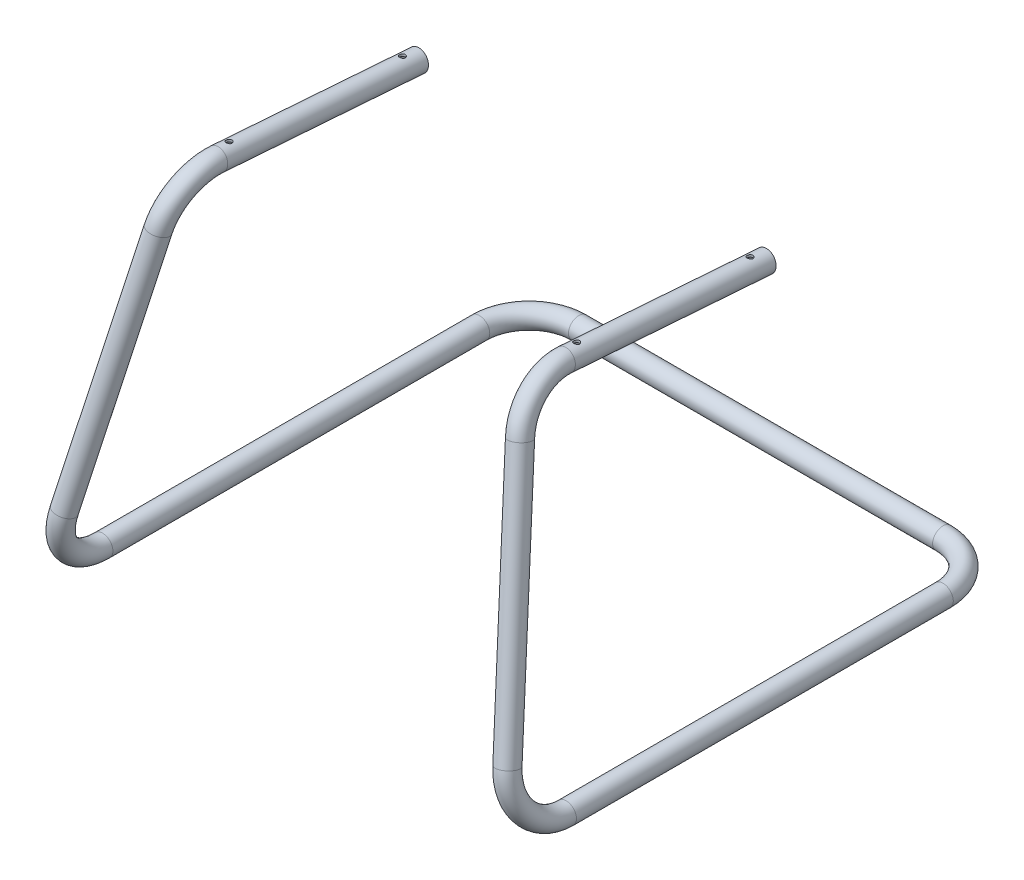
ISO-10303-21;
HEADER;
FILE_DESCRIPTION(('STEP AP214'),'2;1');
FILE_NAME('part.step','',(''),(''),'','','');
FILE_SCHEMA(('AUTOMOTIVE_DESIGN { 1 0 10303 214 1 1 1 1 }'));
ENDSEC;
DATA;
#1=APPLICATION_CONTEXT('core data for automotive mechanical design processes');
#2=APPLICATION_PROTOCOL_DEFINITION('international standard','automotive_design',2000,#1);
#3=PRODUCT_CONTEXT('',#1,'mechanical');
#4=PRODUCT('Part','Part','',(#3));
#5=PRODUCT_RELATED_PRODUCT_CATEGORY('part','',(#4));
#6=PRODUCT_DEFINITION_FORMATION('','',#4);
#7=PRODUCT_DEFINITION_CONTEXT('part definition',#1,'design');
#8=PRODUCT_DEFINITION('design','',#6,#7);
#9=PRODUCT_DEFINITION_SHAPE('','',#8);
#10=(LENGTH_UNIT() NAMED_UNIT(*) SI_UNIT(.MILLI.,.METRE.));
#11=(NAMED_UNIT(*) PLANE_ANGLE_UNIT() SI_UNIT($,.RADIAN.));
#12=(NAMED_UNIT(*) SI_UNIT($,.STERADIAN.) SOLID_ANGLE_UNIT());
#13=UNCERTAINTY_MEASURE_WITH_UNIT(LENGTH_MEASURE(1.E-05),#10,'distance_accuracy_value','');
#14=(GEOMETRIC_REPRESENTATION_CONTEXT(3) GLOBAL_UNCERTAINTY_ASSIGNED_CONTEXT((#13)) GLOBAL_UNIT_ASSIGNED_CONTEXT((#10,
#11,#12)) REPRESENTATION_CONTEXT('',''));
#15=CARTESIAN_POINT('',(0.,0.,0.));
#16=DIRECTION('',(0.,0.,1.));
#17=DIRECTION('',(1.,0.,0.));
#18=AXIS2_PLACEMENT_3D('',#15,#16,#17);
#19=CARTESIAN_POINT('',(0.,-430.,-250.));
#20=DIRECTION('',(-1.,0.,0.));
#21=DIRECTION('',(0.,0.,1.));
#22=AXIS2_PLACEMENT_3D('',#19,#20,#21);
#23=CYLINDRICAL_SURFACE('',#22,12.5);
#24=CARTESIAN_POINT('',(-220.,-430.,-250.));
#25=DIRECTION('',(1.,0.,0.));
#26=DIRECTION('',(0.,0.,-1.));
#27=AXIS2_PLACEMENT_3D('',#24,#25,#26);
#28=CIRCLE('',#27,12.5);
#29=CARTESIAN_POINT('',(-220.,-430.,-262.5));
#30=VERTEX_POINT('',#29);
#31=EDGE_CURVE('E72',#30,#30,#28,.T.);
#32=ORIENTED_EDGE('',*,*,#31,.T.);
#33=EDGE_LOOP('',(#32));
#34=FACE_BOUND('',#33,.T.);
#35=CARTESIAN_POINT('',(220.,-430.,-250.));
#36=DIRECTION('',(1.,0.,0.));
#37=DIRECTION('',(0.,0.,-1.));
#38=AXIS2_PLACEMENT_3D('',#35,#36,#37);
#39=CIRCLE('',#38,12.5);
#40=CARTESIAN_POINT('',(220.,-430.,-262.5));
#41=VERTEX_POINT('',#40);
#42=EDGE_CURVE('E243',#41,#41,#39,.T.);
#43=ORIENTED_EDGE('',*,*,#42,.F.);
#44=EDGE_LOOP('',(#43));
#45=FACE_BOUND('',#44,.T.);
#46=ADVANCED_FACE('F40',(#34,#45),#23,.T.);
#47=CARTESIAN_POINT('',(-220.,-430.,-190.));
#48=DIRECTION('',(0.,1.,0.));
#49=DIRECTION('',(0.,0.,1.));
#50=AXIS2_PLACEMENT_3D('',#47,#48,#49);
#51=TOROIDAL_SURFACE('',#50,60.,12.5);
#52=CARTESIAN_POINT('',(-280.,-430.,-190.));
#53=DIRECTION('',(0.,0.,-1.));
#54=DIRECTION('',(-1.,0.,0.));
#55=AXIS2_PLACEMENT_3D('',#52,#53,#54);
#56=CIRCLE('',#55,12.5);
#57=CARTESIAN_POINT('',(-292.5,-430.,-190.));
#58=VERTEX_POINT('',#57);
#59=EDGE_CURVE('E76',#58,#58,#56,.T.);
#60=CARTESIAN_POINT('',(-220.,-430.,-190.));
#61=DIRECTION('',(0.,1.,0.));
#62=DIRECTION('',(0.,0.,1.));
#63=AXIS2_PLACEMENT_3D('',#60,#61,#62);
#64=CIRCLE('',#63,72.5);
#65=EDGE_CURVE('',#30,#58,#64,.T.);
#66=ORIENTED_EDGE('',*,*,#31,.F.);
#67=ORIENTED_EDGE('',*,*,#59,.T.);
#68=ORIENTED_EDGE('',*,*,#65,.T.);
#69=ORIENTED_EDGE('',*,*,#65,.F.);
#70=EDGE_LOOP('',(#66,#68,#67,#69));
#71=FACE_BOUND('',#70,.T.);
#72=ADVANCED_FACE('F393',(#71),#51,.T.);
#73=CARTESIAN_POINT('',(-280.,-430.,-190.));
#74=DIRECTION('',(0.,0.,1.));
#75=DIRECTION('',(1.,0.,0.));
#76=AXIS2_PLACEMENT_3D('',#73,#74,#75);
#77=CYLINDRICAL_SURFACE('',#76,12.5);
#78=CARTESIAN_POINT('',(-280.,-430.,265.268061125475));
#79=DIRECTION('',(0.,0.,-1.));
#80=DIRECTION('',(-1.,0.,0.));
#81=AXIS2_PLACEMENT_3D('',#78,#79,#80);
#82=CIRCLE('',#81,12.5);
#83=CARTESIAN_POINT('',(-282.111671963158,-442.320342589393,265.268061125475));
#84=VERTEX_POINT('',#83);
#85=EDGE_CURVE('E81',#84,#84,#82,.T.);
#86=ORIENTED_EDGE('',*,*,#85,.T.);
#87=EDGE_LOOP('',(#86));
#88=FACE_BOUND('',#87,.T.);
#89=ORIENTED_EDGE('',*,*,#59,.F.);
#90=EDGE_LOOP('',(#89));
#91=FACE_BOUND('',#90,.T.);
#92=ADVANCED_FACE('F399',(#88,#91),#77,.T.);
#93=CARTESIAN_POINT('',(-269.863974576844,-370.862355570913,265.268061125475));
#94=DIRECTION('',(-0.985627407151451,0.1689337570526,0.));
#95=DIRECTION('',(-0.1689337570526,-0.985627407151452,0.));
#96=AXIS2_PLACEMENT_3D('',#93,#94,#95);
#97=TOROIDAL_SURFACE('',#96,60.,12.5);
#98=CARTESIAN_POINT('',(-267.673564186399,-358.082621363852,323.850315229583));
#99=DIRECTION('',(-0.164942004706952,-0.962337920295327,0.216101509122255));
#100=DIRECTION('',(-0.965294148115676,0.202487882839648,0.164942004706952));
#101=AXIS2_PLACEMENT_3D('',#98,#99,#100);
#102=CIRCLE('',#101,12.5);
#103=CARTESIAN_POINT('',(-267.217228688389,-355.420176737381,336.054951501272));
#104=VERTEX_POINT('',#103);
#105=EDGE_CURVE('E85',#104,#104,#102,.T.);
#106=CARTESIAN_POINT('',(-269.863974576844,-370.862355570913,265.268061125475));
#107=DIRECTION('',(-0.985627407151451,0.1689337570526,0.));
#108=DIRECTION('',(-0.1689337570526,-0.985627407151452,0.));
#109=AXIS2_PLACEMENT_3D('',#106,#107,#108);
#110=CIRCLE('',#109,72.5);
#111=EDGE_CURVE('',#84,#104,#110,.T.);
#112=ORIENTED_EDGE('',*,*,#85,.F.);
#113=ORIENTED_EDGE('',*,*,#105,.T.);
#114=ORIENTED_EDGE('',*,*,#111,.T.);
#115=ORIENTED_EDGE('',*,*,#111,.F.);
#116=EDGE_LOOP('',(#112,#114,#113,#115));
#117=FACE_BOUND('',#116,.T.);
#118=ADVANCED_FACE('F405',(#117),#97,.T.);
#119=CARTESIAN_POINT('',(-267.673564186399,-358.082621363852,323.850315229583));
#120=DIRECTION('',(0.164942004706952,0.962337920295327,-0.216101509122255));
#121=DIRECTION('',(0.,0.219102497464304,0.975701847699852));
#122=AXIS2_PLACEMENT_3D('',#119,#120,#121);
#123=CYLINDRICAL_SURFACE('',#122,12.5);
#124=CARTESIAN_POINT('',(-218.551543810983,-71.4850199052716,259.492283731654));
#125=DIRECTION('',(-0.164942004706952,-0.962337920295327,0.216101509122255));
#126=DIRECTION('',(-0.965294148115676,0.202487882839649,0.164942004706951));
#127=AXIS2_PLACEMENT_3D('',#124,#125,#126);
#128=CIRCLE('',#127,12.5);
#129=CARTESIAN_POINT('',(-218.249305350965,-68.7963777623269,271.695965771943));
#130=VERTEX_POINT('',#129);
#131=EDGE_CURVE('E89',#130,#130,#128,.T.);
#132=ORIENTED_EDGE('',*,*,#131,.T.);
#133=EDGE_LOOP('',(#132));
#134=FACE_BOUND('',#133,.T.);
#135=ORIENTED_EDGE('',*,*,#105,.F.);
#136=EDGE_LOOP('',(#135));
#137=FACE_BOUND('',#136,.T.);
#138=ADVANCED_FACE('F409',(#134,#137),#123,.T.);
#139=CARTESIAN_POINT('',(-220.002288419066,-84.3905021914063,200.914609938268));
#140=DIRECTION('',(-0.986006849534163,0.166257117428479,-0.0122091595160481));
#141=DIRECTION('',(-0.166269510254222,-0.986080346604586,0.));
#142=AXIS2_PLACEMENT_3D('',#139,#140,#141);
#143=TOROIDAL_SURFACE('',#142,60.,12.5);
#144=CARTESIAN_POINT('',(-210.,-25.3889678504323,196.581808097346));
#145=DIRECTION('',(0.,0.0732381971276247,0.997314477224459));
#146=DIRECTION('',(-0.93946200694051,0.341732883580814,-0.0250952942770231));
#147=AXIS2_PLACEMENT_3D('',#144,#145,#146);
#148=CIRCLE('',#147,12.5);
#149=CARTESIAN_POINT('',(-207.916189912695,-13.0969815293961,195.679141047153));
#150=VERTEX_POINT('',#149);
#151=EDGE_CURVE('E71',#150,#150,#148,.T.);
#152=CARTESIAN_POINT('',(-220.002288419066,-84.3905021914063,200.914609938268));
#153=DIRECTION('',(-0.986006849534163,0.166257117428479,-0.0122091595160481));
#154=DIRECTION('',(-0.166269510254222,-0.986080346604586,0.));
#155=AXIS2_PLACEMENT_3D('',#152,#153,#154);
#156=CIRCLE('',#155,72.5);
#157=EDGE_CURVE('',#130,#150,#156,.T.);
#158=ORIENTED_EDGE('',*,*,#131,.F.);
#159=ORIENTED_EDGE('',*,*,#151,.T.);
#160=ORIENTED_EDGE('',*,*,#157,.T.);
#161=ORIENTED_EDGE('',*,*,#157,.F.);
#162=EDGE_LOOP('',(#158,#160,#159,#161));
#163=FACE_BOUND('',#162,.T.);
#164=ADVANCED_FACE('F412',(#163),#143,.T.);
#165=CARTESIAN_POINT('',(-210.,-25.3889678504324,196.581808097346));
#166=DIRECTION('',(0.,-0.0732381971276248,-0.997314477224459));
#167=DIRECTION('',(0.,0.997314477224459,-0.0732381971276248));
#168=AXIS2_PLACEMENT_3D('',#165,#166,#167);
#169=CYLINDRICAL_SURFACE('',#168,12.5);
#170=CARTESIAN_POINT('',(-214.382148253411,-38.4015365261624,179.228497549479));
#171=CARTESIAN_POINT('',(-214.513673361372,-38.3394144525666,179.402188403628));
#172=CARTESIAN_POINT('',(-214.637118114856,-38.2773533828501,179.581945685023));
#173=CARTESIAN_POINT('',(-214.867993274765,-38.1550130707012,179.952039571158));
#174=CARTESIAN_POINT('',(-214.975423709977,-38.0947338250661,180.14237615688));
#175=CARTESIAN_POINT('',(-215.17445001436,-37.9774301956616,180.532495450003));
#176=CARTESIAN_POINT('',(-215.266021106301,-37.9204109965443,180.732292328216));
#177=CARTESIAN_POINT('',(-215.433053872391,-37.8111893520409,181.139665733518));
#178=CARTESIAN_POINT('',(-215.508522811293,-37.7589847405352,181.34723870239));
#179=CARTESIAN_POINT('',(-215.643928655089,-37.6601998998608,181.77096243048));
#180=CARTESIAN_POINT('',(-215.703712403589,-37.6136773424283,181.987175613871));
#181=CARTESIAN_POINT('',(-215.806645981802,-37.5279976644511,182.424962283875));
#182=CARTESIAN_POINT('',(-215.849795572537,-37.4888406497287,182.64653584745));
#183=CARTESIAN_POINT('',(-215.919264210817,-37.4188574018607,183.09340654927));
#184=CARTESIAN_POINT('',(-215.945597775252,-37.3880239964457,183.318700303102));
#185=CARTESIAN_POINT('',(-215.981368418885,-37.3352907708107,183.771662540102));
#186=CARTESIAN_POINT('',(-215.990805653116,-37.313390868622,183.999331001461));
#187=CARTESIAN_POINT('',(-215.992745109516,-37.2786441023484,184.458030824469));
#188=CARTESIAN_POINT('',(-215.985053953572,-37.2659027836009,184.689071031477));
#189=CARTESIAN_POINT('',(-215.952379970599,-37.2498398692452,185.150255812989));
#190=CARTESIAN_POINT('',(-215.927396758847,-37.2465184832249,185.380400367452));
#191=CARTESIAN_POINT('',(-215.860235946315,-37.2488982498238,185.838292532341));
#192=CARTESIAN_POINT('',(-215.818045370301,-37.2546062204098,186.066038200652));
#193=CARTESIAN_POINT('',(-215.716638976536,-37.2743430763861,186.517333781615));
#194=CARTESIAN_POINT('',(-215.65742322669,-37.2883719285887,186.740883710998));
#195=CARTESIAN_POINT('',(-215.522243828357,-37.3237536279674,187.181865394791));
#196=CARTESIAN_POINT('',(-215.446307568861,-37.3450945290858,187.399306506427));
#197=CARTESIAN_POINT('',(-215.277717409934,-37.3939606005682,187.8270025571));
#198=CARTESIAN_POINT('',(-215.185056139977,-37.4214884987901,188.037254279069));
#199=CARTESIAN_POINT('',(-214.983135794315,-37.4814084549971,188.448768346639));
#200=CARTESIAN_POINT('',(-214.873887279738,-37.5137974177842,188.650036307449));
#201=CARTESIAN_POINT('',(-214.638727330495,-37.5820326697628,189.041977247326));
#202=CARTESIAN_POINT('',(-214.512813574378,-37.6178794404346,189.232648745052));
#203=CARTESIAN_POINT('',(-214.166564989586,-37.7128094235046,189.708049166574));
#204=CARTESIAN_POINT('',(-213.933676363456,-37.7733632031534,189.983552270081));
#205=CARTESIAN_POINT('',(-213.426285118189,-37.8926381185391,190.493254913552));
#206=CARTESIAN_POINT('',(-213.151852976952,-37.9513621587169,190.727522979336));
#207=CARTESIAN_POINT('',(-212.626465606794,-38.0478711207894,191.097480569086));
#208=CARTESIAN_POINT('',(-212.383228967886,-38.0874397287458,191.243533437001));
#209=CARTESIAN_POINT('',(-212.002446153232,-38.1396049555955,191.432119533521));
#210=CARTESIAN_POINT('',(-211.872832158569,-38.1557983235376,191.489909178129));
#211=CARTESIAN_POINT('',(-211.608925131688,-38.1853372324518,191.594414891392));
#212=CARTESIAN_POINT('',(-211.474634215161,-38.1986840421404,191.641135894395));
#213=CARTESIAN_POINT('',(-211.201044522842,-38.2222154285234,191.722996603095));
#214=CARTESIAN_POINT('',(-211.061713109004,-38.232372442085,191.758035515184));
#215=CARTESIAN_POINT('',(-210.780273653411,-38.2490191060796,191.815239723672));
#216=CARTESIAN_POINT('',(-210.638167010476,-38.2555105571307,191.837411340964));
#217=CARTESIAN_POINT('',(-210.352412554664,-38.2645964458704,191.868397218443));
#218=CARTESIAN_POINT('',(-210.20876515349,-38.2671918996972,191.877214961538));
#219=CARTESIAN_POINT('',(-209.921271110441,-38.2683914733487,191.88129378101));
#220=CARTESIAN_POINT('',(-209.77742449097,-38.2669960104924,191.87655627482));
#221=CARTESIAN_POINT('',(-209.508649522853,-38.2606842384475,191.855060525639));
#222=CARTESIAN_POINT('',(-209.383583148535,-38.2562250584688,191.839862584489));
#223=CARTESIAN_POINT('',(-209.135207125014,-38.2444154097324,191.79943288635));
#224=CARTESIAN_POINT('',(-209.011898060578,-38.2370640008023,191.774197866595));
#225=CARTESIAN_POINT('',(-208.64591933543,-38.2109525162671,191.684034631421));
#226=CARTESIAN_POINT('',(-208.406970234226,-38.1881292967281,191.604628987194));
#227=CARTESIAN_POINT('',(-207.937431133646,-38.1330609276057,191.408977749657));
#228=CARTESIAN_POINT('',(-207.707320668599,-38.1005488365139,191.291679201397));
#229=CARTESIAN_POINT('',(-207.266366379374,-38.0292621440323,191.026767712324));
#230=CARTESIAN_POINT('',(-207.055535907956,-37.9904832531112,190.879133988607));
#231=CARTESIAN_POINT('',(-206.555260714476,-37.8894440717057,190.479376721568));
#232=CARTESIAN_POINT('',(-206.278616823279,-37.8250687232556,190.211722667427));
#233=CARTESIAN_POINT('',(-205.77279019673,-37.6973998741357,189.634509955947));
#234=CARTESIAN_POINT('',(-205.543694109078,-37.6341085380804,189.324876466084));
#235=CARTESIAN_POINT('',(-205.129311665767,-37.5152795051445,188.668783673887));
#236=CARTESIAN_POINT('',(-204.944839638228,-37.4598925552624,188.321786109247));
#237=CARTESIAN_POINT('',(-204.624724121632,-37.3652608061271,187.603952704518));
#238=CARTESIAN_POINT('',(-204.489067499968,-37.32601166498,187.233123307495));
#239=CARTESIAN_POINT('',(-204.31315668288,-37.2812673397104,186.632740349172));
#240=CARTESIAN_POINT('',(-204.256664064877,-37.2685246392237,186.408327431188));
#241=CARTESIAN_POINT('',(-204.160731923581,-37.2514932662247,185.955500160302));
#242=CARTESIAN_POINT('',(-204.121293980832,-37.2472053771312,185.727085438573));
#243=CARTESIAN_POINT('',(-204.059660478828,-37.2477656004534,185.267957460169));
#244=CARTESIAN_POINT('',(-204.037465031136,-37.2526137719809,185.037244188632));
#245=CARTESIAN_POINT('',(-204.010425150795,-37.2717866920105,184.575198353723));
#246=CARTESIAN_POINT('',(-204.005580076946,-37.2861110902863,184.343865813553));
#247=CARTESIAN_POINT('',(-204.013254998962,-37.3241584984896,183.882978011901));
#248=CARTESIAN_POINT('',(-204.025721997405,-37.3478526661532,183.653419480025));
#249=CARTESIAN_POINT('',(-204.067860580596,-37.4042543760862,183.197003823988));
#250=CARTESIAN_POINT('',(-204.097532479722,-37.4369620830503,182.970146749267));
#251=CARTESIAN_POINT('',(-204.17396589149,-37.5106903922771,182.520558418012));
#252=CARTESIAN_POINT('',(-204.22073805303,-37.5517161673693,182.297829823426));
#253=CARTESIAN_POINT('',(-204.331196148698,-37.6410574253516,181.858108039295));
#254=CARTESIAN_POINT('',(-204.394882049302,-37.6893728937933,181.641114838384));
#255=CARTESIAN_POINT('',(-204.539186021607,-37.7921841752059,181.213721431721));
#256=CARTESIAN_POINT('',(-204.619845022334,-37.846694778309,181.003338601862));
#257=CARTESIAN_POINT('',(-204.797936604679,-37.9604058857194,180.590991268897));
#258=CARTESIAN_POINT('',(-204.89537674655,-38.0196084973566,180.389030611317));
#259=CARTESIAN_POINT('',(-205.106915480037,-38.1410767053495,179.995176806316));
#260=CARTESIAN_POINT('',(-205.221001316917,-38.2033399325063,179.803276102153));
#261=CARTESIAN_POINT('',(-205.465925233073,-38.329261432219,179.430964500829));
#262=CARTESIAN_POINT('',(-205.59676516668,-38.3929198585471,179.250554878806));
#263=CARTESIAN_POINT('',(-205.950352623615,-38.5539741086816,178.809420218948));
#264=CARTESIAN_POINT('',(-206.184686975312,-38.6511031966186,178.557677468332));
#265=CARTESIAN_POINT('',(-206.692981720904,-38.8365770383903,178.094476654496));
#266=CARTESIAN_POINT('',(-206.966874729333,-38.9249363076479,177.882951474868));
#267=CARTESIAN_POINT('',(-207.491422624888,-39.0675572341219,177.549864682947));
#268=CARTESIAN_POINT('',(-207.735029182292,-39.1250874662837,177.418741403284));
#269=CARTESIAN_POINT('',(-208.115410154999,-39.1995848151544,177.251167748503));
#270=CARTESIAN_POINT('',(-208.244730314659,-39.2224548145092,177.20015339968));
#271=CARTESIAN_POINT('',(-208.507700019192,-39.2637195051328,177.108613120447));
#272=CARTESIAN_POINT('',(-208.641347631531,-39.2821161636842,177.068082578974));
#273=CARTESIAN_POINT('',(-208.913188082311,-39.3140685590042,176.997959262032));
#274=CARTESIAN_POINT('',(-209.051408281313,-39.3275853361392,176.968454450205));
#275=CARTESIAN_POINT('',(-209.330235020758,-39.3491733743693,176.921439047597));
#276=CARTESIAN_POINT('',(-209.47084039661,-39.3572472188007,176.903922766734));
#277=CARTESIAN_POINT('',(-209.753242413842,-39.3677029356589,176.881253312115));
#278=CARTESIAN_POINT('',(-209.895038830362,-39.3700858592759,176.876097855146));
#279=CARTESIAN_POINT('',(-210.178470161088,-39.3690967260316,176.878241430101));
#280=CARTESIAN_POINT('',(-210.320105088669,-39.3657251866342,176.885539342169));
#281=CARTESIAN_POINT('',(-210.710401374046,-39.3485227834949,176.922846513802));
#282=CARTESIAN_POINT('',(-210.957673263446,-39.3286455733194,176.9659983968));
#283=CARTESIAN_POINT('',(-211.441113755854,-39.2729700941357,177.088127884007));
#284=CARTESIAN_POINT('',(-211.677279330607,-39.2371675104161,177.167115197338));
#285=CARTESIAN_POINT('',(-212.143887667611,-39.1507880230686,177.360615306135));
#286=CARTESIAN_POINT('',(-212.373644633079,-39.0996406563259,177.476513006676));
#287=CARTESIAN_POINT('',(-212.813219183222,-38.9870280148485,177.737174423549));
#288=CARTESIAN_POINT('',(-213.023031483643,-38.9255600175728,177.881945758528));
#289=CARTESIAN_POINT('',(-213.441456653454,-38.7894426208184,178.211280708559));
#290=CARTESIAN_POINT('',(-213.647829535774,-38.7140893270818,178.398381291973));
#291=CARTESIAN_POINT('',(-214.034554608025,-38.5596386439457,178.79653716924));
#292=CARTESIAN_POINT('',(-214.214885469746,-38.4805382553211,179.007611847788));
#293=CARTESIAN_POINT('',(-214.382148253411,-38.4015365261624,179.228497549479));
#294=B_SPLINE_CURVE_WITH_KNOTS('',3,(#170,#171,#172,#173,#174,#175,#176,#177,#178,#179,#180,
#181,#182,#183,#184,#185,#186,#187,#188,#189,#190,#191,#192,#193,#194,#195,#196,#197,#198,#199,
#200,#201,#202,#203,#204,#205,#206,#207,#208,#209,#210,#211,#212,#213,#214,#215,#216,#217,#218,
#219,#220,#221,#222,#223,#224,#225,#226,#227,#228,#229,#230,#231,#232,#233,#234,#235,#236,#237,
#238,#239,#240,#241,#242,#243,#244,#245,#246,#247,#248,#249,#250,#251,#252,#253,#254,#255,#256,
#257,#258,#259,#260,#261,#262,#263,#264,#265,#266,#267,#268,#269,#270,#271,#272,#273,#274,#275,
#276,#277,#278,#279,#280,#281,#282,#283,#284,#285,#286,#287,#288,#289,#290,#291,#292,#293),
.UNSPECIFIED.,.T.,.F.,(4,2,2,2,2,2,2,2,2,2,2,2,2,2,2,2,2,2,2,2,2,2,2,2,2,2,2,2,2,2,2,2,2,2,2,2,
2,2,2,2,2,2,2,2,2,2,2,2,2,2,2,2,2,2,2,2,2,2,2,2,2,4),(0.,0.679363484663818,1.35872574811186,
2.03913999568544,2.71924661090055,3.40576575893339,4.09229476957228,4.77823031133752,
5.46415955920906,6.1578721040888,6.85160008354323,7.54585213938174,8.24010142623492,
8.93322184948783,9.62664847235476,10.3196354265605,11.012719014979,12.1058047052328,
13.197056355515,14.0527618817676,14.4808122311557,14.9086713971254,15.3401319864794,
15.7713804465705,16.202516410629,16.6336072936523,17.0113446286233,17.3892048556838,
18.1442474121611,18.9223943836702,19.7010762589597,20.8655414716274,22.0321104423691,
23.2185868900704,24.4047439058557,25.099330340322,25.7939811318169,26.4886364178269,
27.1832660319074,27.8757738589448,28.5682943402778,29.2612468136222,29.9541979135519,
30.6488395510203,31.3437949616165,32.0382206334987,32.7327232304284,33.8007064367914,
34.8668914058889,35.7109323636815,36.1331461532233,36.5551739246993,36.9805001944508,
37.4056244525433,37.8306701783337,38.2556776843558,39.0072680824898,39.7590622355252,
40.5432713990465,41.3276877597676,42.1909431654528,43.0549016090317),.UNSPECIFIED.);
#295=CARTESIAN_POINT('',(-214.382148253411,-38.4015365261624,179.228497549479));
#296=VERTEX_POINT('',#295);
#297=EDGE_CURVE('E105',#296,#296,#294,.T.);
#298=ORIENTED_EDGE('',*,*,#297,.T.);
#299=EDGE_LOOP('',(#298));
#300=FACE_BOUND('',#299,.T.);
#301=CARTESIAN_POINT('',(-210.,-13.6295959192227,186.038018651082));
#302=CARTESIAN_POINT('',(-210.192581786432,-13.6295986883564,186.038015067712));
#303=CARTESIAN_POINT('',(-210.38520284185,-13.635245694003,186.02244276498));
#304=CARTESIAN_POINT('',(-210.764872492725,-13.6573091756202,185.960665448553));
#305=CARTESIAN_POINT('',(-210.951918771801,-13.6737300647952,185.914447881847));
#306=CARTESIAN_POINT('',(-211.314905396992,-13.7157924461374,185.792946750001));
#307=CARTESIAN_POINT('',(-211.490860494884,-13.7414213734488,185.71770278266));
#308=CARTESIAN_POINT('',(-211.827374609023,-13.7996289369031,185.540327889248));
#309=CARTESIAN_POINT('',(-211.987932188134,-13.8322082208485,185.438194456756));
#310=CARTESIAN_POINT('',(-212.293162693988,-13.9023302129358,185.207066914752));
#311=CARTESIAN_POINT('',(-212.437389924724,-13.9399691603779,185.077513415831));
#312=CARTESIAN_POINT('',(-212.701983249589,-14.0163525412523,184.79622787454));
#313=CARTESIAN_POINT('',(-212.822345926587,-14.0550971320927,184.644492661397));
#314=CARTESIAN_POINT('',(-213.038032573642,-14.1310979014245,184.319391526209));
#315=CARTESIAN_POINT('',(-213.132831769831,-14.1683112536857,184.145666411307));
#316=CARTESIAN_POINT('',(-213.291315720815,-14.2371541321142,183.783532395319));
#317=CARTESIAN_POINT('',(-213.355006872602,-14.2687848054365,183.5951265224));
#318=CARTESIAN_POINT('',(-213.447895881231,-14.3231308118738,183.213777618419));
#319=CARTESIAN_POINT('',(-213.477907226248,-14.3460471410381,183.021061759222));
#320=CARTESIAN_POINT('',(-213.505122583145,-14.3825202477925,182.632471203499));
#321=CARTESIAN_POINT('',(-213.502333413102,-14.3960789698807,182.436597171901));
#322=CARTESIAN_POINT('',(-213.464670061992,-14.4132421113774,182.053702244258));
#323=CARTESIAN_POINT('',(-213.43079335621,-14.4171421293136,181.866595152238));
#324=CARTESIAN_POINT('',(-213.333519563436,-14.4166344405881,181.50024274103));
#325=CARTESIAN_POINT('',(-213.270119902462,-14.4122260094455,181.320998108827));
#326=CARTESIAN_POINT('',(-213.114817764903,-14.3966417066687,180.973018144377));
#327=CARTESIAN_POINT('',(-213.022575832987,-14.3853836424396,180.804438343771));
#328=CARTESIAN_POINT('',(-212.812443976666,-14.35830702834,180.484500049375));
#329=CARTESIAN_POINT('',(-212.69454854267,-14.342487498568,180.333145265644));
#330=CARTESIAN_POINT('',(-212.431412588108,-14.3082255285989,180.04636388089));
#331=CARTESIAN_POINT('',(-212.285338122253,-14.2897089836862,179.911710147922));
#332=CARTESIAN_POINT('',(-211.972619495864,-14.253357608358,179.668739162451));
#333=CARTESIAN_POINT('',(-211.805974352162,-14.2355228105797,179.560423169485));
#334=CARTESIAN_POINT('',(-211.455562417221,-14.2030462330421,179.372957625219));
#335=CARTESIAN_POINT('',(-211.271711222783,-14.1884215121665,179.293962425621));
#336=CARTESIAN_POINT('',(-210.8928503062,-14.1646097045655,179.168699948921));
#337=CARTESIAN_POINT('',(-210.697843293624,-14.1554213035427,179.122424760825));
#338=CARTESIAN_POINT('',(-210.308820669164,-14.1439969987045,179.065258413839));
#339=CARTESIAN_POINT('',(-210.114968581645,-14.1415505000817,179.053294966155));
#340=CARTESIAN_POINT('',(-209.728058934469,-14.1433386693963,179.062131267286));
#341=CARTESIAN_POINT('',(-209.535001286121,-14.1475725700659,179.082927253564));
#342=CARTESIAN_POINT('',(-209.159006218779,-14.1619962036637,179.155785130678));
#343=CARTESIAN_POINT('',(-208.975945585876,-14.1720698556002,179.207238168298));
#344=CARTESIAN_POINT('',(-208.620933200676,-14.1967562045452,179.339159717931));
#345=CARTESIAN_POINT('',(-208.448982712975,-14.2113694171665,179.419631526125));
#346=CARTESIAN_POINT('',(-208.117059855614,-14.2435581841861,179.609108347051));
#347=CARTESIAN_POINT('',(-207.957415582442,-14.2611895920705,179.718678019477));
#348=CARTESIAN_POINT('',(-207.658147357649,-14.2967439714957,179.962385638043));
#349=CARTESIAN_POINT('',(-207.518527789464,-14.3146670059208,180.096528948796));
#350=CARTESIAN_POINT('',(-207.258751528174,-14.3486823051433,180.390405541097));
#351=CARTESIAN_POINT('',(-207.139341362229,-14.3646996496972,180.550808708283));
#352=CARTESIAN_POINT('',(-206.928833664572,-14.3913674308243,180.88964962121));
#353=CARTESIAN_POINT('',(-206.837735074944,-14.4020180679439,181.06808669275));
#354=CARTESIAN_POINT('',(-206.687110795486,-14.4154276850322,181.436976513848));
#355=CARTESIAN_POINT('',(-206.62741186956,-14.4182303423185,181.6273567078));
#356=CARTESIAN_POINT('',(-206.540928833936,-14.4143690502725,182.015346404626));
#357=CARTESIAN_POINT('',(-206.51413524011,-14.4077078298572,182.212953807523));
#358=CARTESIAN_POINT('',(-206.494808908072,-14.384779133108,182.602058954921));
#359=CARTESIAN_POINT('',(-206.501070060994,-14.3688684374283,182.793518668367));
#360=CARTESIAN_POINT('',(-206.544846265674,-14.3283729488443,183.171878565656));
#361=CARTESIAN_POINT('',(-206.582360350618,-14.3037884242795,183.358778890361));
#362=CARTESIAN_POINT('',(-206.686846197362,-14.2478977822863,183.721109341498));
#363=CARTESIAN_POINT('',(-206.753537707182,-14.2166570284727,183.896630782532));
#364=CARTESIAN_POINT('',(-206.914268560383,-14.1497069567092,184.233741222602));
#365=CARTESIAN_POINT('',(-207.008312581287,-14.1139968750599,184.395327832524));
#366=CARTESIAN_POINT('',(-207.224629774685,-14.0397505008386,184.705739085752));
#367=CARTESIAN_POINT('',(-207.347714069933,-14.0011602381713,184.853985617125));
#368=CARTESIAN_POINT('',(-207.617107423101,-13.9254889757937,185.128127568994));
#369=CARTESIAN_POINT('',(-207.763422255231,-13.8884083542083,185.254017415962));
#370=CARTESIAN_POINT('',(-208.07941394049,-13.8181107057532,185.483060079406));
#371=CARTESIAN_POINT('',(-208.249572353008,-13.7850095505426,185.585585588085));
#372=CARTESIAN_POINT('',(-208.605784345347,-13.7268565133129,185.760894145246));
#373=CARTESIAN_POINT('',(-208.791828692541,-13.7017999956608,185.833694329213));
#374=CARTESIAN_POINT('',(-209.147369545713,-13.6649477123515,185.939240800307));
#375=CARTESIAN_POINT('',(-209.315486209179,-13.6517778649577,185.976195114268));
#376=CARTESIAN_POINT('',(-209.655725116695,-13.6341012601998,186.025584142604));
#377=CARTESIAN_POINT('',(-209.827846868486,-13.6295934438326,186.038021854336));
#378=CARTESIAN_POINT('',(-210.,-13.6295959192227,186.038018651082));
#379=B_SPLINE_CURVE_WITH_KNOTS('',3,(#301,#302,#303,#304,#305,#306,#307,#308,#309,#310,#311,
#312,#313,#314,#315,#316,#317,#318,#319,#320,#321,#322,#323,#324,#325,#326,#327,#328,#329,#330,
#331,#332,#333,#334,#335,#336,#337,#338,#339,#340,#341,#342,#343,#344,#345,#346,#347,#348,#349,
#350,#351,#352,#353,#354,#355,#356,#357,#358,#359,#360,#361,#362,#363,#364,#365,#366,#367,#368,
#369,#370,#371,#372,#373,#374,#375,#376,#377,#378),.UNSPECIFIED.,.T.,.F.,(4,2,2,2,2,2,2,2,2,2,2,
2,2,2,2,2,2,2,2,2,2,2,2,2,2,2,2,2,2,2,2,2,2,2,2,2,2,2,4),(0.,0.577113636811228,1.15446381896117,
1.73102914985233,2.30764824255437,2.89741578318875,3.4872677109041,4.08843803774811,
4.68948468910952,5.27567856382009,5.86175059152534,6.42965148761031,6.99760190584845,
7.57250570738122,8.14753310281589,8.74333212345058,9.33915963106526,9.93808066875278,
10.5368568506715,11.116705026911,11.6964866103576,12.2651204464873,12.8338188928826,
13.4144814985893,13.9952710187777,14.5942506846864,15.1932079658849,15.7888251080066,
16.3842705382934,16.9581428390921,17.5319973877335,18.1004570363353,18.6690139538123,
19.2558694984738,19.8428711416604,20.4441463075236,21.0450743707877,21.5610321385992,
22.0769268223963),.UNSPECIFIED.);
#380=CARTESIAN_POINT('',(-210.,-13.6295959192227,186.038018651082));
#381=VERTEX_POINT('',#380);
#382=EDGE_CURVE('E440',#381,#381,#379,.T.);
#383=ORIENTED_EDGE('',*,*,#382,.T.);
#384=EDGE_LOOP('',(#383));
#385=FACE_BOUND('',#384,.T.);
#386=CARTESIAN_POINT('',(-214.382148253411,-53.7815579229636,-30.2075426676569));
#387=CARTESIAN_POINT('',(-214.513673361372,-53.7194358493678,-30.0338518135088));
#388=CARTESIAN_POINT('',(-214.637118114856,-53.6573747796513,-29.8540945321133));
#389=CARTESIAN_POINT('',(-214.867993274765,-53.5350344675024,-29.4840006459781));
#390=CARTESIAN_POINT('',(-214.975423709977,-53.4747552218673,-29.2936640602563));
#391=CARTESIAN_POINT('',(-215.17445001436,-53.3574515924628,-28.9035447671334));
#392=CARTESIAN_POINT('',(-215.266021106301,-53.3004323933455,-28.7037478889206));
#393=CARTESIAN_POINT('',(-215.433053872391,-53.1912107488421,-28.2963744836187));
#394=CARTESIAN_POINT('',(-215.508522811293,-53.1390061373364,-28.0888015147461));
#395=CARTESIAN_POINT('',(-215.643928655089,-53.040221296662,-27.6650777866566));
#396=CARTESIAN_POINT('',(-215.703712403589,-52.9936987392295,-27.4488646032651));
#397=CARTESIAN_POINT('',(-215.806645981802,-52.9080190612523,-27.0110779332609));
#398=CARTESIAN_POINT('',(-215.849795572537,-52.8688620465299,-26.7895043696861));
#399=CARTESIAN_POINT('',(-215.919264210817,-52.798878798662,-26.342633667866));
#400=CARTESIAN_POINT('',(-215.945597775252,-52.7680453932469,-26.1173399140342));
#401=CARTESIAN_POINT('',(-215.981368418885,-52.7153121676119,-25.6643776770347));
#402=CARTESIAN_POINT('',(-215.990805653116,-52.6934122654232,-25.4367092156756));
#403=CARTESIAN_POINT('',(-215.992745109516,-52.6586654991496,-24.9780093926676));
#404=CARTESIAN_POINT('',(-215.985053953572,-52.6459241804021,-24.7469691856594));
#405=CARTESIAN_POINT('',(-215.952379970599,-52.6298612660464,-24.2857844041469));
#406=CARTESIAN_POINT('',(-215.927396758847,-52.6265398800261,-24.0556398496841));
#407=CARTESIAN_POINT('',(-215.860235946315,-52.628919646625,-23.5977476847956));
#408=CARTESIAN_POINT('',(-215.818045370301,-52.634627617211,-23.3700020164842));
#409=CARTESIAN_POINT('',(-215.716638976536,-52.6543644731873,-22.9187064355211));
#410=CARTESIAN_POINT('',(-215.65742322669,-52.6683933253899,-22.6951565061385));
#411=CARTESIAN_POINT('',(-215.522243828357,-52.7037750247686,-22.2541748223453));
#412=CARTESIAN_POINT('',(-215.446307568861,-52.725115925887,-22.0367337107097));
#413=CARTESIAN_POINT('',(-215.277717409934,-52.7739819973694,-21.6090376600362));
#414=CARTESIAN_POINT('',(-215.185056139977,-52.8015098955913,-21.3987859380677));
#415=CARTESIAN_POINT('',(-214.983135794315,-52.8614298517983,-20.9872718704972));
#416=CARTESIAN_POINT('',(-214.873887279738,-52.8938188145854,-20.7860039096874));
#417=CARTESIAN_POINT('',(-214.638727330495,-52.9620540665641,-20.3940629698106));
#418=CARTESIAN_POINT('',(-214.512813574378,-52.9979008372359,-20.2033914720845));
#419=CARTESIAN_POINT('',(-214.166564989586,-53.0928308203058,-19.7279910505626));
#420=CARTESIAN_POINT('',(-213.933676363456,-53.1533845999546,-19.4524879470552));
#421=CARTESIAN_POINT('',(-213.426285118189,-53.2726595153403,-18.942785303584));
#422=CARTESIAN_POINT('',(-213.151852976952,-53.3313835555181,-18.7085172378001));
#423=CARTESIAN_POINT('',(-212.626465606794,-53.4278925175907,-18.3385596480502));
#424=CARTESIAN_POINT('',(-212.383228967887,-53.467461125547,-18.1925067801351));
#425=CARTESIAN_POINT('',(-212.002446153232,-53.5196263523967,-18.0039206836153));
#426=CARTESIAN_POINT('',(-211.872832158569,-53.5358197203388,-17.9461310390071));
#427=CARTESIAN_POINT('',(-211.608925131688,-53.565358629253,-17.8416253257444));
#428=CARTESIAN_POINT('',(-211.474634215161,-53.5787054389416,-17.7949043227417));
#429=CARTESIAN_POINT('',(-211.201044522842,-53.6022368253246,-17.7130436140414));
#430=CARTESIAN_POINT('',(-211.061713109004,-53.6123938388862,-17.6780047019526));
#431=CARTESIAN_POINT('',(-210.780273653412,-53.6290405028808,-17.6208004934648));
#432=CARTESIAN_POINT('',(-210.638167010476,-53.635531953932,-17.5986288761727));
#433=CARTESIAN_POINT('',(-210.352412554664,-53.6446178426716,-17.5676429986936));
#434=CARTESIAN_POINT('',(-210.20876515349,-53.6472132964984,-17.5588252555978));
#435=CARTESIAN_POINT('',(-209.921271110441,-53.6484128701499,-17.5547464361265));
#436=CARTESIAN_POINT('',(-209.77742449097,-53.6470174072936,-17.5594839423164));
#437=CARTESIAN_POINT('',(-209.508649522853,-53.6407056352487,-17.5809796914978));
#438=CARTESIAN_POINT('',(-209.383583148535,-53.63624645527,-17.5961776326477));
#439=CARTESIAN_POINT('',(-209.135207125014,-53.6244368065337,-17.636607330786));
#440=CARTESIAN_POINT('',(-209.011898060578,-53.6170853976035,-17.6618423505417));
#441=CARTESIAN_POINT('',(-208.64591933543,-53.5909739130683,-17.7520055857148));
#442=CARTESIAN_POINT('',(-208.406970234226,-53.5681506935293,-17.8314112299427));
#443=CARTESIAN_POINT('',(-207.937431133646,-53.5130823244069,-18.0270624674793));
#444=CARTESIAN_POINT('',(-207.707320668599,-53.4805702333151,-18.1443610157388));
#445=CARTESIAN_POINT('',(-207.266366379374,-53.4092835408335,-18.4092725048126));
#446=CARTESIAN_POINT('',(-207.055535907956,-53.3705046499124,-18.5569062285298));
#447=CARTESIAN_POINT('',(-206.555260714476,-53.2694654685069,-18.9566634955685));
#448=CARTESIAN_POINT('',(-206.278616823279,-53.2050901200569,-19.224317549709));
#449=CARTESIAN_POINT('',(-205.77279019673,-53.077421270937,-19.801530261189));
#450=CARTESIAN_POINT('',(-205.543694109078,-53.0141299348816,-20.1111637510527));
#451=CARTESIAN_POINT('',(-205.129311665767,-52.8953009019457,-20.7672565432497));
#452=CARTESIAN_POINT('',(-204.944839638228,-52.8399139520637,-21.1142541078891));
#453=CARTESIAN_POINT('',(-204.624724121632,-52.7452822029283,-21.8320875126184));
#454=CARTESIAN_POINT('',(-204.489067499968,-52.7060330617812,-22.2029169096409));
#455=CARTESIAN_POINT('',(-204.31315668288,-52.6612887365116,-22.803299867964));
#456=CARTESIAN_POINT('',(-204.256664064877,-52.6485460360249,-23.0277127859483));
#457=CARTESIAN_POINT('',(-204.160731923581,-52.6315146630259,-23.4805400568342));
#458=CARTESIAN_POINT('',(-204.121293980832,-52.6272267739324,-23.7089547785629));
#459=CARTESIAN_POINT('',(-204.059660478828,-52.6277869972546,-24.1680827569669));
#460=CARTESIAN_POINT('',(-204.037465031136,-52.6326351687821,-24.3987960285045));
#461=CARTESIAN_POINT('',(-204.010425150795,-52.6518080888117,-24.8608418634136));
#462=CARTESIAN_POINT('',(-204.005580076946,-52.6661324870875,-25.0921744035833));
#463=CARTESIAN_POINT('',(-204.013254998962,-52.7041798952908,-25.5530622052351));
#464=CARTESIAN_POINT('',(-204.025721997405,-52.7278740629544,-25.7826207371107));
#465=CARTESIAN_POINT('',(-204.067860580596,-52.7842757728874,-26.2390363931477));
#466=CARTESIAN_POINT('',(-204.097532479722,-52.8169834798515,-26.4658934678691));
#467=CARTESIAN_POINT('',(-204.17396589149,-52.8907117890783,-26.9154817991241));
#468=CARTESIAN_POINT('',(-204.22073805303,-52.9317375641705,-27.1382103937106));
#469=CARTESIAN_POINT('',(-204.331196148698,-53.0210788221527,-27.5779321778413));
#470=CARTESIAN_POINT('',(-204.394882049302,-53.0693942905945,-27.794925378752));
#471=CARTESIAN_POINT('',(-204.539186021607,-53.1722055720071,-28.222318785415));
#472=CARTESIAN_POINT('',(-204.619845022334,-53.2267161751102,-28.432701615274));
#473=CARTESIAN_POINT('',(-204.797936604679,-53.3404272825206,-28.8450489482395));
#474=CARTESIAN_POINT('',(-204.89537674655,-53.3996298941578,-29.0470096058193));
#475=CARTESIAN_POINT('',(-205.106915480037,-53.5210981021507,-29.4408634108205));
#476=CARTESIAN_POINT('',(-205.221001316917,-53.5833613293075,-29.6327641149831));
#477=CARTESIAN_POINT('',(-205.465925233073,-53.7092828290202,-30.0050757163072));
#478=CARTESIAN_POINT('',(-205.59676516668,-53.7729412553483,-30.1854853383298));
#479=CARTESIAN_POINT('',(-205.950352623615,-53.9339955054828,-30.6266199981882));
#480=CARTESIAN_POINT('',(-206.184686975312,-54.0311245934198,-30.8783627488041));
#481=CARTESIAN_POINT('',(-206.692981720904,-54.2165984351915,-31.3415635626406));
#482=CARTESIAN_POINT('',(-206.966874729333,-54.3049577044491,-31.5530887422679));
#483=CARTESIAN_POINT('',(-207.491422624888,-54.4475786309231,-31.8861755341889));
#484=CARTESIAN_POINT('',(-207.735029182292,-54.5051088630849,-32.0172988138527));
#485=CARTESIAN_POINT('',(-208.115410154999,-54.5796062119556,-32.184872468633));
#486=CARTESIAN_POINT('',(-208.244730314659,-54.6024762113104,-32.2358868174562));
#487=CARTESIAN_POINT('',(-208.507700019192,-54.643740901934,-32.3274270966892));
#488=CARTESIAN_POINT('',(-208.641347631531,-54.6621375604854,-32.367957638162));
#489=CARTESIAN_POINT('',(-208.913188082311,-54.6940899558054,-32.4380809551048));
#490=CARTESIAN_POINT('',(-209.051408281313,-54.7076067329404,-32.4675857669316));
#491=CARTESIAN_POINT('',(-209.330235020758,-54.7291947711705,-32.514601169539));
#492=CARTESIAN_POINT('',(-209.47084039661,-54.737268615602,-32.532117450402));
#493=CARTESIAN_POINT('',(-209.753242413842,-54.7477243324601,-32.5547869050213));
#494=CARTESIAN_POINT('',(-209.895038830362,-54.7501072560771,-32.5599423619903));
#495=CARTESIAN_POINT('',(-210.178470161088,-54.7491181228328,-32.5577987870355));
#496=CARTESIAN_POINT('',(-210.320105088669,-54.7457465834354,-32.5505008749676));
#497=CARTESIAN_POINT('',(-210.710401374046,-54.7285441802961,-32.5131937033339));
#498=CARTESIAN_POINT('',(-210.957673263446,-54.7086669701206,-32.4700418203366));
#499=CARTESIAN_POINT('',(-211.441113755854,-54.6529914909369,-32.3479123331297));
#500=CARTESIAN_POINT('',(-211.677279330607,-54.6171889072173,-32.2689250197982));
#501=CARTESIAN_POINT('',(-212.143887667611,-54.5308094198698,-32.0754249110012));
#502=CARTESIAN_POINT('',(-212.373644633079,-54.4796620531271,-31.9595272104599));
#503=CARTESIAN_POINT('',(-212.813219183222,-54.3670494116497,-31.6988657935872));
#504=CARTESIAN_POINT('',(-213.023031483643,-54.305581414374,-31.5540944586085));
#505=CARTESIAN_POINT('',(-213.441456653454,-54.1694640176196,-31.2247595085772));
#506=CARTESIAN_POINT('',(-213.647829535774,-54.0941107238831,-31.037658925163));
#507=CARTESIAN_POINT('',(-214.034554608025,-53.9396600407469,-30.6395030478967));
#508=CARTESIAN_POINT('',(-214.214885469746,-53.8605596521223,-30.4284283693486));
#509=CARTESIAN_POINT('',(-214.382148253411,-53.7815579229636,-30.2075426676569));
#510=B_SPLINE_CURVE_WITH_KNOTS('',3,(#386,#387,#388,#389,#390,#391,#392,#393,#394,#395,#396,
#397,#398,#399,#400,#401,#402,#403,#404,#405,#406,#407,#408,#409,#410,#411,#412,#413,#414,#415,
#416,#417,#418,#419,#420,#421,#422,#423,#424,#425,#426,#427,#428,#429,#430,#431,#432,#433,#434,
#435,#436,#437,#438,#439,#440,#441,#442,#443,#444,#445,#446,#447,#448,#449,#450,#451,#452,#453,
#454,#455,#456,#457,#458,#459,#460,#461,#462,#463,#464,#465,#466,#467,#468,#469,#470,#471,#472,
#473,#474,#475,#476,#477,#478,#479,#480,#481,#482,#483,#484,#485,#486,#487,#488,#489,#490,#491,
#492,#493,#494,#495,#496,#497,#498,#499,#500,#501,#502,#503,#504,#505,#506,#507,#508,#509),
.UNSPECIFIED.,.T.,.F.,(4,2,2,2,2,2,2,2,2,2,2,2,2,2,2,2,2,2,2,2,2,2,2,2,2,2,2,2,2,2,2,2,2,2,2,2,
2,2,2,2,2,2,2,2,2,2,2,2,2,2,2,2,2,2,2,2,2,2,2,2,2,4),(0.,0.679363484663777,1.35872574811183,
2.03913999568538,2.71924661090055,3.40576575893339,4.09229476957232,4.77823031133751,
5.46415955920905,6.15787210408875,6.85160008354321,7.54585213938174,8.24010142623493,
8.93322184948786,9.62664847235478,10.3196354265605,11.012719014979,12.1058047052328,
13.197056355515,14.0527618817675,14.4808122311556,14.9086713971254,15.3401319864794,
15.7713804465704,16.202516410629,16.6336072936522,17.0113446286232,17.3892048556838,
18.1442474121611,18.9223943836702,19.7010762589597,20.8655414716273,22.032110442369,
23.2185868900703,24.4047439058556,25.0993303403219,25.7939811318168,26.4886364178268,
27.1832660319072,27.8757738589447,28.5682943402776,29.261246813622,29.9541979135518,
30.6488395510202,31.3437949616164,32.0382206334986,32.7327232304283,33.8007064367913,
34.8668914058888,35.7109323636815,36.1331461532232,36.5551739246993,36.9805001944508,
37.4056244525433,37.8306701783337,38.2556776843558,39.0072680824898,39.7590622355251,
40.5432713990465,41.3276877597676,42.1909431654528,43.0549016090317),.UNSPECIFIED.);
#511=CARTESIAN_POINT('',(-214.382148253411,-53.7815579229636,-30.2075426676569));
#512=VERTEX_POINT('',#511);
#513=EDGE_CURVE('E77',#512,#512,#510,.T.);
#514=ORIENTED_EDGE('',*,*,#513,.T.);
#515=EDGE_LOOP('',(#514));
#516=FACE_BOUND('',#515,.T.);
#517=CARTESIAN_POINT('',(-210.,-29.0096173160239,-23.3980215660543));
#518=CARTESIAN_POINT('',(-210.192581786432,-29.0096200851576,-23.3980251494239));
#519=CARTESIAN_POINT('',(-210.38520284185,-29.0152670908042,-23.4135974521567));
#520=CARTESIAN_POINT('',(-210.764872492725,-29.0373305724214,-23.4753747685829));
#521=CARTESIAN_POINT('',(-210.951918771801,-29.0537514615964,-23.5215923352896));
#522=CARTESIAN_POINT('',(-211.314905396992,-29.0958138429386,-23.6430934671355));
#523=CARTESIAN_POINT('',(-211.490860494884,-29.12144277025,-23.7183374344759));
#524=CARTESIAN_POINT('',(-211.827374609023,-29.1796503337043,-23.8957123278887));
#525=CARTESIAN_POINT('',(-211.987932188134,-29.2122296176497,-23.9978457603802));
#526=CARTESIAN_POINT('',(-212.293162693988,-29.282351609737,-24.2289733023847));
#527=CARTESIAN_POINT('',(-212.437389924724,-29.3199905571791,-24.3585268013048));
#528=CARTESIAN_POINT('',(-212.701983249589,-29.3963739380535,-24.639812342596));
#529=CARTESIAN_POINT('',(-212.822345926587,-29.435118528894,-24.7915475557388));
#530=CARTESIAN_POINT('',(-213.038032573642,-29.5111192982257,-25.1166486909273));
#531=CARTESIAN_POINT('',(-213.132831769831,-29.5483326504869,-25.290373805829));
#532=CARTESIAN_POINT('',(-213.291315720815,-29.6171755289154,-25.652507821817));
#533=CARTESIAN_POINT('',(-213.355006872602,-29.6488062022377,-25.8409136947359));
#534=CARTESIAN_POINT('',(-213.447895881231,-29.703152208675,-26.2222625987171));
#535=CARTESIAN_POINT('',(-213.477907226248,-29.7260685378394,-26.4149784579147));
#536=CARTESIAN_POINT('',(-213.505122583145,-29.7625416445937,-26.8035690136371));
#537=CARTESIAN_POINT('',(-213.502333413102,-29.7761003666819,-26.9994430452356));
#538=CARTESIAN_POINT('',(-213.464670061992,-29.7932635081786,-27.3823379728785));
#539=CARTESIAN_POINT('',(-213.43079335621,-29.7971635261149,-27.5694450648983));
#540=CARTESIAN_POINT('',(-213.333519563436,-29.7966558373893,-27.9357974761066));
#541=CARTESIAN_POINT('',(-213.270119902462,-29.7922474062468,-28.1150421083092));
#542=CARTESIAN_POINT('',(-213.114817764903,-29.7766631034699,-28.4630220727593));
#543=CARTESIAN_POINT('',(-213.022575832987,-29.7654050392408,-28.6316018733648));
#544=CARTESIAN_POINT('',(-212.812443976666,-29.7383284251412,-28.9515401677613));
#545=CARTESIAN_POINT('',(-212.69454854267,-29.7225088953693,-29.1028949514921));
#546=CARTESIAN_POINT('',(-212.431412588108,-29.6882469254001,-29.3896763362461));
#547=CARTESIAN_POINT('',(-212.285338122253,-29.6697303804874,-29.5243300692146));
#548=CARTESIAN_POINT('',(-211.972619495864,-29.6333790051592,-29.767301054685));
#549=CARTESIAN_POINT('',(-211.805974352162,-29.6155442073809,-29.8756170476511));
#550=CARTESIAN_POINT('',(-211.455562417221,-29.5830676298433,-30.0630825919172));
#551=CARTESIAN_POINT('',(-211.271711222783,-29.5684429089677,-30.1420777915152));
#552=CARTESIAN_POINT('',(-210.8928503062,-29.5446311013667,-30.2673402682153));
#553=CARTESIAN_POINT('',(-210.697843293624,-29.535442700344,-30.3136154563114));
#554=CARTESIAN_POINT('',(-210.308820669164,-29.5240183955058,-30.3707818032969));
#555=CARTESIAN_POINT('',(-210.114968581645,-29.5215718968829,-30.3827452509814));
#556=CARTESIAN_POINT('',(-209.728058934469,-29.5233600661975,-30.3739089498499));
#557=CARTESIAN_POINT('',(-209.535001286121,-29.5275939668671,-30.3531129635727));
#558=CARTESIAN_POINT('',(-209.159006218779,-29.5420176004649,-30.280255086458));
#559=CARTESIAN_POINT('',(-208.975945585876,-29.5520912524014,-30.2288020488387));
#560=CARTESIAN_POINT('',(-208.620933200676,-29.5767776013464,-30.0968804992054));
#561=CARTESIAN_POINT('',(-208.448982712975,-29.5913908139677,-30.0164086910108));
#562=CARTESIAN_POINT('',(-208.117059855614,-29.6235795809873,-29.8269318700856));
#563=CARTESIAN_POINT('',(-207.957415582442,-29.6412109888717,-29.7173621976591));
#564=CARTESIAN_POINT('',(-207.658147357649,-29.6767653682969,-29.4736545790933));
#565=CARTESIAN_POINT('',(-207.518527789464,-29.6946884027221,-29.3395112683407));
#566=CARTESIAN_POINT('',(-207.258751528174,-29.7287037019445,-29.045634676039));
#567=CARTESIAN_POINT('',(-207.139341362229,-29.7447210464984,-28.8852315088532));
#568=CARTESIAN_POINT('',(-206.928833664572,-29.7713888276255,-28.546390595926));
#569=CARTESIAN_POINT('',(-206.837735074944,-29.7820394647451,-28.3679535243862));
#570=CARTESIAN_POINT('',(-206.687110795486,-29.7954490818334,-27.9990637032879));
#571=CARTESIAN_POINT('',(-206.62741186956,-29.7982517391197,-27.8086835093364));
#572=CARTESIAN_POINT('',(-206.540928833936,-29.7943904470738,-27.4206938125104));
#573=CARTESIAN_POINT('',(-206.51413524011,-29.7877292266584,-27.2230864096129));
#574=CARTESIAN_POINT('',(-206.494808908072,-29.7648005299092,-26.8339812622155));
#575=CARTESIAN_POINT('',(-206.501070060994,-29.7488898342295,-26.6425215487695));
#576=CARTESIAN_POINT('',(-206.544846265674,-29.7083943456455,-26.2641616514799));
#577=CARTESIAN_POINT('',(-206.582360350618,-29.6838098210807,-26.0772613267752));
#578=CARTESIAN_POINT('',(-206.686846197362,-29.6279191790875,-25.7149308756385));
#579=CARTESIAN_POINT('',(-206.753537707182,-29.5966784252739,-25.5394094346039));
#580=CARTESIAN_POINT('',(-206.914268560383,-29.5297283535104,-25.2022989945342));
#581=CARTESIAN_POINT('',(-207.008312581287,-29.4940182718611,-25.0407123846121));
#582=CARTESIAN_POINT('',(-207.224629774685,-29.4197718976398,-24.7303011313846));
#583=CARTESIAN_POINT('',(-207.347714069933,-29.3811816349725,-24.5820546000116));
#584=CARTESIAN_POINT('',(-207.617107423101,-29.3055103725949,-24.3079126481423));
#585=CARTESIAN_POINT('',(-207.763422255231,-29.2684297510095,-24.1820228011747));
#586=CARTESIAN_POINT('',(-208.07941394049,-29.1981321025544,-23.9529801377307));
#587=CARTESIAN_POINT('',(-208.249572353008,-29.1650309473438,-23.8504546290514));
#588=CARTESIAN_POINT('',(-208.605784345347,-29.1068779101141,-23.6751460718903));
#589=CARTESIAN_POINT('',(-208.791828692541,-29.081821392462,-23.6023458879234));
#590=CARTESIAN_POINT('',(-209.147369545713,-29.0449691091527,-23.4967994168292));
#591=CARTESIAN_POINT('',(-209.315486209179,-29.0317992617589,-23.4598451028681));
#592=CARTESIAN_POINT('',(-209.655725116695,-29.014122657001,-23.4104560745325));
#593=CARTESIAN_POINT('',(-209.827846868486,-29.0096148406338,-23.3980183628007));
#594=CARTESIAN_POINT('',(-210.,-29.0096173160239,-23.3980215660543));
#595=B_SPLINE_CURVE_WITH_KNOTS('',3,(#517,#518,#519,#520,#521,#522,#523,#524,#525,#526,#527,
#528,#529,#530,#531,#532,#533,#534,#535,#536,#537,#538,#539,#540,#541,#542,#543,#544,#545,#546,
#547,#548,#549,#550,#551,#552,#553,#554,#555,#556,#557,#558,#559,#560,#561,#562,#563,#564,#565,
#566,#567,#568,#569,#570,#571,#572,#573,#574,#575,#576,#577,#578,#579,#580,#581,#582,#583,#584,
#585,#586,#587,#588,#589,#590,#591,#592,#593,#594),.UNSPECIFIED.,.T.,.F.,(4,2,2,2,2,2,2,2,2,2,2,
2,2,2,2,2,2,2,2,2,2,2,2,2,2,2,2,2,2,2,2,2,2,2,2,2,2,2,4),(0.,0.577113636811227,1.15446381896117,
1.73102914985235,2.30764824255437,2.89741578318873,3.48726771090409,4.0884380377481,
4.68948468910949,5.27567856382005,5.86175059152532,6.42965148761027,6.99760190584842,
7.57250570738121,8.1475331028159,8.74333212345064,9.33915963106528,9.93808066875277,
10.5368568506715,11.116705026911,11.6964866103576,12.2651204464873,12.8338188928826,
13.4144814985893,13.9952710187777,14.5942506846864,15.1932079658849,15.7888251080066,
16.3842705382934,16.9581428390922,17.5319973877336,18.1004570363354,18.6690139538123,
19.2558694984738,19.8428711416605,20.4441463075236,21.0450743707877,21.5610321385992,
22.0769268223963),.UNSPECIFIED.);
#596=CARTESIAN_POINT('',(-210.,-29.0096173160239,-23.3980215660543));
#597=VERTEX_POINT('',#596);
#598=EDGE_CURVE('E104',#597,#597,#595,.T.);
#599=ORIENTED_EDGE('',*,*,#598,.T.);
#600=EDGE_LOOP('',(#599));
#601=FACE_BOUND('',#600,.T.);
#602=CARTESIAN_POINT('',(-210.,-43.1971459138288,-45.9194343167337));
#603=DIRECTION('',(0.,0.0732381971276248,0.997314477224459));
#604=DIRECTION('',(-0.93946200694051,0.341732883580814,-0.0250952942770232));
#605=AXIS2_PLACEMENT_3D('',#602,#603,#604);
#606=CIRCLE('',#605,12.5);
#607=CARTESIAN_POINT('',(-221.743275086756,-38.9254848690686,-46.2331254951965));
#608=VERTEX_POINT('',#607);
#609=EDGE_CURVE('E66',#608,#608,#606,.T.);
#610=ORIENTED_EDGE('',*,*,#609,.T.);
#611=EDGE_LOOP('',(#610));
#612=FACE_BOUND('',#611,.T.);
#613=ORIENTED_EDGE('',*,*,#151,.F.);
#614=EDGE_LOOP('',(#613));
#615=FACE_BOUND('',#614,.T.);
#616=ADVANCED_FACE('F42',(#300,#385,#516,#601,#612,#615),#169,.T.);
#617=CARTESIAN_POINT('',(-210.,-43.1971459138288,-45.9194343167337));
#618=DIRECTION('',(0.,0.0732381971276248,0.997314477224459));
#619=DIRECTION('',(-0.93946200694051,0.341732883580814,-0.0250952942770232));
#620=AXIS2_PLACEMENT_3D('',#617,#618,#619);
#621=PLANE('',#620);
#622=CARTESIAN_POINT('',(-210.,-43.1971459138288,-45.9194343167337));
#623=DIRECTION('',(0.,0.0732381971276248,0.997314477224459));
#624=DIRECTION('',(-0.93946200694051,0.341732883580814,-0.0250952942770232));
#625=AXIS2_PLACEMENT_3D('',#622,#623,#624);
#626=CIRCLE('',#625,9.99999999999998);
#627=CARTESIAN_POINT('',(-219.394620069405,-39.7798170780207,-46.1703872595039));
#628=VERTEX_POINT('',#627);
#629=EDGE_CURVE('E10',#628,#628,#626,.F.);
#630=ORIENTED_EDGE('',*,*,#629,.F.);
#631=EDGE_LOOP('',(#630));
#632=FACE_BOUND('',#631,.T.);
#633=ORIENTED_EDGE('',*,*,#609,.F.);
#634=EDGE_LOOP('',(#633));
#635=FACE_BOUND('',#634,.T.);
#636=ADVANCED_FACE('F189',(#632,#635),#621,.F.);
#637=CARTESIAN_POINT('',(0.,-430.,-250.));
#638=DIRECTION('',(-1.,0.,0.));
#639=DIRECTION('',(0.,0.,1.));
#640=AXIS2_PLACEMENT_3D('',#637,#638,#639);
#641=CYLINDRICAL_SURFACE('',#640,9.99999999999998);
#642=CARTESIAN_POINT('',(-220.,-430.,-250.));
#643=DIRECTION('',(1.,0.,0.));
#644=DIRECTION('',(0.,0.,-1.));
#645=AXIS2_PLACEMENT_3D('',#642,#643,#644);
#646=CIRCLE('',#645,9.99999999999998);
#647=CARTESIAN_POINT('',(-220.,-430.,-260.));
#648=VERTEX_POINT('',#647);
#649=EDGE_CURVE('E70',#648,#648,#646,.F.);
#650=ORIENTED_EDGE('',*,*,#649,.T.);
#651=EDGE_LOOP('',(#650));
#652=FACE_BOUND('',#651,.T.);
#653=CARTESIAN_POINT('',(220.,-430.,-250.));
#654=DIRECTION('',(1.,0.,0.));
#655=DIRECTION('',(0.,0.,-1.));
#656=AXIS2_PLACEMENT_3D('',#653,#654,#655);
#657=CIRCLE('',#656,9.99999999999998);
#658=CARTESIAN_POINT('',(220.,-430.,-260.));
#659=VERTEX_POINT('',#658);
#660=EDGE_CURVE('E199',#659,#659,#657,.F.);
#661=ORIENTED_EDGE('',*,*,#660,.F.);
#662=EDGE_LOOP('',(#661));
#663=FACE_BOUND('',#662,.T.);
#664=ADVANCED_FACE('F186',(#652,#663),#641,.F.);
#665=CARTESIAN_POINT('',(-220.,-430.,-190.));
#666=DIRECTION('',(0.,1.,0.));
#667=DIRECTION('',(0.,0.,1.));
#668=AXIS2_PLACEMENT_3D('',#665,#666,#667);
#669=TOROIDAL_SURFACE('',#668,60.,9.99999999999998);
#670=CARTESIAN_POINT('',(-280.,-430.,-190.));
#671=DIRECTION('',(0.,0.,-1.));
#672=DIRECTION('',(-1.,0.,0.));
#673=AXIS2_PLACEMENT_3D('',#670,#671,#672);
#674=CIRCLE('',#673,9.99999999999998);
#675=CARTESIAN_POINT('',(-290.,-430.,-190.));
#676=VERTEX_POINT('',#675);
#677=EDGE_CURVE('E147',#676,#676,#674,.F.);
#678=CARTESIAN_POINT('',(-220.,-430.,-190.));
#679=DIRECTION('',(0.,1.,0.));
#680=DIRECTION('',(0.,0.,1.));
#681=AXIS2_PLACEMENT_3D('',#678,#679,#680);
#682=CIRCLE('',#681,70.);
#683=EDGE_CURVE('',#648,#676,#682,.T.);
#684=ORIENTED_EDGE('',*,*,#649,.F.);
#685=ORIENTED_EDGE('',*,*,#677,.T.);
#686=ORIENTED_EDGE('',*,*,#683,.T.);
#687=ORIENTED_EDGE('',*,*,#683,.F.);
#688=EDGE_LOOP('',(#684,#686,#685,#687));
#689=FACE_BOUND('',#688,.T.);
#690=ADVANCED_FACE('F183',(#689),#669,.F.);
#691=CARTESIAN_POINT('',(-280.,-430.,-190.));
#692=DIRECTION('',(0.,0.,1.));
#693=DIRECTION('',(1.,0.,0.));
#694=AXIS2_PLACEMENT_3D('',#691,#692,#693);
#695=CYLINDRICAL_SURFACE('',#694,9.99999999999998);
#696=CARTESIAN_POINT('',(-280.,-430.,265.268061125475));
#697=DIRECTION('',(0.,0.,-1.));
#698=DIRECTION('',(-1.,0.,0.));
#699=AXIS2_PLACEMENT_3D('',#696,#697,#698);
#700=CIRCLE('',#699,9.99999999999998);
#701=CARTESIAN_POINT('',(-281.689337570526,-439.856274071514,265.268061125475));
#702=VERTEX_POINT('',#701);
#703=EDGE_CURVE('E151',#702,#702,#700,.F.);
#704=ORIENTED_EDGE('',*,*,#703,.T.);
#705=EDGE_LOOP('',(#704));
#706=FACE_BOUND('',#705,.T.);
#707=ORIENTED_EDGE('',*,*,#677,.F.);
#708=EDGE_LOOP('',(#707));
#709=FACE_BOUND('',#708,.T.);
#710=ADVANCED_FACE('F179',(#706,#709),#695,.F.);
#711=CARTESIAN_POINT('',(-269.863974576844,-370.862355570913,265.268061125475));
#712=DIRECTION('',(-0.985627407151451,0.1689337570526,0.));
#713=DIRECTION('',(-0.1689337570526,-0.985627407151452,0.));
#714=AXIS2_PLACEMENT_3D('',#711,#712,#713);
#715=TOROIDAL_SURFACE('',#714,60.,9.99999999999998);
#716=CARTESIAN_POINT('',(-267.673564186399,-358.082621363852,323.850315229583));
#717=DIRECTION('',(-0.164942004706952,-0.962337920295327,0.216101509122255));
#718=DIRECTION('',(-0.965294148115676,0.202487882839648,0.164942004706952));
#719=AXIS2_PLACEMENT_3D('',#716,#717,#718);
#720=CIRCLE('',#719,9.99999999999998);
#721=CARTESIAN_POINT('',(-267.308495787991,-355.952665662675,333.614024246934));
#722=VERTEX_POINT('',#721);
#723=EDGE_CURVE('E155',#722,#722,#720,.F.);
#724=CARTESIAN_POINT('',(-269.863974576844,-370.862355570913,265.268061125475));
#725=DIRECTION('',(-0.985627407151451,0.1689337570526,0.));
#726=DIRECTION('',(-0.1689337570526,-0.985627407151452,0.));
#727=AXIS2_PLACEMENT_3D('',#724,#725,#726);
#728=CIRCLE('',#727,70.);
#729=EDGE_CURVE('',#702,#722,#728,.T.);
#730=ORIENTED_EDGE('',*,*,#703,.F.);
#731=ORIENTED_EDGE('',*,*,#723,.T.);
#732=ORIENTED_EDGE('',*,*,#729,.T.);
#733=ORIENTED_EDGE('',*,*,#729,.F.);
#734=EDGE_LOOP('',(#730,#732,#731,#733));
#735=FACE_BOUND('',#734,.T.);
#736=ADVANCED_FACE('F174',(#735),#715,.F.);
#737=CARTESIAN_POINT('',(-267.673564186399,-358.082621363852,323.850315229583));
#738=DIRECTION('',(0.164942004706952,0.962337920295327,-0.216101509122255));
#739=DIRECTION('',(0.,0.219102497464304,0.975701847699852));
#740=AXIS2_PLACEMENT_3D('',#737,#738,#739);
#741=CYLINDRICAL_SURFACE('',#740,9.99999999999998);
#742=CARTESIAN_POINT('',(-218.551543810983,-71.4850199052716,259.492283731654));
#743=DIRECTION('',(-0.164942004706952,-0.962337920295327,0.216101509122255));
#744=DIRECTION('',(-0.965294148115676,0.202487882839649,0.164942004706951));
#745=AXIS2_PLACEMENT_3D('',#742,#743,#744);
#746=CIRCLE('',#745,9.99999999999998);
#747=CARTESIAN_POINT('',(-218.309753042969,-69.3341061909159,269.255229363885));
#748=VERTEX_POINT('',#747);
#749=EDGE_CURVE('E62',#748,#748,#746,.F.);
#750=ORIENTED_EDGE('',*,*,#749,.T.);
#751=EDGE_LOOP('',(#750));
#752=FACE_BOUND('',#751,.T.);
#753=ORIENTED_EDGE('',*,*,#723,.F.);
#754=EDGE_LOOP('',(#753));
#755=FACE_BOUND('',#754,.T.);
#756=ADVANCED_FACE('F163',(#752,#755),#741,.F.);
#757=CARTESIAN_POINT('',(-220.002288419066,-84.3905021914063,200.914609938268));
#758=DIRECTION('',(-0.986006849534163,0.166257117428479,-0.0122091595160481));
#759=DIRECTION('',(-0.166269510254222,-0.986080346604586,0.));
#760=AXIS2_PLACEMENT_3D('',#757,#758,#759);
#761=TOROIDAL_SURFACE('',#760,60.,9.99999999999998);
#762=CARTESIAN_POINT('',(-210.,-25.3889678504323,196.581808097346));
#763=DIRECTION('',(0.,0.0732381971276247,0.997314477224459));
#764=DIRECTION('',(-0.93946200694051,0.341732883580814,-0.0250952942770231));
#765=AXIS2_PLACEMENT_3D('',#762,#763,#764);
#766=CIRCLE('',#765,9.99999999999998);
#767=CARTESIAN_POINT('',(-208.332951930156,-15.5553787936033,195.859674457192));
#768=VERTEX_POINT('',#767);
#769=EDGE_CURVE('E55',#768,#768,#766,.F.);
#770=CARTESIAN_POINT('',(-220.002288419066,-84.3905021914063,200.914609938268));
#771=DIRECTION('',(-0.986006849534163,0.166257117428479,-0.0122091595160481));
#772=DIRECTION('',(-0.166269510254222,-0.986080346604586,0.));
#773=AXIS2_PLACEMENT_3D('',#770,#771,#772);
#774=CIRCLE('',#773,70.);
#775=EDGE_CURVE('',#748,#768,#774,.T.);
#776=ORIENTED_EDGE('',*,*,#749,.F.);
#777=ORIENTED_EDGE('',*,*,#769,.T.);
#778=ORIENTED_EDGE('',*,*,#775,.T.);
#779=ORIENTED_EDGE('',*,*,#775,.F.);
#780=EDGE_LOOP('',(#776,#778,#777,#779));
#781=FACE_BOUND('',#780,.T.);
#782=ADVANCED_FACE('F166',(#781),#761,.F.);
#783=CARTESIAN_POINT('',(-210.,-25.3889678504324,196.581808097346));
#784=DIRECTION('',(0.,-0.0732381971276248,-0.997314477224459));
#785=DIRECTION('',(0.,0.997314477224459,-0.0732381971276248));
#786=AXIS2_PLACEMENT_3D('',#783,#784,#785);
#787=CYLINDRICAL_SURFACE('',#786,9.99999999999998);
#788=CARTESIAN_POINT('',(-212.095119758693,-36.4204190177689,179.87244227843));
#789=CARTESIAN_POINT('',(-211.903432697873,-36.4715215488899,179.737201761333));
#790=CARTESIAN_POINT('',(-211.698910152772,-36.5182794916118,179.617867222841));
#791=CARTESIAN_POINT('',(-211.376621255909,-36.5777281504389,179.468874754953));
#792=CARTESIAN_POINT('',(-211.266581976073,-36.5957657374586,179.424205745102));
#793=CARTESIAN_POINT('',(-211.042077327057,-36.6276843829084,179.345731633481));
#794=CARTESIAN_POINT('',(-210.927613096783,-36.6415665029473,179.311923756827));
#795=CARTESIAN_POINT('',(-210.710669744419,-36.6631148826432,179.259688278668));
#796=CARTESIAN_POINT('',(-210.608591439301,-36.6713581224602,179.239823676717));
#797=CARTESIAN_POINT('',(-210.402837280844,-36.6840442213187,179.209319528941));
#798=CARTESIAN_POINT('',(-210.299161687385,-36.6884876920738,179.198678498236));
#799=CARTESIAN_POINT('',(-210.091240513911,-36.6934246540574,179.186857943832));
#800=CARTESIAN_POINT('',(-209.986995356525,-36.6939207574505,179.185672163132));
#801=CARTESIAN_POINT('',(-209.778917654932,-36.6909608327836,179.192756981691));
#802=CARTESIAN_POINT('',(-209.67508507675,-36.6875051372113,179.201026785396));
#803=CARTESIAN_POINT('',(-209.393485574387,-36.6728037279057,179.236318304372));
#804=CARTESIAN_POINT('',(-209.216993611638,-36.6577158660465,179.272614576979));
#805=CARTESIAN_POINT('',(-208.872704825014,-36.6173863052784,179.370898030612));
#806=CARTESIAN_POINT('',(-208.704909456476,-36.5921429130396,179.432889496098));
#807=CARTESIAN_POINT('',(-208.372547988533,-36.5320176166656,179.583309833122));
#808=CARTESIAN_POINT('',(-208.208617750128,-36.4966979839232,179.672959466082));
#809=CARTESIAN_POINT('',(-207.895988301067,-36.4197351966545,179.873444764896));
#810=CARTESIAN_POINT('',(-207.747296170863,-36.3780891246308,179.984290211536));
#811=CARTESIAN_POINT('',(-207.440575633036,-36.2830979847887,180.245554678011));
#812=CARTESIAN_POINT('',(-207.285792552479,-36.2290046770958,180.399504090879));
#813=CARTESIAN_POINT('',(-206.999743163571,-36.1194116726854,180.727428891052));
#814=CARTESIAN_POINT('',(-206.868494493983,-36.0639109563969,180.901419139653));
#815=CARTESIAN_POINT('',(-206.604762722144,-35.9434597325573,181.303828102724));
#816=CARTESIAN_POINT('',(-206.477797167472,-35.8789694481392,181.536007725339));
#817=CARTESIAN_POINT('',(-206.259168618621,-35.7580977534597,182.018559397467));
#818=CARTESIAN_POINT('',(-206.167524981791,-35.7017208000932,182.268941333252));
#819=CARTESIAN_POINT('',(-206.052549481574,-35.6233556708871,182.669807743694));
#820=CARTESIAN_POINT('',(-206.016874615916,-35.5971161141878,182.81605029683));
#821=CARTESIAN_POINT('',(-205.957009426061,-35.5491124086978,183.111632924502));
#822=CARTESIAN_POINT('',(-205.932819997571,-35.5273486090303,183.260973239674));
#823=CARTESIAN_POINT('',(-205.896041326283,-35.4887583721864,183.561682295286));
#824=CARTESIAN_POINT('',(-205.883450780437,-35.4719313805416,183.713050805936));
#825=CARTESIAN_POINT('',(-205.869918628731,-35.4434849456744,184.016793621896));
#826=CARTESIAN_POINT('',(-205.86897679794,-35.4318654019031,184.169167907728));
#827=CARTESIAN_POINT('',(-205.878796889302,-35.4138373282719,184.475400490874));
#828=CARTESIAN_POINT('',(-205.8896775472,-35.4074828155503,184.629258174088));
#829=CARTESIAN_POINT('',(-205.923278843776,-35.4000876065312,184.935803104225));
#830=CARTESIAN_POINT('',(-205.945999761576,-35.3990470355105,185.088490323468));
#831=CARTESIAN_POINT('',(-206.003203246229,-35.4020059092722,185.391669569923));
#832=CARTESIAN_POINT('',(-206.037690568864,-35.4060073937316,185.542160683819));
#833=CARTESIAN_POINT('',(-206.118300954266,-35.4186081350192,185.839813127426));
#834=CARTESIAN_POINT('',(-206.16442830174,-35.4272090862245,185.986973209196));
#835=CARTESIAN_POINT('',(-206.320357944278,-35.4591456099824,186.422551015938));
#836=CARTESIAN_POINT('',(-206.447606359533,-35.4886060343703,186.704524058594));
#837=CARTESIAN_POINT('',(-206.747596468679,-35.5579896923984,187.241600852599));
#838=CARTESIAN_POINT('',(-206.920306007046,-35.5979055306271,187.496723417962));
#839=CARTESIAN_POINT('',(-207.266771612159,-35.6717274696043,187.916604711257));
#840=CARTESIAN_POINT('',(-207.431646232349,-35.7049797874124,188.088809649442));
#841=CARTESIAN_POINT('',(-207.787482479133,-35.7696434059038,188.404145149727));
#842=CARTESIAN_POINT('',(-207.978404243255,-35.8010574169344,188.547319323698));
#843=CARTESIAN_POINT('',(-208.34753125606,-35.8528334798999,188.774529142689));
#844=CARTESIAN_POINT('',(-208.521894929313,-35.8741672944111,188.864563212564));
#845=CARTESIAN_POINT('',(-208.883602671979,-35.9105477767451,189.015153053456));
#846=CARTESIAN_POINT('',(-209.07093836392,-35.9255984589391,189.075727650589));
#847=CARTESIAN_POINT('',(-209.454922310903,-35.9476145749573,189.163618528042));
#848=CARTESIAN_POINT('',(-209.651616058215,-35.9545351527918,189.190750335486));
#849=CARTESIAN_POINT('',(-210.04676908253,-35.9591682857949,189.208963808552));
#850=CARTESIAN_POINT('',(-210.245227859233,-35.9568833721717,189.200055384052));
#851=CARTESIAN_POINT('',(-210.619112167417,-35.9440627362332,189.149399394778));
#852=CARTESIAN_POINT('',(-210.794992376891,-35.934295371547,189.110708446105));
#853=CARTESIAN_POINT('',(-211.138123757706,-35.908531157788,189.006616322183));
#854=CARTESIAN_POINT('',(-211.305373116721,-35.8925330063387,188.941209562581));
#855=CARTESIAN_POINT('',(-211.63717167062,-35.8548463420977,188.782703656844));
#856=CARTESIAN_POINT('',(-211.801038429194,-35.8328881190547,188.68825247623));
#857=CARTESIAN_POINT('',(-212.113475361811,-35.7858450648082,188.477490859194));
#858=CARTESIAN_POINT('',(-212.262038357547,-35.7607587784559,188.361170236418));
#859=CARTESIAN_POINT('',(-212.568505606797,-35.7048051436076,188.08750815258));
#860=CARTESIAN_POINT('',(-212.723138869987,-35.6737203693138,187.926555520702));
#861=CARTESIAN_POINT('',(-213.008788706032,-35.6131514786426,187.584651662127));
#862=CARTESIAN_POINT('',(-213.139787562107,-35.5836685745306,187.40368559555));
#863=CARTESIAN_POINT('',(-213.402823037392,-35.5233987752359,186.986457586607));
#864=CARTESIAN_POINT('',(-213.529327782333,-35.4936326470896,186.7465536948));
#865=CARTESIAN_POINT('',(-213.746901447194,-35.4448966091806,186.249995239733));
#866=CARTESIAN_POINT('',(-213.83795097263,-35.4259326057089,185.993331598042));
#867=CARTESIAN_POINT('',(-213.951842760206,-35.4074246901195,185.584415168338));
#868=CARTESIAN_POINT('',(-213.987088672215,-35.4030119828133,185.435709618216));
#869=CARTESIAN_POINT('',(-214.046078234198,-35.3990867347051,185.135926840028));
#870=CARTESIAN_POINT('',(-214.069820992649,-35.3995745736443,184.984849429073));
#871=CARTESIAN_POINT('',(-214.105688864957,-35.4057450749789,184.681458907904));
#872=CARTESIAN_POINT('',(-214.11781590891,-35.4114268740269,184.529146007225));
#873=CARTESIAN_POINT('',(-214.130407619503,-35.4280956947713,184.224329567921));
#874=CARTESIAN_POINT('',(-214.13087252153,-35.439082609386,184.071826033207));
#875=CARTESIAN_POINT('',(-214.120086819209,-35.4664185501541,183.766278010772));
#876=CARTESIAN_POINT('',(-214.10872677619,-35.4828166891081,183.613241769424));
#877=CARTESIAN_POINT('',(-214.074176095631,-35.5206818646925,183.309144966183));
#878=CARTESIAN_POINT('',(-214.050985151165,-35.5421490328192,183.15808445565));
#879=CARTESIAN_POINT('',(-213.992842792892,-35.5897330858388,182.858861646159));
#880=CARTESIAN_POINT('',(-213.95788274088,-35.6158533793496,182.710701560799));
#881=CARTESIAN_POINT('',(-213.876329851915,-35.6721300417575,182.418387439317));
#882=CARTESIAN_POINT('',(-213.829732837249,-35.7022878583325,182.274234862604));
#883=CARTESIAN_POINT('',(-213.672314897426,-35.7979713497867,181.848342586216));
#884=CARTESIAN_POINT('',(-213.544018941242,-35.8685765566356,181.573955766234));
#885=CARTESIAN_POINT('',(-213.242054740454,-36.0159662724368,181.053858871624));
#886=CARTESIAN_POINT('',(-213.068488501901,-36.0927366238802,180.808086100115));
#887=CARTESIAN_POINT('',(-212.758163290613,-36.212443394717,180.448617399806));
#888=CARTESIAN_POINT('',(-212.636029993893,-36.2561968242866,180.322443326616));
#889=CARTESIAN_POINT('',(-212.37674042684,-36.3409301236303,180.085309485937));
#890=CARTESIAN_POINT('',(-212.239574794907,-36.3819082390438,179.9743592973));
#891=CARTESIAN_POINT('',(-212.095119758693,-36.4204190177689,179.87244227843));
#892=B_SPLINE_CURVE_WITH_KNOTS('',3,(#788,#789,#790,#791,#792,#793,#794,#795,#796,#797,#798,
#799,#800,#801,#802,#803,#804,#805,#806,#807,#808,#809,#810,#811,#812,#813,#814,#815,#816,#817,
#818,#819,#820,#821,#822,#823,#824,#825,#826,#827,#828,#829,#830,#831,#832,#833,#834,#835,#836,
#837,#838,#839,#840,#841,#842,#843,#844,#845,#846,#847,#848,#849,#850,#851,#852,#853,#854,#855,
#856,#857,#858,#859,#860,#861,#862,#863,#864,#865,#866,#867,#868,#869,#870,#871,#872,#873,#874,
#875,#876,#877,#878,#879,#880,#881,#882,#883,#884,#885,#886,#887,#888,#889,#890,#891),
.UNSPECIFIED.,.T.,.F.,(4,2,2,2,2,2,2,2,2,2,2,2,2,2,2,2,2,2,2,2,2,2,2,2,2,2,2,2,2,2,2,2,2,2,2,2,
2,2,2,2,2,2,2,2,2,2,2,2,2,2,2,4),(0.,0.719379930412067,1.07922552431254,1.43897910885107,
1.75147448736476,2.0639195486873,2.37615783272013,2.6883698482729,3.2281530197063,
3.76802623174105,4.33634203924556,4.90492073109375,5.57722479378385,6.25003065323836,
7.06398474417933,7.87838427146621,8.33633105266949,8.79431354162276,9.25224457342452,
9.71016676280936,10.1727308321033,10.6353058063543,11.0980679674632,11.5610007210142,
12.4885006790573,13.4153463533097,14.1348014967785,14.8531676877,15.4429397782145,
16.0323344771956,16.6249659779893,17.2174345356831,17.7560832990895,18.2948447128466,
18.8639456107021,19.4333122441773,20.106938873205,20.7810683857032,21.59642443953,
22.4122258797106,22.8704367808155,23.3286831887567,23.7868534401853,24.245014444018,
24.7074537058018,25.1699049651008,25.6326963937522,26.0956542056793,27.0239765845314,
27.9502250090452,28.4920091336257,29.0341326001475),.UNSPECIFIED.);
#893=CARTESIAN_POINT('',(-212.095119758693,-36.4204190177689,179.87244227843));
#894=VERTEX_POINT('',#893);
#895=EDGE_CURVE('E45',#894,#894,#892,.T.);
#896=ORIENTED_EDGE('',*,*,#895,.T.);
#897=EDGE_LOOP('',(#896));
#898=FACE_BOUND('',#897,.T.);
#899=CARTESIAN_POINT('',(-210.,-16.1228821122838,186.221114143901));
#900=CARTESIAN_POINT('',(-209.809580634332,-16.1228798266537,186.221116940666));
#901=CARTESIAN_POINT('',(-209.619182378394,-16.1294971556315,186.20596827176));
#902=CARTESIAN_POINT('',(-209.244026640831,-16.1553192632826,186.14595414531));
#903=CARTESIAN_POINT('',(-209.059269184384,-16.1745240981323,186.101088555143));
#904=CARTESIAN_POINT('',(-208.700857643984,-16.2236779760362,185.983308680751));
#905=CARTESIAN_POINT('',(-208.527184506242,-16.2536079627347,185.910444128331));
#906=CARTESIAN_POINT('',(-208.194863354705,-16.3215671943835,185.738845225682));
#907=CARTESIAN_POINT('',(-208.036218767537,-16.3595982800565,185.640104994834));
#908=CARTESIAN_POINT('',(-207.732474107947,-16.4419352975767,185.415488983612));
#909=CARTESIAN_POINT('',(-207.58801803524,-16.486410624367,185.288804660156));
#910=CARTESIAN_POINT('',(-207.322388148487,-16.5767197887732,185.013372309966));
#911=CARTESIAN_POINT('',(-207.20122019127,-16.6225539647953,184.864618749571));
#912=CARTESIAN_POINT('',(-206.981770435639,-16.7130027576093,184.543172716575));
#913=CARTESIAN_POINT('',(-206.884353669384,-16.7575302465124,184.369862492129));
#914=CARTESIAN_POINT('',(-206.720800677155,-16.8394747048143,184.007506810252));
#915=CARTESIAN_POINT('',(-206.654653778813,-16.8768940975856,183.818466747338));
#916=CARTESIAN_POINT('',(-206.557983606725,-16.9398757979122,183.437129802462));
#917=CARTESIAN_POINT('',(-206.526244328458,-16.9658221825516,183.245205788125));
#918=CARTESIAN_POINT('',(-206.495488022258,-17.0057682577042,182.857557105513));
#919=CARTESIAN_POINT('',(-206.496459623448,-17.0197720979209,182.661833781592));
#920=CARTESIAN_POINT('',(-206.530159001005,-17.0350429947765,182.282793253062));
#921=CARTESIAN_POINT('',(-206.561262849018,-17.0369238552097,182.099352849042));
#922=CARTESIAN_POINT('',(-206.651680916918,-17.0306262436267,181.7397584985));
#923=CARTESIAN_POINT('',(-206.710998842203,-17.0224464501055,181.563605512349));
#924=CARTESIAN_POINT('',(-206.857156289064,-16.9978870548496,181.220155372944));
#925=CARTESIAN_POINT('',(-206.944453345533,-16.9813683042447,181.053063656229));
#926=CARTESIAN_POINT('',(-207.143773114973,-16.9428874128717,180.735024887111));
#927=CARTESIAN_POINT('',(-207.255803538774,-16.9209235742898,180.58408289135));
#928=CARTESIAN_POINT('',(-207.509066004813,-16.8732845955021,180.293610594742));
#929=CARTESIAN_POINT('',(-207.651613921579,-16.8474681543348,180.155248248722));
#930=CARTESIAN_POINT('',(-207.957943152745,-16.7967956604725,179.904176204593));
#931=CARTESIAN_POINT('',(-208.121726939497,-16.7719397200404,179.791469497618));
#932=CARTESIAN_POINT('',(-208.468565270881,-16.7262372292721,179.593999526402));
#933=CARTESIAN_POINT('',(-208.65182619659,-16.7054419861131,179.509585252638));
#934=CARTESIAN_POINT('',(-209.030824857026,-16.671093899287,179.37375313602));
#935=CARTESIAN_POINT('',(-209.226557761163,-16.6575382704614,179.322322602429));
#936=CARTESIAN_POINT('',(-209.615017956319,-16.6399768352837,179.256215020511));
#937=CARTESIAN_POINT('',(-209.807450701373,-16.6355502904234,179.239917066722));
#938=CARTESIAN_POINT('',(-210.192296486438,-16.635548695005,179.239908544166));
#939=CARTESIAN_POINT('',(-210.384709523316,-16.6399719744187,179.256191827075));
#940=CARTESIAN_POINT('',(-210.757512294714,-16.6568109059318,179.319589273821));
#941=CARTESIAN_POINT('',(-210.938089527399,-16.6689617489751,179.365682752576));
#942=CARTESIAN_POINT('',(-211.289025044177,-16.6995513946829,179.486014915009));
#943=CARTESIAN_POINT('',(-211.459382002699,-16.7179910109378,179.560257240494));
#944=CARTESIAN_POINT('',(-211.790306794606,-16.7595783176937,179.736921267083));
#945=CARTESIAN_POINT('',(-211.950473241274,-16.7828421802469,179.840065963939));
#946=CARTESIAN_POINT('',(-212.252057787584,-16.8309011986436,180.070596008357));
#947=CARTESIAN_POINT('',(-212.393469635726,-16.8556968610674,180.197989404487));
#948=CARTESIAN_POINT('',(-212.660953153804,-16.9048861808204,180.480771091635));
#949=CARTESIAN_POINT('',(-212.785894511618,-16.9291967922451,180.637245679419));
#950=CARTESIAN_POINT('',(-213.008287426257,-16.9723000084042,180.969366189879));
#951=CARTESIAN_POINT('',(-213.105738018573,-16.9910924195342,181.145012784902));
#952=CARTESIAN_POINT('',(-213.270109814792,-17.0196590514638,181.510810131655));
#953=CARTESIAN_POINT('',(-213.337030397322,-17.0294330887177,181.7009611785));
#954=CARTESIAN_POINT('',(-213.437751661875,-17.0372138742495,182.090049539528));
#955=CARTESIAN_POINT('',(-213.471569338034,-17.0352266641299,182.288982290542));
#956=CARTESIAN_POINT('',(-213.503719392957,-17.0186712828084,182.677824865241));
#957=CARTESIAN_POINT('',(-213.503947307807,-17.0048197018,182.867610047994));
#958=CARTESIAN_POINT('',(-213.473651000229,-16.9659062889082,183.243521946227));
#959=CARTESIAN_POINT('',(-213.443128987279,-16.9408452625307,183.429648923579));
#960=CARTESIAN_POINT('',(-213.353596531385,-16.8820471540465,183.788732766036));
#961=CARTESIAN_POINT('',(-213.295261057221,-16.8485240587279,183.961894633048));
#962=CARTESIAN_POINT('',(-213.152321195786,-16.7752119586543,184.295576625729));
#963=CARTESIAN_POINT('',(-213.067710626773,-16.7354214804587,184.456093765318));
#964=CARTESIAN_POINT('',(-212.869970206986,-16.6508017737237,184.768311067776));
#965=CARTESIAN_POINT('',(-212.755682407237,-16.6058233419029,184.919237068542));
#966=CARTESIAN_POINT('',(-212.503724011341,-16.5163245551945,185.200315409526));
#967=CARTESIAN_POINT('',(-212.36604648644,-16.4718043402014,185.330461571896));
#968=CARTESIAN_POINT('',(-212.063853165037,-16.3851131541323,185.572361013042));
#969=CARTESIAN_POINT('',(-211.898413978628,-16.3431356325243,185.683034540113));
#970=CARTESIAN_POINT('',(-211.549667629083,-16.2678088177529,185.875423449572));
#971=CARTESIAN_POINT('',(-211.36636283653,-16.2344583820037,185.957142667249));
#972=CARTESIAN_POINT('',(-210.989029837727,-16.1800072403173,186.088198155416));
#973=CARTESIAN_POINT('',(-210.795139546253,-16.1587775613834,186.137876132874));
#974=CARTESIAN_POINT('',(-210.400823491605,-16.1302186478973,186.204326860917));
#975=CARTESIAN_POINT('',(-210.20040005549,-16.1228845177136,186.221111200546));
#976=CARTESIAN_POINT('',(-210.,-16.1228821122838,186.221114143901));
#977=B_SPLINE_CURVE_WITH_KNOTS('',3,(#899,#900,#901,#902,#903,#904,#905,#906,#907,#908,#909,
#910,#911,#912,#913,#914,#915,#916,#917,#918,#919,#920,#921,#922,#923,#924,#925,#926,#927,#928,
#929,#930,#931,#932,#933,#934,#935,#936,#937,#938,#939,#940,#941,#942,#943,#944,#945,#946,#947,
#948,#949,#950,#951,#952,#953,#954,#955,#956,#957,#958,#959,#960,#961,#962,#963,#964,#965,#966,
#967,#968,#969,#970,#971,#972,#973,#974,#975,#976),.UNSPECIFIED.,.T.,.F.,(4,2,2,2,2,2,2,2,2,2,2,
2,2,2,2,2,2,2,2,2,2,2,2,2,2,2,2,2,2,2,2,2,2,2,2,2,2,2,4),(0.,0.570519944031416,1.14104243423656,
1.71055621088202,2.28019953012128,2.86921290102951,3.45837421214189,4.06655384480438,
4.67452575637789,5.26023033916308,5.84573132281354,6.40133800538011,6.95701767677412,
7.52229238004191,8.08774356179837,8.68595781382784,9.28424177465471,9.88965514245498,
10.4948354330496,11.0714375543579,11.6479308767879,12.2056613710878,12.7634640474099,
13.336703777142,13.9101341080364,14.5124257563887,15.1147385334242,15.7170635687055,
16.319079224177,16.8871081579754,17.4550962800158,18.0099524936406,18.5649393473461,
19.1461307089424,19.7274945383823,20.3347978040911,20.9420205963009,21.5426555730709,
22.143078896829),.UNSPECIFIED.);
#978=CARTESIAN_POINT('',(-210.,-16.1228821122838,186.221114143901));
#979=VERTEX_POINT('',#978);
#980=EDGE_CURVE('E241',#979,#979,#977,.T.);
#981=ORIENTED_EDGE('',*,*,#980,.T.);
#982=EDGE_LOOP('',(#981));
#983=FACE_BOUND('',#982,.T.);
#984=CARTESIAN_POINT('',(-214.124105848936,-50.8360211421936,-25.5527294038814));
#985=CARTESIAN_POINT('',(-214.117743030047,-50.8501827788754,-25.7062429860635));
#986=CARTESIAN_POINT('',(-214.105431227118,-50.8670070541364,-25.8592662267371));
#987=CARTESIAN_POINT('',(-214.06896693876,-50.9057033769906,-26.1632499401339));
#988=CARTESIAN_POINT('',(-214.044814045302,-50.9275755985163,-26.3142103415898));
#989=CARTESIAN_POINT('',(-213.984747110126,-50.9759277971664,-26.613110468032));
#990=CARTESIAN_POINT('',(-213.948827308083,-51.0024100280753,-26.7610486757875));
#991=CARTESIAN_POINT('',(-213.865355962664,-51.0593591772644,-27.0528325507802));
#992=CARTESIAN_POINT('',(-213.817800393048,-51.089827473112,-27.1966767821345));
#993=CARTESIAN_POINT('',(-213.657593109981,-51.1862953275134,-27.621264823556));
#994=CARTESIAN_POINT('',(-213.527502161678,-51.2572721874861,-27.8945559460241));
#995=CARTESIAN_POINT('',(-213.221833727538,-51.4051689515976,-28.4124735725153));
#996=CARTESIAN_POINT('',(-213.04629239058,-51.482084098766,-28.6571226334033));
#997=CARTESIAN_POINT('',(-212.696200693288,-51.6156916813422,-29.0561383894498));
#998=CARTESIAN_POINT('',(-212.530763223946,-51.6729561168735,-29.2183127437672));
#999=CARTESIAN_POINT('',(-212.174353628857,-51.7811699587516,-29.5141985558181));
#1000=CARTESIAN_POINT('',(-211.983420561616,-51.8321287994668,-29.6479527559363));
#1001=CARTESIAN_POINT('',(-211.614269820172,-51.9146661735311,-29.8596232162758));
#1002=CARTESIAN_POINT('',(-211.439734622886,-51.9480772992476,-29.9432247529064));
#1003=CARTESIAN_POINT('',(-211.078089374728,-52.0042874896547,-30.0821800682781));
#1004=CARTESIAN_POINT('',(-210.890987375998,-52.0270932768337,-30.1375517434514));
#1005=CARTESIAN_POINT('',(-210.507980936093,-52.0598470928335,-30.2166850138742));
#1006=CARTESIAN_POINT('',(-210.312035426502,-52.0697269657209,-30.240279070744));
#1007=CARTESIAN_POINT('',(-209.918807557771,-52.0752432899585,-30.2534819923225));
#1008=CARTESIAN_POINT('',(-209.721525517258,-52.07088302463,-30.2430986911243));
#1009=CARTESIAN_POINT('',(-209.349384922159,-52.0494398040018,-30.191562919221));
#1010=CARTESIAN_POINT('',(-209.174066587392,-52.0334942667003,-30.1531600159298));
#1011=CARTESIAN_POINT('',(-208.83226482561,-51.9916645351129,-30.0510525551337));
#1012=CARTESIAN_POINT('',(-208.665783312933,-51.9657781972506,-29.9873425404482));
#1013=CARTESIAN_POINT('',(-208.334893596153,-51.9043024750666,-29.8331517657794));
#1014=CARTESIAN_POINT('',(-208.171236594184,-51.8682159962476,-29.7412706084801));
#1015=CARTESIAN_POINT('',(-207.859423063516,-51.7898660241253,-29.5363998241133));
#1016=CARTESIAN_POINT('',(-207.711273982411,-51.7475995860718,-29.4234001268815));
#1017=CARTESIAN_POINT('',(-207.405577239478,-51.6513116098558,-29.1571729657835));
#1018=CARTESIAN_POINT('',(-207.251377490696,-51.596563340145,-29.0003713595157));
#1019=CARTESIAN_POINT('',(-206.966885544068,-51.4859269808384,-28.6667721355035));
#1020=CARTESIAN_POINT('',(-206.836611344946,-51.430038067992,-28.4899596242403));
#1021=CARTESIAN_POINT('',(-206.575603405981,-51.3091367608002,-28.0815989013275));
#1022=CARTESIAN_POINT('',(-206.450440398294,-51.2446525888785,-27.8463258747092));
#1023=CARTESIAN_POINT('',(-206.235934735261,-51.1242776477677,-27.3577678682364));
#1024=CARTESIAN_POINT('',(-206.146610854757,-51.0683913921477,-27.104473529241));
#1025=CARTESIAN_POINT('',(-206.035858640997,-50.9912928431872,-26.6999503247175));
#1026=CARTESIAN_POINT('',(-206.001851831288,-50.9656469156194,-26.5528781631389));
#1027=CARTESIAN_POINT('',(-205.945387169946,-50.9189273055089,-26.2557752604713));
#1028=CARTESIAN_POINT('',(-205.922930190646,-50.8978539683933,-26.1057442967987));
#1029=CARTESIAN_POINT('',(-205.889675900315,-50.8607196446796,-25.8038067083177));
#1030=CARTESIAN_POINT('',(-205.878877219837,-50.8446580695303,-25.6519003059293));
#1031=CARTESIAN_POINT('',(-205.868980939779,-50.8177910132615,-25.3472448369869));
#1032=CARTESIAN_POINT('',(-205.869883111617,-50.8069854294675,-25.1944957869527));
#1033=CARTESIAN_POINT('',(-205.883436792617,-50.7906333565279,-24.8880624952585));
#1034=CARTESIAN_POINT('',(-205.896178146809,-50.7851277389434,-24.7343800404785));
#1035=CARTESIAN_POINT('',(-205.933478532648,-50.7793939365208,-24.4283577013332));
#1036=CARTESIAN_POINT('',(-205.958037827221,-50.7791658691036,-24.2760178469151));
#1037=CARTESIAN_POINT('',(-206.018892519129,-50.783687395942,-23.9736955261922));
#1038=CARTESIAN_POINT('',(-206.055193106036,-50.7884391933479,-23.8237141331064));
#1039=CARTESIAN_POINT('',(-206.139401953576,-50.8024562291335,-23.5272457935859));
#1040=CARTESIAN_POINT('',(-206.187314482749,-50.8117231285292,-23.3807601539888));
#1041=CARTESIAN_POINT('',(-206.348663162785,-50.8455261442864,-22.9471960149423));
#1042=CARTESIAN_POINT('',(-206.479548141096,-50.8760469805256,-22.6668236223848));
#1043=CARTESIAN_POINT('',(-206.786804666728,-50.9470441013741,-22.1337382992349));
#1044=CARTESIAN_POINT('',(-206.963139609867,-50.9875123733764,-21.8810033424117));
#1045=CARTESIAN_POINT('',(-207.314241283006,-51.061405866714,-21.4683302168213));
#1046=CARTESIAN_POINT('',(-207.47983090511,-51.0942796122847,-21.300481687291));
#1047=CARTESIAN_POINT('',(-207.836390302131,-51.1578695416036,-20.9938661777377));
#1048=CARTESIAN_POINT('',(-208.027321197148,-51.1885889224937,-20.8550554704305));
#1049=CARTESIAN_POINT('',(-208.396472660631,-51.2390239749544,-20.6352055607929));
#1050=CARTESIAN_POINT('',(-208.571055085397,-51.2597245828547,-20.5483048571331));
#1051=CARTESIAN_POINT('',(-208.932681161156,-51.2947309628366,-20.4040029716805));
#1052=CARTESIAN_POINT('',(-209.119716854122,-51.3090407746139,-20.3465831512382));
#1053=CARTESIAN_POINT('',(-209.502448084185,-51.3295541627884,-20.2648616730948));
#1054=CARTESIAN_POINT('',(-209.698183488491,-51.3357153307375,-20.2407332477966));
#1055=CARTESIAN_POINT('',(-210.090872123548,-51.3389350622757,-20.2280800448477));
#1056=CARTESIAN_POINT('',(-210.287825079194,-51.3359956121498,-20.2395474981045));
#1057=CARTESIAN_POINT('',(-210.659480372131,-51.3220692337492,-20.2946323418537));
#1058=CARTESIAN_POINT('',(-210.834643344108,-51.3117933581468,-20.335411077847));
#1059=CARTESIAN_POINT('',(-211.176076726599,-51.2851319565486,-20.4433875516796));
#1060=CARTESIAN_POINT('',(-211.342345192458,-51.2687451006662,-20.5105910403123));
#1061=CARTESIAN_POINT('',(-211.672982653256,-51.2302833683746,-20.6729607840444));
#1062=CARTESIAN_POINT('',(-211.83658091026,-51.2079165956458,-20.7696143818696));
#1063=CARTESIAN_POINT('',(-212.14821881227,-51.1601842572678,-20.9846850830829));
#1064=CARTESIAN_POINT('',(-212.296250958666,-51.1348172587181,-21.1031126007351));
#1065=CARTESIAN_POINT('',(-212.601726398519,-51.078339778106,-21.3816197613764));
#1066=CARTESIAN_POINT('',(-212.755800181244,-51.0470384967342,-21.5453496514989));
#1067=CARTESIAN_POINT('',(-213.039959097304,-50.9862842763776,-21.8927445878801));
#1068=CARTESIAN_POINT('',(-213.170025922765,-50.9568327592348,-22.0764246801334));
#1069=CARTESIAN_POINT('',(-213.430454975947,-50.8969786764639,-22.4993188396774));
#1070=CARTESIAN_POINT('',(-213.555235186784,-50.8676558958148,-22.7421309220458));
#1071=CARTESIAN_POINT('',(-213.768860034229,-50.8202399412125,-23.2442545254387));
#1072=CARTESIAN_POINT('',(-213.857687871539,-50.8021520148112,-23.5035736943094));
#1073=CARTESIAN_POINT('',(-213.966844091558,-50.7854632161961,-23.9130963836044));
#1074=CARTESIAN_POINT('',(-214.000002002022,-50.7817538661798,-24.0598077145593));
#1075=CARTESIAN_POINT('',(-214.055164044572,-50.7791245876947,-24.3553953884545));
#1076=CARTESIAN_POINT('',(-214.077167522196,-50.7802049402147,-24.5042718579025));
#1077=CARTESIAN_POINT('',(-214.109916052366,-50.787417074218,-24.8031119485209));
#1078=CARTESIAN_POINT('',(-214.120662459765,-50.7935482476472,-24.9530754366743));
#1079=CARTESIAN_POINT('',(-214.13085743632,-50.8109505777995,-25.2530909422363));
#1080=CARTESIAN_POINT('',(-214.130305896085,-50.8222217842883,-25.403142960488));
#1081=CARTESIAN_POINT('',(-214.124105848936,-50.8360211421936,-25.5527294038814));
#1082=B_SPLINE_CURVE_WITH_KNOTS('',3,(#984,#985,#986,#987,#988,#989,#990,#991,#992,#993,#994,
#995,#996,#997,#998,#999,#1000,#1001,#1002,#1003,#1004,#1005,#1006,#1007,#1008,#1009,#1010,
#1011,#1012,#1013,#1014,#1015,#1016,#1017,#1018,#1019,#1020,#1021,#1022,#1023,#1024,#1025,#1026,
#1027,#1028,#1029,#1030,#1031,#1032,#1033,#1034,#1035,#1036,#1037,#1038,#1039,#1040,#1041,#1042,
#1043,#1044,#1045,#1046,#1047,#1048,#1049,#1050,#1051,#1052,#1053,#1054,#1055,#1056,#1057,#1058,
#1059,#1060,#1061,#1062,#1063,#1064,#1065,#1066,#1067,#1068,#1069,#1070,#1071,#1072,#1073,#1074,
#1075,#1076,#1077,#1078,#1079,#1080,#1081),.UNSPECIFIED.,.T.,.F.,(4,2,2,2,2,2,2,2,2,2,2,2,2,2,2,
2,2,2,2,2,2,2,2,2,2,2,2,2,2,2,2,2,2,2,2,2,2,2,2,2,2,2,2,2,2,2,2,2,4),(0.,0.46275449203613,
0.925524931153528,1.38852225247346,1.85168000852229,2.77955099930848,3.70668626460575,
4.41994576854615,5.13212485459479,5.71888146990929,6.30526564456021,6.89472941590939,
7.48405728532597,8.02222112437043,8.56050107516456,9.13174219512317,9.70325640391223,
10.3807049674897,11.0586610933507,11.8780117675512,12.6977911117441,13.1566795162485,
13.615602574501,14.0744717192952,14.5333318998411,14.9957029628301,15.4580843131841,
15.9206703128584,16.3834266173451,17.3113966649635,18.2386216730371,18.9501549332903,
19.6606088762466,20.2465341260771,20.8320884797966,21.4206784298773,22.0091399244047,
22.5471843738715,23.085345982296,23.6572027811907,24.229333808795,24.9078644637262,
25.5869104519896,26.4074029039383,27.2282783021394,27.6792182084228,28.1301845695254,
28.5810966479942,29.0320130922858),.UNSPECIFIED.);
#1083=CARTESIAN_POINT('',(-214.124105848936,-50.8360211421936,-25.5527294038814));
#1084=VERTEX_POINT('',#1083);
#1085=EDGE_CURVE('E106',#1084,#1084,#1082,.T.);
#1086=ORIENTED_EDGE('',*,*,#1085,.T.);
#1087=EDGE_LOOP('',(#1086));
#1088=FACE_BOUND('',#1087,.T.);
#1089=CARTESIAN_POINT('',(-210.,-31.502903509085,-23.2149260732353));
#1090=CARTESIAN_POINT('',(-209.809580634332,-31.5029012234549,-23.2149232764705));
#1091=CARTESIAN_POINT('',(-209.619182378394,-31.5095185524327,-23.2300719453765));
#1092=CARTESIAN_POINT('',(-209.244026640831,-31.5353406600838,-23.2900860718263));
#1093=CARTESIAN_POINT('',(-209.059269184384,-31.5545454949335,-23.334951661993));
#1094=CARTESIAN_POINT('',(-208.700857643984,-31.6036993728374,-23.4527315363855));
#1095=CARTESIAN_POINT('',(-208.527184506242,-31.6336293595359,-23.5255960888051));
#1096=CARTESIAN_POINT('',(-208.194863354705,-31.7015885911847,-23.6971949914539));
#1097=CARTESIAN_POINT('',(-208.036218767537,-31.7396196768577,-23.7959352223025));
#1098=CARTESIAN_POINT('',(-207.732474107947,-31.8219566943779,-24.0205512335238));
#1099=CARTESIAN_POINT('',(-207.58801803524,-31.8664320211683,-24.1472355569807));
#1100=CARTESIAN_POINT('',(-207.322388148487,-31.9567411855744,-24.4226679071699));
#1101=CARTESIAN_POINT('',(-207.20122019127,-32.0025753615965,-24.5714214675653));
#1102=CARTESIAN_POINT('',(-206.981770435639,-32.0930241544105,-24.8928675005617));
#1103=CARTESIAN_POINT('',(-206.884353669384,-32.1375516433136,-25.0661777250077));
#1104=CARTESIAN_POINT('',(-206.720800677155,-32.2194961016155,-25.4285334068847));
#1105=CARTESIAN_POINT('',(-206.654653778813,-32.2569154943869,-25.6175734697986));
#1106=CARTESIAN_POINT('',(-206.557983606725,-32.3198971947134,-25.9989104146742));
#1107=CARTESIAN_POINT('',(-206.526244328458,-32.3458435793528,-26.1908344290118));
#1108=CARTESIAN_POINT('',(-206.495488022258,-32.3857896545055,-26.578483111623));
#1109=CARTESIAN_POINT('',(-206.496459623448,-32.3997934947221,-26.7742064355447));
#1110=CARTESIAN_POINT('',(-206.530159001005,-32.4150643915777,-27.1532469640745));
#1111=CARTESIAN_POINT('',(-206.561262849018,-32.416945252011,-27.3366873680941));
#1112=CARTESIAN_POINT('',(-206.651680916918,-32.4106476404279,-27.6962817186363));
#1113=CARTESIAN_POINT('',(-206.710998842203,-32.4024678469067,-27.8724347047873));
#1114=CARTESIAN_POINT('',(-206.857156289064,-32.3779084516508,-28.2158848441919));
#1115=CARTESIAN_POINT('',(-206.944453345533,-32.3613897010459,-28.3829765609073));
#1116=CARTESIAN_POINT('',(-207.143773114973,-32.3229088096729,-28.7010153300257));
#1117=CARTESIAN_POINT('',(-207.255803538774,-32.300944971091,-28.8519573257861));
#1118=CARTESIAN_POINT('',(-207.509066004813,-32.2533059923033,-29.1424296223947));
#1119=CARTESIAN_POINT('',(-207.651613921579,-32.227489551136,-29.2807919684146));
#1120=CARTESIAN_POINT('',(-207.957943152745,-32.1768170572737,-29.5318640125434));
#1121=CARTESIAN_POINT('',(-208.121726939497,-32.1519611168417,-29.6445707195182));
#1122=CARTESIAN_POINT('',(-208.468565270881,-32.1062586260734,-29.8420406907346));
#1123=CARTESIAN_POINT('',(-208.65182619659,-32.0854633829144,-29.9264549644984));
#1124=CARTESIAN_POINT('',(-209.030824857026,-32.0511152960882,-30.0622870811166));
#1125=CARTESIAN_POINT('',(-209.226557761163,-32.0375596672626,-30.1137176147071));
#1126=CARTESIAN_POINT('',(-209.615017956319,-32.0199982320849,-30.1798251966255));
#1127=CARTESIAN_POINT('',(-209.807450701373,-32.0155716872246,-30.1961231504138));
#1128=CARTESIAN_POINT('',(-210.192296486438,-32.0155700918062,-30.1961316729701));
#1129=CARTESIAN_POINT('',(-210.384709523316,-32.0199933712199,-30.1798483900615));
#1130=CARTESIAN_POINT('',(-210.757512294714,-32.036832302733,-30.1164509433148));
#1131=CARTESIAN_POINT('',(-210.938089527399,-32.0489831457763,-30.0703574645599));
#1132=CARTESIAN_POINT('',(-211.289025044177,-32.0795727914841,-29.9500253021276));
#1133=CARTESIAN_POINT('',(-211.459382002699,-32.098012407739,-29.8757829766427));
#1134=CARTESIAN_POINT('',(-211.790306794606,-32.1395997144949,-29.6991189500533));
#1135=CARTESIAN_POINT('',(-211.950473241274,-32.1628635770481,-29.595974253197));
#1136=CARTESIAN_POINT('',(-212.252057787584,-32.2109225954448,-29.3654442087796));
#1137=CARTESIAN_POINT('',(-212.393469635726,-32.2357182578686,-29.2380508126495));
#1138=CARTESIAN_POINT('',(-212.660953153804,-32.2849075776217,-28.9552691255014));
#1139=CARTESIAN_POINT('',(-212.785894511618,-32.3092181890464,-28.7987945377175));
#1140=CARTESIAN_POINT('',(-213.008287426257,-32.3523214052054,-28.4666740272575));
#1141=CARTESIAN_POINT('',(-213.105738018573,-32.3711138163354,-28.2910274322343));
#1142=CARTESIAN_POINT('',(-213.270109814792,-32.399680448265,-27.9252300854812));
#1143=CARTESIAN_POINT('',(-213.337030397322,-32.4094544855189,-27.7350790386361));
#1144=CARTESIAN_POINT('',(-213.437751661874,-32.4172352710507,-27.3459906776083));
#1145=CARTESIAN_POINT('',(-213.471569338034,-32.4152480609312,-27.1470579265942));
#1146=CARTESIAN_POINT('',(-213.503719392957,-32.3986926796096,-26.7582153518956));
#1147=CARTESIAN_POINT('',(-213.503947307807,-32.3848410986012,-26.568430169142));
#1148=CARTESIAN_POINT('',(-213.473651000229,-32.3459276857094,-26.1925182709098));
#1149=CARTESIAN_POINT('',(-213.443128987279,-32.3208666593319,-26.0063912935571));
#1150=CARTESIAN_POINT('',(-213.353596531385,-32.2620685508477,-25.6473074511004));
#1151=CARTESIAN_POINT('',(-213.295261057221,-32.2285454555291,-25.4741455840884));
#1152=CARTESIAN_POINT('',(-213.152321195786,-32.1552333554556,-25.1404635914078));
#1153=CARTESIAN_POINT('',(-213.067710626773,-32.1154428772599,-24.9799464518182));
#1154=CARTESIAN_POINT('',(-212.869970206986,-32.0308231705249,-24.6677291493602));
#1155=CARTESIAN_POINT('',(-212.755682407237,-31.9858447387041,-24.5168031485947));
#1156=CARTESIAN_POINT('',(-212.503724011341,-31.8963459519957,-24.2357248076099));
#1157=CARTESIAN_POINT('',(-212.36604648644,-31.8518257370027,-24.10557864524));
#1158=CARTESIAN_POINT('',(-212.063853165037,-31.7651345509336,-23.8636792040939));
#1159=CARTESIAN_POINT('',(-211.898413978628,-31.7231570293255,-23.7530056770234));
#1160=CARTESIAN_POINT('',(-211.549667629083,-31.6478302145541,-23.5606167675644));
#1161=CARTESIAN_POINT('',(-211.36636283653,-31.614479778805,-23.4788975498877));
#1162=CARTESIAN_POINT('',(-210.989029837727,-31.5600286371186,-23.3478420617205));
#1163=CARTESIAN_POINT('',(-210.795139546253,-31.5387989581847,-23.2981640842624));
#1164=CARTESIAN_POINT('',(-210.400823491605,-31.5102400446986,-23.2317133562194));
#1165=CARTESIAN_POINT('',(-210.20040005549,-31.5029059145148,-23.2149290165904));
#1166=CARTESIAN_POINT('',(-210.,-31.502903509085,-23.2149260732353));
#1167=B_SPLINE_CURVE_WITH_KNOTS('',3,(#1089,#1090,#1091,#1092,#1093,#1094,#1095,#1096,#1097,
#1098,#1099,#1100,#1101,#1102,#1103,#1104,#1105,#1106,#1107,#1108,#1109,#1110,#1111,#1112,#1113,
#1114,#1115,#1116,#1117,#1118,#1119,#1120,#1121,#1122,#1123,#1124,#1125,#1126,#1127,#1128,#1129,
#1130,#1131,#1132,#1133,#1134,#1135,#1136,#1137,#1138,#1139,#1140,#1141,#1142,#1143,#1144,#1145,
#1146,#1147,#1148,#1149,#1150,#1151,#1152,#1153,#1154,#1155,#1156,#1157,#1158,#1159,#1160,#1161,
#1162,#1163,#1164,#1165,#1166),.UNSPECIFIED.,.T.,.F.,(4,2,2,2,2,2,2,2,2,2,2,2,2,2,2,2,2,2,2,2,2,
2,2,2,2,2,2,2,2,2,2,2,2,2,2,2,2,2,4),(0.,0.570519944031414,1.14104243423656,1.71055621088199,
2.28019953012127,2.86921290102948,3.45837421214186,4.06655384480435,4.67452575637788,
5.26023033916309,5.84573132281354,6.40133800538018,6.95701767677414,7.5222923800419,
8.08774356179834,8.68595781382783,9.28424177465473,9.88965514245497,10.4948354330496,
11.071437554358,11.6479308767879,12.2056613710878,12.7634640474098,13.336703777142,
13.9101341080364,14.5124257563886,15.1147385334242,15.7170635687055,16.319079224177,
16.8871081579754,17.4550962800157,18.0099524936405,18.5649393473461,19.1461307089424,
19.7274945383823,20.3347978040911,20.9420205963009,21.5426555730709,22.143078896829),.UNSPECIFIED.);
#1168=CARTESIAN_POINT('',(-210.,-31.502903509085,-23.2149260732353));
#1169=VERTEX_POINT('',#1168);
#1170=EDGE_CURVE('E96',#1169,#1169,#1167,.T.);
#1171=ORIENTED_EDGE('',*,*,#1170,.T.);
#1172=EDGE_LOOP('',(#1171));
#1173=FACE_BOUND('',#1172,.T.);
#1174=ORIENTED_EDGE('',*,*,#629,.T.);
#1175=EDGE_LOOP('',(#1174));
#1176=FACE_BOUND('',#1175,.T.);
#1177=ORIENTED_EDGE('',*,*,#769,.F.);
#1178=EDGE_LOOP('',(#1177));
#1179=FACE_BOUND('',#1178,.T.);
#1180=ADVANCED_FACE('F111',(#898,#983,#1088,#1173,#1176,#1179),#787,.F.);
#1181=CARTESIAN_POINT('',(-210.,-28.7672937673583,-26.9252413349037));
#1182=DIRECTION('',(0.,0.997314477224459,-0.0732381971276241));
#1183=DIRECTION('',(0.,0.0732381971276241,0.997314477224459));
#1184=AXIS2_PLACEMENT_3D('',#1181,#1182,#1183);
#1185=CYLINDRICAL_SURFACE('',#1184,3.5);
#1186=ORIENTED_EDGE('',*,*,#1170,.F.);
#1187=EDGE_LOOP('',(#1186));
#1188=FACE_BOUND('',#1187,.T.);
#1189=ORIENTED_EDGE('',*,*,#598,.F.);
#1190=EDGE_LOOP('',(#1189));
#1191=FACE_BOUND('',#1190,.T.);
#1192=ADVANCED_FACE('F115',(#1188,#1191),#1185,.F.);
#1193=CARTESIAN_POINT('',(-210.,-50.1880708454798,-25.3521977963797));
#1194=DIRECTION('',(0.,-0.997314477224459,0.0732381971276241));
#1195=DIRECTION('',(0.,-0.0732381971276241,-0.997314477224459));
#1196=AXIS2_PLACEMENT_3D('',#1193,#1194,#1195);
#1197=CONICAL_SURFACE('',#1196,3.5,0.785398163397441);
#1198=ORIENTED_EDGE('',*,*,#1085,.F.);
#1199=EDGE_LOOP('',(#1198));
#1200=FACE_BOUND('',#1199,.T.);
#1201=ORIENTED_EDGE('',*,*,#513,.F.);
#1202=EDGE_LOOP('',(#1201));
#1203=FACE_BOUND('',#1202,.T.);
#1204=ADVANCED_FACE('F118',(#1200,#1203),#1197,.F.);
#1205=CARTESIAN_POINT('',(-210.,-13.3872723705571,182.510798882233));
#1206=DIRECTION('',(0.,0.997314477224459,-0.0732381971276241));
#1207=DIRECTION('',(0.,0.0732381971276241,0.997314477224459));
#1208=AXIS2_PLACEMENT_3D('',#1205,#1206,#1207);
#1209=CYLINDRICAL_SURFACE('',#1208,3.5);
#1210=ORIENTED_EDGE('',*,*,#980,.F.);
#1211=EDGE_LOOP('',(#1210));
#1212=FACE_BOUND('',#1211,.T.);
#1213=ORIENTED_EDGE('',*,*,#382,.F.);
#1214=EDGE_LOOP('',(#1213));
#1215=FACE_BOUND('',#1214,.T.);
#1216=ADVANCED_FACE('F336',(#1212,#1215),#1209,.F.);
#1217=CARTESIAN_POINT('',(-210.,-34.8080494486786,184.083842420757));
#1218=DIRECTION('',(0.,-0.997314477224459,0.0732381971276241));
#1219=DIRECTION('',(0.,-0.0732381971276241,-0.997314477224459));
#1220=AXIS2_PLACEMENT_3D('',#1217,#1218,#1219);
#1221=CONICAL_SURFACE('',#1220,3.5,0.785398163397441);
#1222=ORIENTED_EDGE('',*,*,#895,.F.);
#1223=EDGE_LOOP('',(#1222));
#1224=FACE_BOUND('',#1223,.T.);
#1225=ORIENTED_EDGE('',*,*,#297,.F.);
#1226=EDGE_LOOP('',(#1225));
#1227=FACE_BOUND('',#1226,.T.);
#1228=ADVANCED_FACE('F120',(#1224,#1227),#1221,.F.);
#1229=CARTESIAN_POINT('',(220.,-430.,-190.));
#1230=DIRECTION('',(0.,1.,0.));
#1231=DIRECTION('',(0.,0.,1.));
#1232=AXIS2_PLACEMENT_3D('',#1229,#1230,#1231);
#1233=TOROIDAL_SURFACE('',#1232,60.,12.5);
#1234=CARTESIAN_POINT('',(280.,-430.,-190.));
#1235=DIRECTION('',(0.,0.,1.));
#1236=DIRECTION('',(1.,0.,0.));
#1237=AXIS2_PLACEMENT_3D('',#1234,#1235,#1236);
#1238=CIRCLE('',#1237,12.5);
#1239=CARTESIAN_POINT('',(292.5,-430.,-190.));
#1240=VERTEX_POINT('',#1239);
#1241=EDGE_CURVE('E247',#1240,#1240,#1238,.T.);
#1242=CARTESIAN_POINT('',(220.,-430.,-190.));
#1243=DIRECTION('',(0.,1.,0.));
#1244=DIRECTION('',(0.,0.,1.));
#1245=AXIS2_PLACEMENT_3D('',#1242,#1243,#1244);
#1246=CIRCLE('',#1245,72.5);
#1247=EDGE_CURVE('',#1240,#41,#1246,.T.);
#1248=ORIENTED_EDGE('',*,*,#1241,.F.);
#1249=ORIENTED_EDGE('',*,*,#42,.T.);
#1250=ORIENTED_EDGE('',*,*,#1247,.T.);
#1251=ORIENTED_EDGE('',*,*,#1247,.F.);
#1252=EDGE_LOOP('',(#1248,#1250,#1249,#1251));
#1253=FACE_BOUND('',#1252,.T.);
#1254=ADVANCED_FACE('F384',(#1253),#1233,.T.);
#1255=CARTESIAN_POINT('',(280.,-430.,-190.));
#1256=DIRECTION('',(0.,0.,1.));
#1257=DIRECTION('',(-1.,0.,0.));
#1258=AXIS2_PLACEMENT_3D('',#1255,#1256,#1257);
#1259=CYLINDRICAL_SURFACE('',#1258,12.5);
#1260=CARTESIAN_POINT('',(280.,-430.,265.268061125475));
#1261=DIRECTION('',(0.,0.,1.));
#1262=DIRECTION('',(1.,0.,0.));
#1263=AXIS2_PLACEMENT_3D('',#1260,#1261,#1262);
#1264=CIRCLE('',#1263,12.5);
#1265=CARTESIAN_POINT('',(282.111671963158,-442.320342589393,265.268061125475));
#1266=VERTEX_POINT('',#1265);
#1267=EDGE_CURVE('E251',#1266,#1266,#1264,.T.);
#1268=ORIENTED_EDGE('',*,*,#1267,.F.);
#1269=EDGE_LOOP('',(#1268));
#1270=FACE_BOUND('',#1269,.T.);
#1271=ORIENTED_EDGE('',*,*,#1241,.T.);
#1272=EDGE_LOOP('',(#1271));
#1273=FACE_BOUND('',#1272,.T.);
#1274=ADVANCED_FACE('F378',(#1270,#1273),#1259,.T.);
#1275=CARTESIAN_POINT('',(269.863974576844,-370.862355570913,265.268061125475));
#1276=DIRECTION('',(0.985627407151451,0.1689337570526,0.));
#1277=DIRECTION('',(0.1689337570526,-0.985627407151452,0.));
#1278=AXIS2_PLACEMENT_3D('',#1275,#1276,#1277);
#1279=TOROIDAL_SURFACE('',#1278,60.,12.5);
#1280=CARTESIAN_POINT('',(267.673564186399,-358.082621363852,323.850315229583));
#1281=DIRECTION('',(-0.164942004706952,0.962337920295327,-0.216101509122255));
#1282=DIRECTION('',(0.965294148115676,0.202487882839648,0.164942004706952));
#1283=AXIS2_PLACEMENT_3D('',#1280,#1281,#1282);
#1284=CIRCLE('',#1283,12.5);
#1285=CARTESIAN_POINT('',(267.217228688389,-355.420176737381,336.054951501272));
#1286=VERTEX_POINT('',#1285);
#1287=EDGE_CURVE('E255',#1286,#1286,#1284,.T.);
#1288=CARTESIAN_POINT('',(269.863974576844,-370.862355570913,265.268061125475));
#1289=DIRECTION('',(0.985627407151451,0.1689337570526,0.));
#1290=DIRECTION('',(0.1689337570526,-0.985627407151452,0.));
#1291=AXIS2_PLACEMENT_3D('',#1288,#1289,#1290);
#1292=CIRCLE('',#1291,72.5);
#1293=EDGE_CURVE('',#1286,#1266,#1292,.T.);
#1294=ORIENTED_EDGE('',*,*,#1287,.F.);
#1295=ORIENTED_EDGE('',*,*,#1267,.T.);
#1296=ORIENTED_EDGE('',*,*,#1293,.T.);
#1297=ORIENTED_EDGE('',*,*,#1293,.F.);
#1298=EDGE_LOOP('',(#1294,#1296,#1295,#1297));
#1299=FACE_BOUND('',#1298,.T.);
#1300=ADVANCED_FACE('F373',(#1299),#1279,.T.);
#1301=CARTESIAN_POINT('',(267.673564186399,-358.082621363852,323.850315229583));
#1302=DIRECTION('',(-0.164942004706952,0.962337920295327,-0.216101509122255));
#1303=DIRECTION('',(0.,0.219102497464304,0.975701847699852));
#1304=AXIS2_PLACEMENT_3D('',#1301,#1302,#1303);
#1305=CYLINDRICAL_SURFACE('',#1304,12.5);
#1306=CARTESIAN_POINT('',(218.551543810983,-71.4850199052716,259.492283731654));
#1307=DIRECTION('',(-0.164942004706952,0.962337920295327,-0.216101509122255));
#1308=DIRECTION('',(0.965294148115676,0.202487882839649,0.164942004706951));
#1309=AXIS2_PLACEMENT_3D('',#1306,#1307,#1308);
#1310=CIRCLE('',#1309,12.5);
#1311=CARTESIAN_POINT('',(218.249305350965,-68.7963777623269,271.695965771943));
#1312=VERTEX_POINT('',#1311);
#1313=EDGE_CURVE('E259',#1312,#1312,#1310,.T.);
#1314=ORIENTED_EDGE('',*,*,#1313,.F.);
#1315=EDGE_LOOP('',(#1314));
#1316=FACE_BOUND('',#1315,.T.);
#1317=ORIENTED_EDGE('',*,*,#1287,.T.);
#1318=EDGE_LOOP('',(#1317));
#1319=FACE_BOUND('',#1318,.T.);
#1320=ADVANCED_FACE('F368',(#1316,#1319),#1305,.T.);
#1321=CARTESIAN_POINT('',(220.002288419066,-84.3905021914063,200.914609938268));
#1322=DIRECTION('',(0.986006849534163,0.166257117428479,-0.0122091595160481));
#1323=DIRECTION('',(0.166269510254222,-0.986080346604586,0.));
#1324=AXIS2_PLACEMENT_3D('',#1321,#1322,#1323);
#1325=TOROIDAL_SURFACE('',#1324,60.,12.5);
#1326=CARTESIAN_POINT('',(210.,-25.3889678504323,196.581808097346));
#1327=DIRECTION('',(0.,-0.0732381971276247,-0.997314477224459));
#1328=DIRECTION('',(0.93946200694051,0.341732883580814,-0.0250952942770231));
#1329=AXIS2_PLACEMENT_3D('',#1326,#1327,#1328);
#1330=CIRCLE('',#1329,12.5);
#1331=CARTESIAN_POINT('',(207.916189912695,-13.0969815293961,195.679141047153));
#1332=VERTEX_POINT('',#1331);
#1333=EDGE_CURVE('E212',#1332,#1332,#1330,.T.);
#1334=CARTESIAN_POINT('',(220.002288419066,-84.3905021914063,200.914609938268));
#1335=DIRECTION('',(0.986006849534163,0.166257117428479,-0.0122091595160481));
#1336=DIRECTION('',(0.166269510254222,-0.986080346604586,0.));
#1337=AXIS2_PLACEMENT_3D('',#1334,#1335,#1336);
#1338=CIRCLE('',#1337,72.5);
#1339=EDGE_CURVE('',#1332,#1312,#1338,.T.);
#1340=ORIENTED_EDGE('',*,*,#1333,.F.);
#1341=ORIENTED_EDGE('',*,*,#1313,.T.);
#1342=ORIENTED_EDGE('',*,*,#1339,.T.);
#1343=ORIENTED_EDGE('',*,*,#1339,.F.);
#1344=EDGE_LOOP('',(#1340,#1342,#1341,#1343));
#1345=FACE_BOUND('',#1344,.T.);
#1346=ADVANCED_FACE('F333',(#1345),#1325,.T.);
#1347=CARTESIAN_POINT('',(210.,-25.3889678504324,196.581808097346));
#1348=DIRECTION('',(0.,-0.0732381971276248,-0.997314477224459));
#1349=DIRECTION('',(0.,0.997314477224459,-0.0732381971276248));
#1350=AXIS2_PLACEMENT_3D('',#1347,#1348,#1349);
#1351=CYLINDRICAL_SURFACE('',#1350,12.5);
#1352=CARTESIAN_POINT('',(214.382148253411,-38.4015365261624,179.228497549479));
#1353=CARTESIAN_POINT('',(214.513673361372,-38.3394144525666,179.402188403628));
#1354=CARTESIAN_POINT('',(214.637118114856,-38.2773533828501,179.581945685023));
#1355=CARTESIAN_POINT('',(214.867993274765,-38.1550130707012,179.952039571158));
#1356=CARTESIAN_POINT('',(214.975423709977,-38.0947338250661,180.14237615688));
#1357=CARTESIAN_POINT('',(215.17445001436,-37.9774301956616,180.532495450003));
#1358=CARTESIAN_POINT('',(215.266021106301,-37.9204109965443,180.732292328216));
#1359=CARTESIAN_POINT('',(215.433053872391,-37.8111893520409,181.139665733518));
#1360=CARTESIAN_POINT('',(215.508522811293,-37.7589847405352,181.34723870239));
#1361=CARTESIAN_POINT('',(215.643928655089,-37.6601998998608,181.77096243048));
#1362=CARTESIAN_POINT('',(215.703712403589,-37.6136773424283,181.987175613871));
#1363=CARTESIAN_POINT('',(215.806645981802,-37.5279976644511,182.424962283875));
#1364=CARTESIAN_POINT('',(215.849795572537,-37.4888406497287,182.64653584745));
#1365=CARTESIAN_POINT('',(215.919264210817,-37.4188574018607,183.09340654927));
#1366=CARTESIAN_POINT('',(215.945597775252,-37.3880239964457,183.318700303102));
#1367=CARTESIAN_POINT('',(215.981368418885,-37.3352907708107,183.771662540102));
#1368=CARTESIAN_POINT('',(215.990805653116,-37.313390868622,183.999331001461));
#1369=CARTESIAN_POINT('',(215.992745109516,-37.2786441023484,184.458030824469));
#1370=CARTESIAN_POINT('',(215.985053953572,-37.2659027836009,184.689071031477));
#1371=CARTESIAN_POINT('',(215.952379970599,-37.2498398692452,185.150255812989));
#1372=CARTESIAN_POINT('',(215.927396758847,-37.2465184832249,185.380400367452));
#1373=CARTESIAN_POINT('',(215.860235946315,-37.2488982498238,185.838292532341));
#1374=CARTESIAN_POINT('',(215.818045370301,-37.2546062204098,186.066038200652));
#1375=CARTESIAN_POINT('',(215.716638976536,-37.2743430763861,186.517333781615));
#1376=CARTESIAN_POINT('',(215.65742322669,-37.2883719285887,186.740883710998));
#1377=CARTESIAN_POINT('',(215.522243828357,-37.3237536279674,187.181865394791));
#1378=CARTESIAN_POINT('',(215.446307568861,-37.3450945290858,187.399306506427));
#1379=CARTESIAN_POINT('',(215.277717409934,-37.3939606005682,187.8270025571));
#1380=CARTESIAN_POINT('',(215.185056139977,-37.4214884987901,188.037254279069));
#1381=CARTESIAN_POINT('',(214.983135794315,-37.4814084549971,188.448768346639));
#1382=CARTESIAN_POINT('',(214.873887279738,-37.5137974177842,188.650036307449));
#1383=CARTESIAN_POINT('',(214.638727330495,-37.5820326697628,189.041977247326));
#1384=CARTESIAN_POINT('',(214.512813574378,-37.6178794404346,189.232648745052));
#1385=CARTESIAN_POINT('',(214.166564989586,-37.7128094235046,189.708049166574));
#1386=CARTESIAN_POINT('',(213.933676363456,-37.7733632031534,189.983552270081));
#1387=CARTESIAN_POINT('',(213.426285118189,-37.8926381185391,190.493254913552));
#1388=CARTESIAN_POINT('',(213.151852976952,-37.9513621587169,190.727522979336));
#1389=CARTESIAN_POINT('',(212.626465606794,-38.0478711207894,191.097480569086));
#1390=CARTESIAN_POINT('',(212.383228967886,-38.0874397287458,191.243533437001));
#1391=CARTESIAN_POINT('',(212.002446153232,-38.1396049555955,191.432119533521));
#1392=CARTESIAN_POINT('',(211.872832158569,-38.1557983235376,191.489909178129));
#1393=CARTESIAN_POINT('',(211.608925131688,-38.1853372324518,191.594414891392));
#1394=CARTESIAN_POINT('',(211.474634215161,-38.1986840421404,191.641135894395));
#1395=CARTESIAN_POINT('',(211.201044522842,-38.2222154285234,191.722996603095));
#1396=CARTESIAN_POINT('',(211.061713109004,-38.232372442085,191.758035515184));
#1397=CARTESIAN_POINT('',(210.780273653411,-38.2490191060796,191.815239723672));
#1398=CARTESIAN_POINT('',(210.638167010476,-38.2555105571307,191.837411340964));
#1399=CARTESIAN_POINT('',(210.352412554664,-38.2645964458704,191.868397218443));
#1400=CARTESIAN_POINT('',(210.20876515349,-38.2671918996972,191.877214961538));
#1401=CARTESIAN_POINT('',(209.921271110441,-38.2683914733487,191.88129378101));
#1402=CARTESIAN_POINT('',(209.77742449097,-38.2669960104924,191.87655627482));
#1403=CARTESIAN_POINT('',(209.508649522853,-38.2606842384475,191.855060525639));
#1404=CARTESIAN_POINT('',(209.383583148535,-38.2562250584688,191.839862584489));
#1405=CARTESIAN_POINT('',(209.135207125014,-38.2444154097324,191.79943288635));
#1406=CARTESIAN_POINT('',(209.011898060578,-38.2370640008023,191.774197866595));
#1407=CARTESIAN_POINT('',(208.64591933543,-38.2109525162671,191.684034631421));
#1408=CARTESIAN_POINT('',(208.406970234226,-38.1881292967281,191.604628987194));
#1409=CARTESIAN_POINT('',(207.937431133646,-38.1330609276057,191.408977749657));
#1410=CARTESIAN_POINT('',(207.707320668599,-38.1005488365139,191.291679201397));
#1411=CARTESIAN_POINT('',(207.266366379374,-38.0292621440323,191.026767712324));
#1412=CARTESIAN_POINT('',(207.055535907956,-37.9904832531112,190.879133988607));
#1413=CARTESIAN_POINT('',(206.555260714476,-37.8894440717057,190.479376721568));
#1414=CARTESIAN_POINT('',(206.278616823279,-37.8250687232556,190.211722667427));
#1415=CARTESIAN_POINT('',(205.77279019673,-37.6973998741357,189.634509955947));
#1416=CARTESIAN_POINT('',(205.543694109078,-37.6341085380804,189.324876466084));
#1417=CARTESIAN_POINT('',(205.129311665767,-37.5152795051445,188.668783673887));
#1418=CARTESIAN_POINT('',(204.944839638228,-37.4598925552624,188.321786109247));
#1419=CARTESIAN_POINT('',(204.624724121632,-37.3652608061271,187.603952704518));
#1420=CARTESIAN_POINT('',(204.489067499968,-37.32601166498,187.233123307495));
#1421=CARTESIAN_POINT('',(204.31315668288,-37.2812673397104,186.632740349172));
#1422=CARTESIAN_POINT('',(204.256664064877,-37.2685246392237,186.408327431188));
#1423=CARTESIAN_POINT('',(204.160731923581,-37.2514932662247,185.955500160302));
#1424=CARTESIAN_POINT('',(204.121293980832,-37.2472053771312,185.727085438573));
#1425=CARTESIAN_POINT('',(204.059660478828,-37.2477656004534,185.267957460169));
#1426=CARTESIAN_POINT('',(204.037465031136,-37.2526137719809,185.037244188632));
#1427=CARTESIAN_POINT('',(204.010425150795,-37.2717866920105,184.575198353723));
#1428=CARTESIAN_POINT('',(204.005580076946,-37.2861110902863,184.343865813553));
#1429=CARTESIAN_POINT('',(204.013254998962,-37.3241584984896,183.882978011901));
#1430=CARTESIAN_POINT('',(204.025721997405,-37.3478526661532,183.653419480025));
#1431=CARTESIAN_POINT('',(204.067860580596,-37.4042543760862,183.197003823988));
#1432=CARTESIAN_POINT('',(204.097532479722,-37.4369620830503,182.970146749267));
#1433=CARTESIAN_POINT('',(204.17396589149,-37.5106903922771,182.520558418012));
#1434=CARTESIAN_POINT('',(204.22073805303,-37.5517161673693,182.297829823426));
#1435=CARTESIAN_POINT('',(204.331196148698,-37.6410574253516,181.858108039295));
#1436=CARTESIAN_POINT('',(204.394882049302,-37.6893728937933,181.641114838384));
#1437=CARTESIAN_POINT('',(204.539186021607,-37.7921841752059,181.213721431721));
#1438=CARTESIAN_POINT('',(204.619845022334,-37.846694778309,181.003338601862));
#1439=CARTESIAN_POINT('',(204.797936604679,-37.9604058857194,180.590991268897));
#1440=CARTESIAN_POINT('',(204.89537674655,-38.0196084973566,180.389030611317));
#1441=CARTESIAN_POINT('',(205.106915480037,-38.1410767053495,179.995176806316));
#1442=CARTESIAN_POINT('',(205.221001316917,-38.2033399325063,179.803276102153));
#1443=CARTESIAN_POINT('',(205.465925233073,-38.329261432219,179.430964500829));
#1444=CARTESIAN_POINT('',(205.59676516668,-38.3929198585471,179.250554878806));
#1445=CARTESIAN_POINT('',(205.950352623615,-38.5539741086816,178.809420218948));
#1446=CARTESIAN_POINT('',(206.184686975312,-38.6511031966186,178.557677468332));
#1447=CARTESIAN_POINT('',(206.692981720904,-38.8365770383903,178.094476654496));
#1448=CARTESIAN_POINT('',(206.966874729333,-38.9249363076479,177.882951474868));
#1449=CARTESIAN_POINT('',(207.491422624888,-39.0675572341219,177.549864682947));
#1450=CARTESIAN_POINT('',(207.735029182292,-39.1250874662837,177.418741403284));
#1451=CARTESIAN_POINT('',(208.115410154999,-39.1995848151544,177.251167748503));
#1452=CARTESIAN_POINT('',(208.244730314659,-39.2224548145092,177.20015339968));
#1453=CARTESIAN_POINT('',(208.507700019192,-39.2637195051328,177.108613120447));
#1454=CARTESIAN_POINT('',(208.641347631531,-39.2821161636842,177.068082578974));
#1455=CARTESIAN_POINT('',(208.913188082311,-39.3140685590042,176.997959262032));
#1456=CARTESIAN_POINT('',(209.051408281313,-39.3275853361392,176.968454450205));
#1457=CARTESIAN_POINT('',(209.330235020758,-39.3491733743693,176.921439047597));
#1458=CARTESIAN_POINT('',(209.47084039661,-39.3572472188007,176.903922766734));
#1459=CARTESIAN_POINT('',(209.753242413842,-39.3677029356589,176.881253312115));
#1460=CARTESIAN_POINT('',(209.895038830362,-39.3700858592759,176.876097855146));
#1461=CARTESIAN_POINT('',(210.178470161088,-39.3690967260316,176.878241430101));
#1462=CARTESIAN_POINT('',(210.320105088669,-39.3657251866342,176.885539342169));
#1463=CARTESIAN_POINT('',(210.710401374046,-39.3485227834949,176.922846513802));
#1464=CARTESIAN_POINT('',(210.957673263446,-39.3286455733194,176.9659983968));
#1465=CARTESIAN_POINT('',(211.441113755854,-39.2729700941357,177.088127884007));
#1466=CARTESIAN_POINT('',(211.677279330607,-39.2371675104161,177.167115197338));
#1467=CARTESIAN_POINT('',(212.143887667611,-39.1507880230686,177.360615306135));
#1468=CARTESIAN_POINT('',(212.373644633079,-39.0996406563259,177.476513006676));
#1469=CARTESIAN_POINT('',(212.813219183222,-38.9870280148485,177.737174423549));
#1470=CARTESIAN_POINT('',(213.023031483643,-38.9255600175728,177.881945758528));
#1471=CARTESIAN_POINT('',(213.441456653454,-38.7894426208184,178.211280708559));
#1472=CARTESIAN_POINT('',(213.647829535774,-38.7140893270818,178.398381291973));
#1473=CARTESIAN_POINT('',(214.034554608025,-38.5596386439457,178.79653716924));
#1474=CARTESIAN_POINT('',(214.214885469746,-38.4805382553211,179.007611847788));
#1475=CARTESIAN_POINT('',(214.382148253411,-38.4015365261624,179.228497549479));
#1476=B_SPLINE_CURVE_WITH_KNOTS('',3,(#1352,#1353,#1354,#1355,#1356,#1357,#1358,#1359,#1360,
#1361,#1362,#1363,#1364,#1365,#1366,#1367,#1368,#1369,#1370,#1371,#1372,#1373,#1374,#1375,#1376,
#1377,#1378,#1379,#1380,#1381,#1382,#1383,#1384,#1385,#1386,#1387,#1388,#1389,#1390,#1391,#1392,
#1393,#1394,#1395,#1396,#1397,#1398,#1399,#1400,#1401,#1402,#1403,#1404,#1405,#1406,#1407,#1408,
#1409,#1410,#1411,#1412,#1413,#1414,#1415,#1416,#1417,#1418,#1419,#1420,#1421,#1422,#1423,#1424,
#1425,#1426,#1427,#1428,#1429,#1430,#1431,#1432,#1433,#1434,#1435,#1436,#1437,#1438,#1439,#1440,
#1441,#1442,#1443,#1444,#1445,#1446,#1447,#1448,#1449,#1450,#1451,#1452,#1453,#1454,#1455,#1456,
#1457,#1458,#1459,#1460,#1461,#1462,#1463,#1464,#1465,#1466,#1467,#1468,#1469,#1470,#1471,#1472,
#1473,#1474,#1475),.UNSPECIFIED.,.T.,.F.,(4,2,2,2,2,2,2,2,2,2,2,2,2,2,2,2,2,2,2,2,2,2,2,2,2,2,2,
2,2,2,2,2,2,2,2,2,2,2,2,2,2,2,2,2,2,2,2,2,2,2,2,2,2,2,2,2,2,2,2,2,2,4),(0.,0.679363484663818,
1.35872574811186,2.03913999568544,2.71924661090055,3.40576575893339,4.09229476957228,
4.77823031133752,5.46415955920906,6.1578721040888,6.85160008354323,7.54585213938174,
8.24010142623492,8.93322184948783,9.62664847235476,10.3196354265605,11.012719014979,
12.1058047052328,13.197056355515,14.0527618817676,14.4808122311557,14.9086713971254,
15.3401319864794,15.7713804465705,16.202516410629,16.6336072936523,17.0113446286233,
17.3892048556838,18.1442474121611,18.9223943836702,19.7010762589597,20.8655414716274,
22.0321104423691,23.2185868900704,24.4047439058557,25.099330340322,25.7939811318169,
26.4886364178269,27.1832660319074,27.8757738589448,28.5682943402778,29.2612468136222,
29.9541979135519,30.6488395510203,31.3437949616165,32.0382206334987,32.7327232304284,
33.8007064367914,34.8668914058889,35.7109323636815,36.1331461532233,36.5551739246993,
36.9805001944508,37.4056244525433,37.8306701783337,38.2556776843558,39.0072680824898,
39.7590622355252,40.5432713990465,41.3276877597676,42.1909431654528,43.0549016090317),.UNSPECIFIED.);
#1477=CARTESIAN_POINT('',(214.382148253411,-38.4015365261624,179.228497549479));
#1478=VERTEX_POINT('',#1477);
#1479=EDGE_CURVE('E276',#1478,#1478,#1476,.T.);
#1480=ORIENTED_EDGE('',*,*,#1479,.F.);
#1481=EDGE_LOOP('',(#1480));
#1482=FACE_BOUND('',#1481,.T.);
#1483=CARTESIAN_POINT('',(210.,-13.6295959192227,186.038018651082));
#1484=CARTESIAN_POINT('',(210.192581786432,-13.6295986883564,186.038015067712));
#1485=CARTESIAN_POINT('',(210.38520284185,-13.635245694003,186.02244276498));
#1486=CARTESIAN_POINT('',(210.764872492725,-13.6573091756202,185.960665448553));
#1487=CARTESIAN_POINT('',(210.951918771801,-13.6737300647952,185.914447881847));
#1488=CARTESIAN_POINT('',(211.314905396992,-13.7157924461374,185.792946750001));
#1489=CARTESIAN_POINT('',(211.490860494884,-13.7414213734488,185.71770278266));
#1490=CARTESIAN_POINT('',(211.827374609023,-13.7996289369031,185.540327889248));
#1491=CARTESIAN_POINT('',(211.987932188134,-13.8322082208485,185.438194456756));
#1492=CARTESIAN_POINT('',(212.293162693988,-13.9023302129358,185.207066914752));
#1493=CARTESIAN_POINT('',(212.437389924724,-13.9399691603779,185.077513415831));
#1494=CARTESIAN_POINT('',(212.701983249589,-14.0163525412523,184.79622787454));
#1495=CARTESIAN_POINT('',(212.822345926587,-14.0550971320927,184.644492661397));
#1496=CARTESIAN_POINT('',(213.038032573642,-14.1310979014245,184.319391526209));
#1497=CARTESIAN_POINT('',(213.132831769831,-14.1683112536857,184.145666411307));
#1498=CARTESIAN_POINT('',(213.291315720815,-14.2371541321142,183.783532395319));
#1499=CARTESIAN_POINT('',(213.355006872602,-14.2687848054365,183.5951265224));
#1500=CARTESIAN_POINT('',(213.447895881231,-14.3231308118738,183.213777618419));
#1501=CARTESIAN_POINT('',(213.477907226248,-14.3460471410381,183.021061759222));
#1502=CARTESIAN_POINT('',(213.505122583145,-14.3825202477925,182.632471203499));
#1503=CARTESIAN_POINT('',(213.502333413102,-14.3960789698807,182.436597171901));
#1504=CARTESIAN_POINT('',(213.464670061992,-14.4132421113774,182.053702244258));
#1505=CARTESIAN_POINT('',(213.43079335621,-14.4171421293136,181.866595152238));
#1506=CARTESIAN_POINT('',(213.333519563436,-14.4166344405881,181.50024274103));
#1507=CARTESIAN_POINT('',(213.270119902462,-14.4122260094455,181.320998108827));
#1508=CARTESIAN_POINT('',(213.114817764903,-14.3966417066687,180.973018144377));
#1509=CARTESIAN_POINT('',(213.022575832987,-14.3853836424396,180.804438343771));
#1510=CARTESIAN_POINT('',(212.812443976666,-14.35830702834,180.484500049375));
#1511=CARTESIAN_POINT('',(212.69454854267,-14.342487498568,180.333145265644));
#1512=CARTESIAN_POINT('',(212.431412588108,-14.3082255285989,180.04636388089));
#1513=CARTESIAN_POINT('',(212.285338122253,-14.2897089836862,179.911710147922));
#1514=CARTESIAN_POINT('',(211.972619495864,-14.253357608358,179.668739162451));
#1515=CARTESIAN_POINT('',(211.805974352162,-14.2355228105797,179.560423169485));
#1516=CARTESIAN_POINT('',(211.455562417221,-14.2030462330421,179.372957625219));
#1517=CARTESIAN_POINT('',(211.271711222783,-14.1884215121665,179.293962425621));
#1518=CARTESIAN_POINT('',(210.8928503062,-14.1646097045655,179.168699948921));
#1519=CARTESIAN_POINT('',(210.697843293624,-14.1554213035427,179.122424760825));
#1520=CARTESIAN_POINT('',(210.308820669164,-14.1439969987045,179.065258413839));
#1521=CARTESIAN_POINT('',(210.114968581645,-14.1415505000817,179.053294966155));
#1522=CARTESIAN_POINT('',(209.728058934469,-14.1433386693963,179.062131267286));
#1523=CARTESIAN_POINT('',(209.535001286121,-14.1475725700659,179.082927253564));
#1524=CARTESIAN_POINT('',(209.159006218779,-14.1619962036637,179.155785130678));
#1525=CARTESIAN_POINT('',(208.975945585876,-14.1720698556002,179.207238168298));
#1526=CARTESIAN_POINT('',(208.620933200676,-14.1967562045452,179.339159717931));
#1527=CARTESIAN_POINT('',(208.448982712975,-14.2113694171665,179.419631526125));
#1528=CARTESIAN_POINT('',(208.117059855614,-14.2435581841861,179.609108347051));
#1529=CARTESIAN_POINT('',(207.957415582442,-14.2611895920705,179.718678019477));
#1530=CARTESIAN_POINT('',(207.658147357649,-14.2967439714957,179.962385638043));
#1531=CARTESIAN_POINT('',(207.518527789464,-14.3146670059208,180.096528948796));
#1532=CARTESIAN_POINT('',(207.258751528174,-14.3486823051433,180.390405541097));
#1533=CARTESIAN_POINT('',(207.139341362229,-14.3646996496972,180.550808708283));
#1534=CARTESIAN_POINT('',(206.928833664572,-14.3913674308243,180.88964962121));
#1535=CARTESIAN_POINT('',(206.837735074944,-14.4020180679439,181.06808669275));
#1536=CARTESIAN_POINT('',(206.687110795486,-14.4154276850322,181.436976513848));
#1537=CARTESIAN_POINT('',(206.62741186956,-14.4182303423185,181.6273567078));
#1538=CARTESIAN_POINT('',(206.540928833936,-14.4143690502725,182.015346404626));
#1539=CARTESIAN_POINT('',(206.51413524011,-14.4077078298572,182.212953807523));
#1540=CARTESIAN_POINT('',(206.494808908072,-14.384779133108,182.602058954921));
#1541=CARTESIAN_POINT('',(206.501070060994,-14.3688684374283,182.793518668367));
#1542=CARTESIAN_POINT('',(206.544846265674,-14.3283729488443,183.171878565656));
#1543=CARTESIAN_POINT('',(206.582360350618,-14.3037884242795,183.358778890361));
#1544=CARTESIAN_POINT('',(206.686846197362,-14.2478977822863,183.721109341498));
#1545=CARTESIAN_POINT('',(206.753537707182,-14.2166570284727,183.896630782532));
#1546=CARTESIAN_POINT('',(206.914268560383,-14.1497069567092,184.233741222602));
#1547=CARTESIAN_POINT('',(207.008312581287,-14.1139968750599,184.395327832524));
#1548=CARTESIAN_POINT('',(207.224629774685,-14.0397505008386,184.705739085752));
#1549=CARTESIAN_POINT('',(207.347714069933,-14.0011602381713,184.853985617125));
#1550=CARTESIAN_POINT('',(207.617107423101,-13.9254889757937,185.128127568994));
#1551=CARTESIAN_POINT('',(207.763422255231,-13.8884083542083,185.254017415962));
#1552=CARTESIAN_POINT('',(208.07941394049,-13.8181107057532,185.483060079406));
#1553=CARTESIAN_POINT('',(208.249572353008,-13.7850095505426,185.585585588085));
#1554=CARTESIAN_POINT('',(208.605784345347,-13.7268565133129,185.760894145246));
#1555=CARTESIAN_POINT('',(208.791828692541,-13.7017999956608,185.833694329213));
#1556=CARTESIAN_POINT('',(209.147369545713,-13.6649477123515,185.939240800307));
#1557=CARTESIAN_POINT('',(209.315486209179,-13.6517778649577,185.976195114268));
#1558=CARTESIAN_POINT('',(209.655725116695,-13.6341012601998,186.025584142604));
#1559=CARTESIAN_POINT('',(209.827846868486,-13.6295934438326,186.038021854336));
#1560=CARTESIAN_POINT('',(210.,-13.6295959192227,186.038018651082));
#1561=B_SPLINE_CURVE_WITH_KNOTS('',3,(#1483,#1484,#1485,#1486,#1487,#1488,#1489,#1490,#1491,
#1492,#1493,#1494,#1495,#1496,#1497,#1498,#1499,#1500,#1501,#1502,#1503,#1504,#1505,#1506,#1507,
#1508,#1509,#1510,#1511,#1512,#1513,#1514,#1515,#1516,#1517,#1518,#1519,#1520,#1521,#1522,#1523,
#1524,#1525,#1526,#1527,#1528,#1529,#1530,#1531,#1532,#1533,#1534,#1535,#1536,#1537,#1538,#1539,
#1540,#1541,#1542,#1543,#1544,#1545,#1546,#1547,#1548,#1549,#1550,#1551,#1552,#1553,#1554,#1555,
#1556,#1557,#1558,#1559,#1560),.UNSPECIFIED.,.T.,.F.,(4,2,2,2,2,2,2,2,2,2,2,2,2,2,2,2,2,2,2,2,2,
2,2,2,2,2,2,2,2,2,2,2,2,2,2,2,2,2,4),(0.,0.577113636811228,1.15446381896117,1.73102914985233,
2.30764824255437,2.89741578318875,3.4872677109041,4.08843803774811,4.68948468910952,
5.27567856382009,5.86175059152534,6.42965148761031,6.99760190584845,7.57250570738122,
8.14753310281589,8.74333212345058,9.33915963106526,9.93808066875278,10.5368568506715,
11.116705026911,11.6964866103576,12.2651204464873,12.8338188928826,13.4144814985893,
13.9952710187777,14.5942506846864,15.1932079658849,15.7888251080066,16.3842705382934,
16.9581428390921,17.5319973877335,18.1004570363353,18.6690139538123,19.2558694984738,
19.8428711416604,20.4441463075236,21.0450743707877,21.5610321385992,22.0769268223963),.UNSPECIFIED.);
#1562=CARTESIAN_POINT('',(210.,-13.6295959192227,186.038018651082));
#1563=VERTEX_POINT('',#1562);
#1564=EDGE_CURVE('E306',#1563,#1563,#1561,.T.);
#1565=ORIENTED_EDGE('',*,*,#1564,.F.);
#1566=EDGE_LOOP('',(#1565));
#1567=FACE_BOUND('',#1566,.T.);
#1568=CARTESIAN_POINT('',(214.382148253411,-53.7815579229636,-30.2075426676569));
#1569=CARTESIAN_POINT('',(214.513673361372,-53.7194358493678,-30.0338518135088));
#1570=CARTESIAN_POINT('',(214.637118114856,-53.6573747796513,-29.8540945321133));
#1571=CARTESIAN_POINT('',(214.867993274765,-53.5350344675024,-29.4840006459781));
#1572=CARTESIAN_POINT('',(214.975423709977,-53.4747552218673,-29.2936640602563));
#1573=CARTESIAN_POINT('',(215.17445001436,-53.3574515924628,-28.9035447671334));
#1574=CARTESIAN_POINT('',(215.266021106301,-53.3004323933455,-28.7037478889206));
#1575=CARTESIAN_POINT('',(215.433053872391,-53.1912107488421,-28.2963744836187));
#1576=CARTESIAN_POINT('',(215.508522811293,-53.1390061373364,-28.0888015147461));
#1577=CARTESIAN_POINT('',(215.643928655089,-53.040221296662,-27.6650777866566));
#1578=CARTESIAN_POINT('',(215.703712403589,-52.9936987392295,-27.4488646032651));
#1579=CARTESIAN_POINT('',(215.806645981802,-52.9080190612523,-27.0110779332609));
#1580=CARTESIAN_POINT('',(215.849795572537,-52.8688620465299,-26.7895043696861));
#1581=CARTESIAN_POINT('',(215.919264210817,-52.798878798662,-26.342633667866));
#1582=CARTESIAN_POINT('',(215.945597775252,-52.7680453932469,-26.1173399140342));
#1583=CARTESIAN_POINT('',(215.981368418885,-52.7153121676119,-25.6643776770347));
#1584=CARTESIAN_POINT('',(215.990805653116,-52.6934122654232,-25.4367092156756));
#1585=CARTESIAN_POINT('',(215.992745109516,-52.6586654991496,-24.9780093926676));
#1586=CARTESIAN_POINT('',(215.985053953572,-52.6459241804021,-24.7469691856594));
#1587=CARTESIAN_POINT('',(215.952379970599,-52.6298612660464,-24.2857844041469));
#1588=CARTESIAN_POINT('',(215.927396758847,-52.6265398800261,-24.0556398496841));
#1589=CARTESIAN_POINT('',(215.860235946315,-52.628919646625,-23.5977476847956));
#1590=CARTESIAN_POINT('',(215.818045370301,-52.634627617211,-23.3700020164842));
#1591=CARTESIAN_POINT('',(215.716638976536,-52.6543644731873,-22.9187064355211));
#1592=CARTESIAN_POINT('',(215.65742322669,-52.6683933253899,-22.6951565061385));
#1593=CARTESIAN_POINT('',(215.522243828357,-52.7037750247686,-22.2541748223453));
#1594=CARTESIAN_POINT('',(215.446307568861,-52.725115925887,-22.0367337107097));
#1595=CARTESIAN_POINT('',(215.277717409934,-52.7739819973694,-21.6090376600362));
#1596=CARTESIAN_POINT('',(215.185056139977,-52.8015098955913,-21.3987859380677));
#1597=CARTESIAN_POINT('',(214.983135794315,-52.8614298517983,-20.9872718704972));
#1598=CARTESIAN_POINT('',(214.873887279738,-52.8938188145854,-20.7860039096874));
#1599=CARTESIAN_POINT('',(214.638727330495,-52.9620540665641,-20.3940629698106));
#1600=CARTESIAN_POINT('',(214.512813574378,-52.9979008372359,-20.2033914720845));
#1601=CARTESIAN_POINT('',(214.166564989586,-53.0928308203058,-19.7279910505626));
#1602=CARTESIAN_POINT('',(213.933676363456,-53.1533845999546,-19.4524879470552));
#1603=CARTESIAN_POINT('',(213.426285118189,-53.2726595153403,-18.942785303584));
#1604=CARTESIAN_POINT('',(213.151852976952,-53.3313835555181,-18.7085172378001));
#1605=CARTESIAN_POINT('',(212.626465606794,-53.4278925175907,-18.3385596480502));
#1606=CARTESIAN_POINT('',(212.383228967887,-53.467461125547,-18.1925067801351));
#1607=CARTESIAN_POINT('',(212.002446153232,-53.5196263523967,-18.0039206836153));
#1608=CARTESIAN_POINT('',(211.872832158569,-53.5358197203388,-17.9461310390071));
#1609=CARTESIAN_POINT('',(211.608925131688,-53.565358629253,-17.8416253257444));
#1610=CARTESIAN_POINT('',(211.474634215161,-53.5787054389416,-17.7949043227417));
#1611=CARTESIAN_POINT('',(211.201044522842,-53.6022368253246,-17.7130436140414));
#1612=CARTESIAN_POINT('',(211.061713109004,-53.6123938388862,-17.6780047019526));
#1613=CARTESIAN_POINT('',(210.780273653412,-53.6290405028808,-17.6208004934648));
#1614=CARTESIAN_POINT('',(210.638167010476,-53.635531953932,-17.5986288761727));
#1615=CARTESIAN_POINT('',(210.352412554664,-53.6446178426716,-17.5676429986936));
#1616=CARTESIAN_POINT('',(210.20876515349,-53.6472132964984,-17.5588252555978));
#1617=CARTESIAN_POINT('',(209.921271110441,-53.6484128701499,-17.5547464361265));
#1618=CARTESIAN_POINT('',(209.77742449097,-53.6470174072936,-17.5594839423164));
#1619=CARTESIAN_POINT('',(209.508649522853,-53.6407056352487,-17.5809796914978));
#1620=CARTESIAN_POINT('',(209.383583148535,-53.63624645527,-17.5961776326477));
#1621=CARTESIAN_POINT('',(209.135207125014,-53.6244368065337,-17.636607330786));
#1622=CARTESIAN_POINT('',(209.011898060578,-53.6170853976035,-17.6618423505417));
#1623=CARTESIAN_POINT('',(208.64591933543,-53.5909739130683,-17.7520055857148));
#1624=CARTESIAN_POINT('',(208.406970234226,-53.5681506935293,-17.8314112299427));
#1625=CARTESIAN_POINT('',(207.937431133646,-53.5130823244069,-18.0270624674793));
#1626=CARTESIAN_POINT('',(207.707320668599,-53.4805702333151,-18.1443610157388));
#1627=CARTESIAN_POINT('',(207.266366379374,-53.4092835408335,-18.4092725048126));
#1628=CARTESIAN_POINT('',(207.055535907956,-53.3705046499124,-18.5569062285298));
#1629=CARTESIAN_POINT('',(206.555260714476,-53.2694654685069,-18.9566634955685));
#1630=CARTESIAN_POINT('',(206.278616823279,-53.2050901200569,-19.224317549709));
#1631=CARTESIAN_POINT('',(205.77279019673,-53.077421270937,-19.801530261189));
#1632=CARTESIAN_POINT('',(205.543694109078,-53.0141299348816,-20.1111637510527));
#1633=CARTESIAN_POINT('',(205.129311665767,-52.8953009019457,-20.7672565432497));
#1634=CARTESIAN_POINT('',(204.944839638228,-52.8399139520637,-21.1142541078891));
#1635=CARTESIAN_POINT('',(204.624724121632,-52.7452822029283,-21.8320875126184));
#1636=CARTESIAN_POINT('',(204.489067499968,-52.7060330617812,-22.2029169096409));
#1637=CARTESIAN_POINT('',(204.31315668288,-52.6612887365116,-22.803299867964));
#1638=CARTESIAN_POINT('',(204.256664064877,-52.6485460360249,-23.0277127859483));
#1639=CARTESIAN_POINT('',(204.160731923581,-52.6315146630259,-23.4805400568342));
#1640=CARTESIAN_POINT('',(204.121293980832,-52.6272267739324,-23.7089547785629));
#1641=CARTESIAN_POINT('',(204.059660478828,-52.6277869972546,-24.1680827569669));
#1642=CARTESIAN_POINT('',(204.037465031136,-52.6326351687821,-24.3987960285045));
#1643=CARTESIAN_POINT('',(204.010425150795,-52.6518080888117,-24.8608418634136));
#1644=CARTESIAN_POINT('',(204.005580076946,-52.6661324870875,-25.0921744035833));
#1645=CARTESIAN_POINT('',(204.013254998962,-52.7041798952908,-25.5530622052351));
#1646=CARTESIAN_POINT('',(204.025721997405,-52.7278740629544,-25.7826207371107));
#1647=CARTESIAN_POINT('',(204.067860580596,-52.7842757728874,-26.2390363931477));
#1648=CARTESIAN_POINT('',(204.097532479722,-52.8169834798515,-26.4658934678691));
#1649=CARTESIAN_POINT('',(204.17396589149,-52.8907117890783,-26.9154817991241));
#1650=CARTESIAN_POINT('',(204.22073805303,-52.9317375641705,-27.1382103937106));
#1651=CARTESIAN_POINT('',(204.331196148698,-53.0210788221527,-27.5779321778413));
#1652=CARTESIAN_POINT('',(204.394882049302,-53.0693942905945,-27.794925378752));
#1653=CARTESIAN_POINT('',(204.539186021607,-53.1722055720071,-28.222318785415));
#1654=CARTESIAN_POINT('',(204.619845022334,-53.2267161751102,-28.432701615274));
#1655=CARTESIAN_POINT('',(204.797936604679,-53.3404272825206,-28.8450489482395));
#1656=CARTESIAN_POINT('',(204.89537674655,-53.3996298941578,-29.0470096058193));
#1657=CARTESIAN_POINT('',(205.106915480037,-53.5210981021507,-29.4408634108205));
#1658=CARTESIAN_POINT('',(205.221001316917,-53.5833613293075,-29.6327641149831));
#1659=CARTESIAN_POINT('',(205.465925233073,-53.7092828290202,-30.0050757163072));
#1660=CARTESIAN_POINT('',(205.59676516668,-53.7729412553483,-30.1854853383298));
#1661=CARTESIAN_POINT('',(205.950352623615,-53.9339955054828,-30.6266199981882));
#1662=CARTESIAN_POINT('',(206.184686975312,-54.0311245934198,-30.8783627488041));
#1663=CARTESIAN_POINT('',(206.692981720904,-54.2165984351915,-31.3415635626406));
#1664=CARTESIAN_POINT('',(206.966874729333,-54.3049577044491,-31.5530887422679));
#1665=CARTESIAN_POINT('',(207.491422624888,-54.4475786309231,-31.8861755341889));
#1666=CARTESIAN_POINT('',(207.735029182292,-54.5051088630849,-32.0172988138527));
#1667=CARTESIAN_POINT('',(208.115410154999,-54.5796062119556,-32.184872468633));
#1668=CARTESIAN_POINT('',(208.244730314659,-54.6024762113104,-32.2358868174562));
#1669=CARTESIAN_POINT('',(208.507700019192,-54.643740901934,-32.3274270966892));
#1670=CARTESIAN_POINT('',(208.641347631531,-54.6621375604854,-32.367957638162));
#1671=CARTESIAN_POINT('',(208.913188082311,-54.6940899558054,-32.4380809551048));
#1672=CARTESIAN_POINT('',(209.051408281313,-54.7076067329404,-32.4675857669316));
#1673=CARTESIAN_POINT('',(209.330235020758,-54.7291947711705,-32.514601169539));
#1674=CARTESIAN_POINT('',(209.47084039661,-54.737268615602,-32.532117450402));
#1675=CARTESIAN_POINT('',(209.753242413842,-54.7477243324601,-32.5547869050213));
#1676=CARTESIAN_POINT('',(209.895038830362,-54.7501072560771,-32.5599423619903));
#1677=CARTESIAN_POINT('',(210.178470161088,-54.7491181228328,-32.5577987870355));
#1678=CARTESIAN_POINT('',(210.320105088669,-54.7457465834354,-32.5505008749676));
#1679=CARTESIAN_POINT('',(210.710401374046,-54.7285441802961,-32.5131937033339));
#1680=CARTESIAN_POINT('',(210.957673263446,-54.7086669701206,-32.4700418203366));
#1681=CARTESIAN_POINT('',(211.441113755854,-54.6529914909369,-32.3479123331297));
#1682=CARTESIAN_POINT('',(211.677279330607,-54.6171889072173,-32.2689250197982));
#1683=CARTESIAN_POINT('',(212.143887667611,-54.5308094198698,-32.0754249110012));
#1684=CARTESIAN_POINT('',(212.373644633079,-54.4796620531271,-31.9595272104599));
#1685=CARTESIAN_POINT('',(212.813219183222,-54.3670494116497,-31.6988657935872));
#1686=CARTESIAN_POINT('',(213.023031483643,-54.305581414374,-31.5540944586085));
#1687=CARTESIAN_POINT('',(213.441456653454,-54.1694640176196,-31.2247595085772));
#1688=CARTESIAN_POINT('',(213.647829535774,-54.0941107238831,-31.037658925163));
#1689=CARTESIAN_POINT('',(214.034554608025,-53.9396600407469,-30.6395030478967));
#1690=CARTESIAN_POINT('',(214.214885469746,-53.8605596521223,-30.4284283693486));
#1691=CARTESIAN_POINT('',(214.382148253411,-53.7815579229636,-30.2075426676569));
#1692=B_SPLINE_CURVE_WITH_KNOTS('',3,(#1568,#1569,#1570,#1571,#1572,#1573,#1574,#1575,#1576,
#1577,#1578,#1579,#1580,#1581,#1582,#1583,#1584,#1585,#1586,#1587,#1588,#1589,#1590,#1591,#1592,
#1593,#1594,#1595,#1596,#1597,#1598,#1599,#1600,#1601,#1602,#1603,#1604,#1605,#1606,#1607,#1608,
#1609,#1610,#1611,#1612,#1613,#1614,#1615,#1616,#1617,#1618,#1619,#1620,#1621,#1622,#1623,#1624,
#1625,#1626,#1627,#1628,#1629,#1630,#1631,#1632,#1633,#1634,#1635,#1636,#1637,#1638,#1639,#1640,
#1641,#1642,#1643,#1644,#1645,#1646,#1647,#1648,#1649,#1650,#1651,#1652,#1653,#1654,#1655,#1656,
#1657,#1658,#1659,#1660,#1661,#1662,#1663,#1664,#1665,#1666,#1667,#1668,#1669,#1670,#1671,#1672,
#1673,#1674,#1675,#1676,#1677,#1678,#1679,#1680,#1681,#1682,#1683,#1684,#1685,#1686,#1687,#1688,
#1689,#1690,#1691),.UNSPECIFIED.,.T.,.F.,(4,2,2,2,2,2,2,2,2,2,2,2,2,2,2,2,2,2,2,2,2,2,2,2,2,2,2,
2,2,2,2,2,2,2,2,2,2,2,2,2,2,2,2,2,2,2,2,2,2,2,2,2,2,2,2,2,2,2,2,2,2,4),(0.,0.679363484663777,
1.35872574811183,2.03913999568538,2.71924661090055,3.40576575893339,4.09229476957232,
4.77823031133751,5.46415955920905,6.15787210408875,6.85160008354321,7.54585213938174,
8.24010142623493,8.93322184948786,9.62664847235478,10.3196354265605,11.012719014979,
12.1058047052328,13.197056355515,14.0527618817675,14.4808122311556,14.9086713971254,
15.3401319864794,15.7713804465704,16.202516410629,16.6336072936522,17.0113446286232,
17.3892048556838,18.1442474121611,18.9223943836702,19.7010762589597,20.8655414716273,
22.032110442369,23.2185868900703,24.4047439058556,25.0993303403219,25.7939811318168,
26.4886364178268,27.1832660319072,27.8757738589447,28.5682943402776,29.261246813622,
29.9541979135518,30.6488395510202,31.3437949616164,32.0382206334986,32.7327232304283,
33.8007064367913,34.8668914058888,35.7109323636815,36.1331461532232,36.5551739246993,
36.9805001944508,37.4056244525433,37.8306701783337,38.2556776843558,39.0072680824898,
39.7590622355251,40.5432713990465,41.3276877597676,42.1909431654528,43.0549016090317),.UNSPECIFIED.);
#1693=CARTESIAN_POINT('',(214.382148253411,-53.7815579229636,-30.2075426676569));
#1694=VERTEX_POINT('',#1693);
#1695=EDGE_CURVE('E215',#1694,#1694,#1692,.T.);
#1696=ORIENTED_EDGE('',*,*,#1695,.F.);
#1697=EDGE_LOOP('',(#1696));
#1698=FACE_BOUND('',#1697,.T.);
#1699=CARTESIAN_POINT('',(210.,-29.0096173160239,-23.3980215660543));
#1700=CARTESIAN_POINT('',(210.192581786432,-29.0096200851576,-23.3980251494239));
#1701=CARTESIAN_POINT('',(210.38520284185,-29.0152670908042,-23.4135974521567));
#1702=CARTESIAN_POINT('',(210.764872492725,-29.0373305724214,-23.4753747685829));
#1703=CARTESIAN_POINT('',(210.951918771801,-29.0537514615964,-23.5215923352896));
#1704=CARTESIAN_POINT('',(211.314905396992,-29.0958138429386,-23.6430934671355));
#1705=CARTESIAN_POINT('',(211.490860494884,-29.12144277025,-23.7183374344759));
#1706=CARTESIAN_POINT('',(211.827374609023,-29.1796503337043,-23.8957123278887));
#1707=CARTESIAN_POINT('',(211.987932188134,-29.2122296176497,-23.9978457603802));
#1708=CARTESIAN_POINT('',(212.293162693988,-29.282351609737,-24.2289733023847));
#1709=CARTESIAN_POINT('',(212.437389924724,-29.3199905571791,-24.3585268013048));
#1710=CARTESIAN_POINT('',(212.701983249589,-29.3963739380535,-24.639812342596));
#1711=CARTESIAN_POINT('',(212.822345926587,-29.435118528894,-24.7915475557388));
#1712=CARTESIAN_POINT('',(213.038032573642,-29.5111192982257,-25.1166486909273));
#1713=CARTESIAN_POINT('',(213.132831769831,-29.5483326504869,-25.290373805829));
#1714=CARTESIAN_POINT('',(213.291315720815,-29.6171755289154,-25.652507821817));
#1715=CARTESIAN_POINT('',(213.355006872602,-29.6488062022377,-25.8409136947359));
#1716=CARTESIAN_POINT('',(213.447895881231,-29.703152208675,-26.2222625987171));
#1717=CARTESIAN_POINT('',(213.477907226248,-29.7260685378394,-26.4149784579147));
#1718=CARTESIAN_POINT('',(213.505122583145,-29.7625416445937,-26.8035690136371));
#1719=CARTESIAN_POINT('',(213.502333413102,-29.7761003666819,-26.9994430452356));
#1720=CARTESIAN_POINT('',(213.464670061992,-29.7932635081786,-27.3823379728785));
#1721=CARTESIAN_POINT('',(213.43079335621,-29.7971635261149,-27.5694450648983));
#1722=CARTESIAN_POINT('',(213.333519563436,-29.7966558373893,-27.9357974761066));
#1723=CARTESIAN_POINT('',(213.270119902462,-29.7922474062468,-28.1150421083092));
#1724=CARTESIAN_POINT('',(213.114817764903,-29.7766631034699,-28.4630220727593));
#1725=CARTESIAN_POINT('',(213.022575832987,-29.7654050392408,-28.6316018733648));
#1726=CARTESIAN_POINT('',(212.812443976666,-29.7383284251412,-28.9515401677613));
#1727=CARTESIAN_POINT('',(212.69454854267,-29.7225088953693,-29.1028949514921));
#1728=CARTESIAN_POINT('',(212.431412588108,-29.6882469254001,-29.3896763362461));
#1729=CARTESIAN_POINT('',(212.285338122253,-29.6697303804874,-29.5243300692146));
#1730=CARTESIAN_POINT('',(211.972619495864,-29.6333790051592,-29.767301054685));
#1731=CARTESIAN_POINT('',(211.805974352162,-29.6155442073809,-29.8756170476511));
#1732=CARTESIAN_POINT('',(211.455562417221,-29.5830676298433,-30.0630825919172));
#1733=CARTESIAN_POINT('',(211.271711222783,-29.5684429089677,-30.1420777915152));
#1734=CARTESIAN_POINT('',(210.8928503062,-29.5446311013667,-30.2673402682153));
#1735=CARTESIAN_POINT('',(210.697843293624,-29.535442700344,-30.3136154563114));
#1736=CARTESIAN_POINT('',(210.308820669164,-29.5240183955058,-30.3707818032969));
#1737=CARTESIAN_POINT('',(210.114968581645,-29.5215718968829,-30.3827452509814));
#1738=CARTESIAN_POINT('',(209.728058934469,-29.5233600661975,-30.3739089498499));
#1739=CARTESIAN_POINT('',(209.535001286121,-29.5275939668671,-30.3531129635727));
#1740=CARTESIAN_POINT('',(209.159006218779,-29.5420176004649,-30.280255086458));
#1741=CARTESIAN_POINT('',(208.975945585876,-29.5520912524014,-30.2288020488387));
#1742=CARTESIAN_POINT('',(208.620933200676,-29.5767776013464,-30.0968804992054));
#1743=CARTESIAN_POINT('',(208.448982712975,-29.5913908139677,-30.0164086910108));
#1744=CARTESIAN_POINT('',(208.117059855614,-29.6235795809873,-29.8269318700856));
#1745=CARTESIAN_POINT('',(207.957415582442,-29.6412109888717,-29.7173621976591));
#1746=CARTESIAN_POINT('',(207.658147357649,-29.6767653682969,-29.4736545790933));
#1747=CARTESIAN_POINT('',(207.518527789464,-29.6946884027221,-29.3395112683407));
#1748=CARTESIAN_POINT('',(207.258751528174,-29.7287037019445,-29.045634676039));
#1749=CARTESIAN_POINT('',(207.139341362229,-29.7447210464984,-28.8852315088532));
#1750=CARTESIAN_POINT('',(206.928833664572,-29.7713888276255,-28.546390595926));
#1751=CARTESIAN_POINT('',(206.837735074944,-29.7820394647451,-28.3679535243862));
#1752=CARTESIAN_POINT('',(206.687110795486,-29.7954490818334,-27.9990637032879));
#1753=CARTESIAN_POINT('',(206.62741186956,-29.7982517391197,-27.8086835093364));
#1754=CARTESIAN_POINT('',(206.540928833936,-29.7943904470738,-27.4206938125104));
#1755=CARTESIAN_POINT('',(206.51413524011,-29.7877292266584,-27.2230864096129));
#1756=CARTESIAN_POINT('',(206.494808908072,-29.7648005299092,-26.8339812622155));
#1757=CARTESIAN_POINT('',(206.501070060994,-29.7488898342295,-26.6425215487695));
#1758=CARTESIAN_POINT('',(206.544846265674,-29.7083943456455,-26.2641616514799));
#1759=CARTESIAN_POINT('',(206.582360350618,-29.6838098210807,-26.0772613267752));
#1760=CARTESIAN_POINT('',(206.686846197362,-29.6279191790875,-25.7149308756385));
#1761=CARTESIAN_POINT('',(206.753537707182,-29.5966784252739,-25.5394094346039));
#1762=CARTESIAN_POINT('',(206.914268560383,-29.5297283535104,-25.2022989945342));
#1763=CARTESIAN_POINT('',(207.008312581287,-29.4940182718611,-25.0407123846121));
#1764=CARTESIAN_POINT('',(207.224629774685,-29.4197718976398,-24.7303011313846));
#1765=CARTESIAN_POINT('',(207.347714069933,-29.3811816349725,-24.5820546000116));
#1766=CARTESIAN_POINT('',(207.617107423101,-29.3055103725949,-24.3079126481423));
#1767=CARTESIAN_POINT('',(207.763422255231,-29.2684297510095,-24.1820228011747));
#1768=CARTESIAN_POINT('',(208.07941394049,-29.1981321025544,-23.9529801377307));
#1769=CARTESIAN_POINT('',(208.249572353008,-29.1650309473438,-23.8504546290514));
#1770=CARTESIAN_POINT('',(208.605784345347,-29.1068779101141,-23.6751460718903));
#1771=CARTESIAN_POINT('',(208.791828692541,-29.081821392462,-23.6023458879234));
#1772=CARTESIAN_POINT('',(209.147369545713,-29.0449691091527,-23.4967994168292));
#1773=CARTESIAN_POINT('',(209.315486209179,-29.0317992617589,-23.4598451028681));
#1774=CARTESIAN_POINT('',(209.655725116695,-29.014122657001,-23.4104560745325));
#1775=CARTESIAN_POINT('',(209.827846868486,-29.0096148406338,-23.3980183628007));
#1776=CARTESIAN_POINT('',(210.,-29.0096173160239,-23.3980215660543));
#1777=B_SPLINE_CURVE_WITH_KNOTS('',3,(#1699,#1700,#1701,#1702,#1703,#1704,#1705,#1706,#1707,
#1708,#1709,#1710,#1711,#1712,#1713,#1714,#1715,#1716,#1717,#1718,#1719,#1720,#1721,#1722,#1723,
#1724,#1725,#1726,#1727,#1728,#1729,#1730,#1731,#1732,#1733,#1734,#1735,#1736,#1737,#1738,#1739,
#1740,#1741,#1742,#1743,#1744,#1745,#1746,#1747,#1748,#1749,#1750,#1751,#1752,#1753,#1754,#1755,
#1756,#1757,#1758,#1759,#1760,#1761,#1762,#1763,#1764,#1765,#1766,#1767,#1768,#1769,#1770,#1771,
#1772,#1773,#1774,#1775,#1776),.UNSPECIFIED.,.T.,.F.,(4,2,2,2,2,2,2,2,2,2,2,2,2,2,2,2,2,2,2,2,2,
2,2,2,2,2,2,2,2,2,2,2,2,2,2,2,2,2,4),(0.,0.577113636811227,1.15446381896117,1.73102914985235,
2.30764824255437,2.89741578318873,3.48726771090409,4.0884380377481,4.68948468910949,
5.27567856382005,5.86175059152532,6.42965148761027,6.99760190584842,7.57250570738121,
8.1475331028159,8.74333212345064,9.33915963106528,9.93808066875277,10.5368568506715,
11.116705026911,11.6964866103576,12.2651204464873,12.8338188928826,13.4144814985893,
13.9952710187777,14.5942506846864,15.1932079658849,15.7888251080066,16.3842705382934,
16.9581428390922,17.5319973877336,18.1004570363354,18.6690139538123,19.2558694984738,
19.8428711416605,20.4441463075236,21.0450743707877,21.5610321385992,22.0769268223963),.UNSPECIFIED.);
#1778=CARTESIAN_POINT('',(210.,-29.0096173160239,-23.3980215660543));
#1779=VERTEX_POINT('',#1778);
#1780=EDGE_CURVE('E275',#1779,#1779,#1777,.T.);
#1781=ORIENTED_EDGE('',*,*,#1780,.F.);
#1782=EDGE_LOOP('',(#1781));
#1783=FACE_BOUND('',#1782,.T.);
#1784=CARTESIAN_POINT('',(210.,-43.1971459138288,-45.9194343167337));
#1785=DIRECTION('',(0.,-0.0732381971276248,-0.997314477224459));
#1786=DIRECTION('',(0.93946200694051,0.341732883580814,-0.0250952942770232));
#1787=AXIS2_PLACEMENT_3D('',#1784,#1785,#1786);
#1788=CIRCLE('',#1787,12.5);
#1789=CARTESIAN_POINT('',(221.743275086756,-38.9254848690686,-46.2331254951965));
#1790=VERTEX_POINT('',#1789);
#1791=EDGE_CURVE('E203',#1790,#1790,#1788,.T.);
#1792=ORIENTED_EDGE('',*,*,#1791,.F.);
#1793=EDGE_LOOP('',(#1792));
#1794=FACE_BOUND('',#1793,.T.);
#1795=ORIENTED_EDGE('',*,*,#1333,.T.);
#1796=EDGE_LOOP('',(#1795));
#1797=FACE_BOUND('',#1796,.T.);
#1798=ADVANCED_FACE('F329',(#1482,#1567,#1698,#1783,#1794,#1797),#1351,.T.);
#1799=CARTESIAN_POINT('',(210.,-43.1971459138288,-45.9194343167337));
#1800=DIRECTION('',(0.,0.0732381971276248,0.997314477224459));
#1801=DIRECTION('',(0.93946200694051,0.341732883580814,-0.0250952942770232));
#1802=AXIS2_PLACEMENT_3D('',#1799,#1800,#1801);
#1803=PLANE('',#1802);
#1804=CARTESIAN_POINT('',(210.,-43.1971459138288,-45.9194343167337));
#1805=DIRECTION('',(0.,-0.0732381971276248,-0.997314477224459));
#1806=DIRECTION('',(0.93946200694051,0.341732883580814,-0.0250952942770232));
#1807=AXIS2_PLACEMENT_3D('',#1804,#1805,#1806);
#1808=CIRCLE('',#1807,9.99999999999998);
#1809=CARTESIAN_POINT('',(219.394620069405,-39.7798170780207,-46.1703872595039));
#1810=VERTEX_POINT('',#1809);
#1811=EDGE_CURVE('E238',#1810,#1810,#1808,.F.);
#1812=ORIENTED_EDGE('',*,*,#1811,.T.);
#1813=EDGE_LOOP('',(#1812));
#1814=FACE_BOUND('',#1813,.T.);
#1815=ORIENTED_EDGE('',*,*,#1791,.T.);
#1816=EDGE_LOOP('',(#1815));
#1817=FACE_BOUND('',#1816,.T.);
#1818=ADVANCED_FACE('F293',(#1814,#1817),#1803,.F.);
#1819=CARTESIAN_POINT('',(220.,-430.,-190.));
#1820=DIRECTION('',(0.,1.,0.));
#1821=DIRECTION('',(0.,0.,1.));
#1822=AXIS2_PLACEMENT_3D('',#1819,#1820,#1821);
#1823=TOROIDAL_SURFACE('',#1822,60.,9.99999999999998);
#1824=CARTESIAN_POINT('',(280.,-430.,-190.));
#1825=DIRECTION('',(0.,0.,1.));
#1826=DIRECTION('',(1.,0.,0.));
#1827=AXIS2_PLACEMENT_3D('',#1824,#1825,#1826);
#1828=CIRCLE('',#1827,9.99999999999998);
#1829=CARTESIAN_POINT('',(290.,-430.,-190.));
#1830=VERTEX_POINT('',#1829);
#1831=EDGE_CURVE('E202',#1830,#1830,#1828,.F.);
#1832=CARTESIAN_POINT('',(220.,-430.,-190.));
#1833=DIRECTION('',(0.,1.,0.));
#1834=DIRECTION('',(0.,0.,1.));
#1835=AXIS2_PLACEMENT_3D('',#1832,#1833,#1834);
#1836=CIRCLE('',#1835,70.);
#1837=EDGE_CURVE('',#1830,#659,#1836,.T.);
#1838=ORIENTED_EDGE('',*,*,#1831,.F.);
#1839=ORIENTED_EDGE('',*,*,#660,.T.);
#1840=ORIENTED_EDGE('',*,*,#1837,.T.);
#1841=ORIENTED_EDGE('',*,*,#1837,.F.);
#1842=EDGE_LOOP('',(#1838,#1840,#1839,#1841));
#1843=FACE_BOUND('',#1842,.T.);
#1844=ADVANCED_FACE('F530',(#1843),#1823,.F.);
#1845=CARTESIAN_POINT('',(280.,-430.,-190.));
#1846=DIRECTION('',(0.,0.,1.));
#1847=DIRECTION('',(-1.,0.,0.));
#1848=AXIS2_PLACEMENT_3D('',#1845,#1846,#1847);
#1849=CYLINDRICAL_SURFACE('',#1848,9.99999999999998);
#1850=CARTESIAN_POINT('',(280.,-430.,265.268061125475));
#1851=DIRECTION('',(0.,0.,1.));
#1852=DIRECTION('',(1.,0.,0.));
#1853=AXIS2_PLACEMENT_3D('',#1850,#1851,#1852);
#1854=CIRCLE('',#1853,9.99999999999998);
#1855=CARTESIAN_POINT('',(281.689337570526,-439.856274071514,265.268061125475));
#1856=VERTEX_POINT('',#1855);
#1857=EDGE_CURVE('E209',#1856,#1856,#1854,.F.);
#1858=ORIENTED_EDGE('',*,*,#1857,.F.);
#1859=EDGE_LOOP('',(#1858));
#1860=FACE_BOUND('',#1859,.T.);
#1861=ORIENTED_EDGE('',*,*,#1831,.T.);
#1862=EDGE_LOOP('',(#1861));
#1863=FACE_BOUND('',#1862,.T.);
#1864=ADVANCED_FACE('F537',(#1860,#1863),#1849,.F.);
#1865=CARTESIAN_POINT('',(269.863974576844,-370.862355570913,265.268061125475));
#1866=DIRECTION('',(0.985627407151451,0.1689337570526,0.));
#1867=DIRECTION('',(0.1689337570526,-0.985627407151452,0.));
#1868=AXIS2_PLACEMENT_3D('',#1865,#1866,#1867);
#1869=TOROIDAL_SURFACE('',#1868,60.,9.99999999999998);
#1870=CARTESIAN_POINT('',(267.673564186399,-358.082621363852,323.850315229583));
#1871=DIRECTION('',(-0.164942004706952,0.962337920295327,-0.216101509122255));
#1872=DIRECTION('',(0.965294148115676,0.202487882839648,0.164942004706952));
#1873=AXIS2_PLACEMENT_3D('',#1870,#1871,#1872);
#1874=CIRCLE('',#1873,9.99999999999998);
#1875=CARTESIAN_POINT('',(267.308495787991,-355.952665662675,333.614024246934));
#1876=VERTEX_POINT('',#1875);
#1877=EDGE_CURVE('E226',#1876,#1876,#1874,.F.);
#1878=CARTESIAN_POINT('',(269.863974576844,-370.862355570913,265.268061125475));
#1879=DIRECTION('',(0.985627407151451,0.1689337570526,0.));
#1880=DIRECTION('',(0.1689337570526,-0.985627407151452,0.));
#1881=AXIS2_PLACEMENT_3D('',#1878,#1879,#1880);
#1882=CIRCLE('',#1881,70.);
#1883=EDGE_CURVE('',#1876,#1856,#1882,.T.);
#1884=ORIENTED_EDGE('',*,*,#1877,.F.);
#1885=ORIENTED_EDGE('',*,*,#1857,.T.);
#1886=ORIENTED_EDGE('',*,*,#1883,.T.);
#1887=ORIENTED_EDGE('',*,*,#1883,.F.);
#1888=EDGE_LOOP('',(#1884,#1886,#1885,#1887));
#1889=FACE_BOUND('',#1888,.T.);
#1890=ADVANCED_FACE('F545',(#1889),#1869,.F.);
#1891=CARTESIAN_POINT('',(267.673564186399,-358.082621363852,323.850315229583));
#1892=DIRECTION('',(-0.164942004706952,0.962337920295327,-0.216101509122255));
#1893=DIRECTION('',(0.,0.219102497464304,0.975701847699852));
#1894=AXIS2_PLACEMENT_3D('',#1891,#1892,#1893);
#1895=CYLINDRICAL_SURFACE('',#1894,9.99999999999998);
#1896=CARTESIAN_POINT('',(218.551543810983,-71.4850199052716,259.492283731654));
#1897=DIRECTION('',(-0.164942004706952,0.962337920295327,-0.216101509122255));
#1898=DIRECTION('',(0.965294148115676,0.202487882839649,0.164942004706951));
#1899=AXIS2_PLACEMENT_3D('',#1896,#1897,#1898);
#1900=CIRCLE('',#1899,9.99999999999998);
#1901=CARTESIAN_POINT('',(218.309753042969,-69.3341061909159,269.255229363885));
#1902=VERTEX_POINT('',#1901);
#1903=EDGE_CURVE('E230',#1902,#1902,#1900,.F.);
#1904=ORIENTED_EDGE('',*,*,#1903,.F.);
#1905=EDGE_LOOP('',(#1904));
#1906=FACE_BOUND('',#1905,.T.);
#1907=ORIENTED_EDGE('',*,*,#1877,.T.);
#1908=EDGE_LOOP('',(#1907));
#1909=FACE_BOUND('',#1908,.T.);
#1910=ADVANCED_FACE('F553',(#1906,#1909),#1895,.F.);
#1911=CARTESIAN_POINT('',(220.002288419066,-84.3905021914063,200.914609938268));
#1912=DIRECTION('',(0.986006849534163,0.166257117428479,-0.0122091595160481));
#1913=DIRECTION('',(0.166269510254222,-0.986080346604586,0.));
#1914=AXIS2_PLACEMENT_3D('',#1911,#1912,#1913);
#1915=TOROIDAL_SURFACE('',#1914,60.,9.99999999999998);
#1916=CARTESIAN_POINT('',(210.,-25.3889678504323,196.581808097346));
#1917=DIRECTION('',(0.,-0.0732381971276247,-0.997314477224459));
#1918=DIRECTION('',(0.93946200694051,0.341732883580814,-0.0250952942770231));
#1919=AXIS2_PLACEMENT_3D('',#1916,#1917,#1918);
#1920=CIRCLE('',#1919,9.99999999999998);
#1921=CARTESIAN_POINT('',(208.332951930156,-15.5553787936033,195.859674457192));
#1922=VERTEX_POINT('',#1921);
#1923=EDGE_CURVE('E234',#1922,#1922,#1920,.F.);
#1924=CARTESIAN_POINT('',(220.002288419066,-84.3905021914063,200.914609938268));
#1925=DIRECTION('',(0.986006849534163,0.166257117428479,-0.0122091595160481));
#1926=DIRECTION('',(0.166269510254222,-0.986080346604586,0.));
#1927=AXIS2_PLACEMENT_3D('',#1924,#1925,#1926);
#1928=CIRCLE('',#1927,70.);
#1929=EDGE_CURVE('',#1922,#1902,#1928,.T.);
#1930=ORIENTED_EDGE('',*,*,#1923,.F.);
#1931=ORIENTED_EDGE('',*,*,#1903,.T.);
#1932=ORIENTED_EDGE('',*,*,#1929,.T.);
#1933=ORIENTED_EDGE('',*,*,#1929,.F.);
#1934=EDGE_LOOP('',(#1930,#1932,#1931,#1933));
#1935=FACE_BOUND('',#1934,.T.);
#1936=ADVANCED_FACE('F290',(#1935),#1915,.F.);
#1937=CARTESIAN_POINT('',(210.,-25.3889678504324,196.581808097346));
#1938=DIRECTION('',(0.,-0.0732381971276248,-0.997314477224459));
#1939=DIRECTION('',(0.,0.997314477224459,-0.0732381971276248));
#1940=AXIS2_PLACEMENT_3D('',#1937,#1938,#1939);
#1941=CYLINDRICAL_SURFACE('',#1940,9.99999999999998);
#1942=CARTESIAN_POINT('',(212.095119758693,-36.4204190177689,179.87244227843));
#1943=CARTESIAN_POINT('',(211.903432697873,-36.4715215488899,179.737201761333));
#1944=CARTESIAN_POINT('',(211.698910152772,-36.5182794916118,179.617867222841));
#1945=CARTESIAN_POINT('',(211.376621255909,-36.5777281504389,179.468874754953));
#1946=CARTESIAN_POINT('',(211.266581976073,-36.5957657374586,179.424205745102));
#1947=CARTESIAN_POINT('',(211.042077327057,-36.6276843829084,179.345731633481));
#1948=CARTESIAN_POINT('',(210.927613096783,-36.6415665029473,179.311923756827));
#1949=CARTESIAN_POINT('',(210.710669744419,-36.6631148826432,179.259688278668));
#1950=CARTESIAN_POINT('',(210.608591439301,-36.6713581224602,179.239823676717));
#1951=CARTESIAN_POINT('',(210.402837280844,-36.6840442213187,179.209319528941));
#1952=CARTESIAN_POINT('',(210.299161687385,-36.6884876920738,179.198678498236));
#1953=CARTESIAN_POINT('',(210.091240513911,-36.6934246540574,179.186857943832));
#1954=CARTESIAN_POINT('',(209.986995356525,-36.6939207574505,179.185672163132));
#1955=CARTESIAN_POINT('',(209.778917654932,-36.6909608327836,179.192756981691));
#1956=CARTESIAN_POINT('',(209.67508507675,-36.6875051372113,179.201026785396));
#1957=CARTESIAN_POINT('',(209.393485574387,-36.6728037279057,179.236318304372));
#1958=CARTESIAN_POINT('',(209.216993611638,-36.6577158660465,179.272614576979));
#1959=CARTESIAN_POINT('',(208.872704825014,-36.6173863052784,179.370898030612));
#1960=CARTESIAN_POINT('',(208.704909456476,-36.5921429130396,179.432889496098));
#1961=CARTESIAN_POINT('',(208.372547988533,-36.5320176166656,179.583309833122));
#1962=CARTESIAN_POINT('',(208.208617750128,-36.4966979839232,179.672959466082));
#1963=CARTESIAN_POINT('',(207.895988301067,-36.4197351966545,179.873444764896));
#1964=CARTESIAN_POINT('',(207.747296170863,-36.3780891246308,179.984290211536));
#1965=CARTESIAN_POINT('',(207.440575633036,-36.2830979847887,180.245554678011));
#1966=CARTESIAN_POINT('',(207.285792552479,-36.2290046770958,180.399504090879));
#1967=CARTESIAN_POINT('',(206.999743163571,-36.1194116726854,180.727428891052));
#1968=CARTESIAN_POINT('',(206.868494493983,-36.0639109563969,180.901419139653));
#1969=CARTESIAN_POINT('',(206.604762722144,-35.9434597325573,181.303828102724));
#1970=CARTESIAN_POINT('',(206.477797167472,-35.8789694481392,181.536007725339));
#1971=CARTESIAN_POINT('',(206.259168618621,-35.7580977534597,182.018559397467));
#1972=CARTESIAN_POINT('',(206.167524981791,-35.7017208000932,182.268941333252));
#1973=CARTESIAN_POINT('',(206.052549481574,-35.6233556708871,182.669807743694));
#1974=CARTESIAN_POINT('',(206.016874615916,-35.5971161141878,182.81605029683));
#1975=CARTESIAN_POINT('',(205.957009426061,-35.5491124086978,183.111632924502));
#1976=CARTESIAN_POINT('',(205.932819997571,-35.5273486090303,183.260973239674));
#1977=CARTESIAN_POINT('',(205.896041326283,-35.4887583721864,183.561682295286));
#1978=CARTESIAN_POINT('',(205.883450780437,-35.4719313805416,183.713050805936));
#1979=CARTESIAN_POINT('',(205.869918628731,-35.4434849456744,184.016793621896));
#1980=CARTESIAN_POINT('',(205.86897679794,-35.4318654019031,184.169167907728));
#1981=CARTESIAN_POINT('',(205.878796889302,-35.4138373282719,184.475400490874));
#1982=CARTESIAN_POINT('',(205.8896775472,-35.4074828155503,184.629258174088));
#1983=CARTESIAN_POINT('',(205.923278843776,-35.4000876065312,184.935803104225));
#1984=CARTESIAN_POINT('',(205.945999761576,-35.3990470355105,185.088490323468));
#1985=CARTESIAN_POINT('',(206.003203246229,-35.4020059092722,185.391669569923));
#1986=CARTESIAN_POINT('',(206.037690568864,-35.4060073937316,185.542160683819));
#1987=CARTESIAN_POINT('',(206.118300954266,-35.4186081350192,185.839813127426));
#1988=CARTESIAN_POINT('',(206.16442830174,-35.4272090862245,185.986973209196));
#1989=CARTESIAN_POINT('',(206.320357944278,-35.4591456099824,186.422551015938));
#1990=CARTESIAN_POINT('',(206.447606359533,-35.4886060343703,186.704524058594));
#1991=CARTESIAN_POINT('',(206.747596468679,-35.5579896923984,187.241600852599));
#1992=CARTESIAN_POINT('',(206.920306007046,-35.5979055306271,187.496723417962));
#1993=CARTESIAN_POINT('',(207.266771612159,-35.6717274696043,187.916604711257));
#1994=CARTESIAN_POINT('',(207.431646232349,-35.7049797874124,188.088809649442));
#1995=CARTESIAN_POINT('',(207.787482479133,-35.7696434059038,188.404145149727));
#1996=CARTESIAN_POINT('',(207.978404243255,-35.8010574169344,188.547319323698));
#1997=CARTESIAN_POINT('',(208.34753125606,-35.8528334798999,188.774529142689));
#1998=CARTESIAN_POINT('',(208.521894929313,-35.8741672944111,188.864563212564));
#1999=CARTESIAN_POINT('',(208.883602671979,-35.9105477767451,189.015153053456));
#2000=CARTESIAN_POINT('',(209.07093836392,-35.9255984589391,189.075727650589));
#2001=CARTESIAN_POINT('',(209.454922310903,-35.9476145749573,189.163618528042));
#2002=CARTESIAN_POINT('',(209.651616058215,-35.9545351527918,189.190750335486));
#2003=CARTESIAN_POINT('',(210.04676908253,-35.9591682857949,189.208963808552));
#2004=CARTESIAN_POINT('',(210.245227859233,-35.9568833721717,189.200055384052));
#2005=CARTESIAN_POINT('',(210.619112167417,-35.9440627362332,189.149399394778));
#2006=CARTESIAN_POINT('',(210.794992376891,-35.934295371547,189.110708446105));
#2007=CARTESIAN_POINT('',(211.138123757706,-35.908531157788,189.006616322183));
#2008=CARTESIAN_POINT('',(211.305373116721,-35.8925330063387,188.941209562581));
#2009=CARTESIAN_POINT('',(211.63717167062,-35.8548463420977,188.782703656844));
#2010=CARTESIAN_POINT('',(211.801038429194,-35.8328881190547,188.68825247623));
#2011=CARTESIAN_POINT('',(212.113475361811,-35.7858450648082,188.477490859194));
#2012=CARTESIAN_POINT('',(212.262038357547,-35.7607587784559,188.361170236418));
#2013=CARTESIAN_POINT('',(212.568505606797,-35.7048051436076,188.08750815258));
#2014=CARTESIAN_POINT('',(212.723138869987,-35.6737203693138,187.926555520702));
#2015=CARTESIAN_POINT('',(213.008788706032,-35.6131514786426,187.584651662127));
#2016=CARTESIAN_POINT('',(213.139787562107,-35.5836685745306,187.40368559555));
#2017=CARTESIAN_POINT('',(213.402823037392,-35.5233987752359,186.986457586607));
#2018=CARTESIAN_POINT('',(213.529327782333,-35.4936326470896,186.7465536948));
#2019=CARTESIAN_POINT('',(213.746901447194,-35.4448966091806,186.249995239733));
#2020=CARTESIAN_POINT('',(213.83795097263,-35.4259326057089,185.993331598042));
#2021=CARTESIAN_POINT('',(213.951842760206,-35.4074246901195,185.584415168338));
#2022=CARTESIAN_POINT('',(213.987088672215,-35.4030119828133,185.435709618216));
#2023=CARTESIAN_POINT('',(214.046078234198,-35.3990867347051,185.135926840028));
#2024=CARTESIAN_POINT('',(214.069820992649,-35.3995745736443,184.984849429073));
#2025=CARTESIAN_POINT('',(214.105688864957,-35.4057450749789,184.681458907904));
#2026=CARTESIAN_POINT('',(214.11781590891,-35.4114268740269,184.529146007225));
#2027=CARTESIAN_POINT('',(214.130407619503,-35.4280956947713,184.224329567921));
#2028=CARTESIAN_POINT('',(214.13087252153,-35.439082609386,184.071826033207));
#2029=CARTESIAN_POINT('',(214.120086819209,-35.4664185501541,183.766278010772));
#2030=CARTESIAN_POINT('',(214.10872677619,-35.4828166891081,183.613241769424));
#2031=CARTESIAN_POINT('',(214.074176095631,-35.5206818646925,183.309144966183));
#2032=CARTESIAN_POINT('',(214.050985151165,-35.5421490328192,183.15808445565));
#2033=CARTESIAN_POINT('',(213.992842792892,-35.5897330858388,182.858861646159));
#2034=CARTESIAN_POINT('',(213.95788274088,-35.6158533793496,182.710701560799));
#2035=CARTESIAN_POINT('',(213.876329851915,-35.6721300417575,182.418387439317));
#2036=CARTESIAN_POINT('',(213.829732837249,-35.7022878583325,182.274234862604));
#2037=CARTESIAN_POINT('',(213.672314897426,-35.7979713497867,181.848342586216));
#2038=CARTESIAN_POINT('',(213.544018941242,-35.8685765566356,181.573955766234));
#2039=CARTESIAN_POINT('',(213.242054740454,-36.0159662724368,181.053858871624));
#2040=CARTESIAN_POINT('',(213.068488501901,-36.0927366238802,180.808086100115));
#2041=CARTESIAN_POINT('',(212.758163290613,-36.212443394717,180.448617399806));
#2042=CARTESIAN_POINT('',(212.636029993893,-36.2561968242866,180.322443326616));
#2043=CARTESIAN_POINT('',(212.37674042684,-36.3409301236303,180.085309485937));
#2044=CARTESIAN_POINT('',(212.239574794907,-36.3819082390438,179.9743592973));
#2045=CARTESIAN_POINT('',(212.095119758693,-36.4204190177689,179.87244227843));
#2046=B_SPLINE_CURVE_WITH_KNOTS('',3,(#1942,#1943,#1944,#1945,#1946,#1947,#1948,#1949,#1950,
#1951,#1952,#1953,#1954,#1955,#1956,#1957,#1958,#1959,#1960,#1961,#1962,#1963,#1964,#1965,#1966,
#1967,#1968,#1969,#1970,#1971,#1972,#1973,#1974,#1975,#1976,#1977,#1978,#1979,#1980,#1981,#1982,
#1983,#1984,#1985,#1986,#1987,#1988,#1989,#1990,#1991,#1992,#1993,#1994,#1995,#1996,#1997,#1998,
#1999,#2000,#2001,#2002,#2003,#2004,#2005,#2006,#2007,#2008,#2009,#2010,#2011,#2012,#2013,#2014,
#2015,#2016,#2017,#2018,#2019,#2020,#2021,#2022,#2023,#2024,#2025,#2026,#2027,#2028,#2029,#2030,
#2031,#2032,#2033,#2034,#2035,#2036,#2037,#2038,#2039,#2040,#2041,#2042,#2043,#2044,#2045),
.UNSPECIFIED.,.T.,.F.,(4,2,2,2,2,2,2,2,2,2,2,2,2,2,2,2,2,2,2,2,2,2,2,2,2,2,2,2,2,2,2,2,2,2,2,2,
2,2,2,2,2,2,2,2,2,2,2,2,2,2,2,4),(0.,0.719379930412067,1.07922552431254,1.43897910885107,
1.75147448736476,2.0639195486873,2.37615783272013,2.6883698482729,3.2281530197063,
3.76802623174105,4.33634203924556,4.90492073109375,5.57722479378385,6.25003065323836,
7.06398474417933,7.87838427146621,8.33633105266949,8.79431354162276,9.25224457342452,
9.71016676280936,10.1727308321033,10.6353058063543,11.0980679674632,11.5610007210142,
12.4885006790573,13.4153463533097,14.1348014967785,14.8531676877,15.4429397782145,
16.0323344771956,16.6249659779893,17.2174345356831,17.7560832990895,18.2948447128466,
18.8639456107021,19.4333122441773,20.106938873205,20.7810683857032,21.59642443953,
22.4122258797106,22.8704367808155,23.3286831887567,23.7868534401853,24.245014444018,
24.7074537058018,25.1699049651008,25.6326963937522,26.0956542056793,27.0239765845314,
27.9502250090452,28.4920091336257,29.0341326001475),.UNSPECIFIED.);
#2047=CARTESIAN_POINT('',(212.095119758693,-36.4204190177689,179.87244227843));
#2048=VERTEX_POINT('',#2047);
#2049=EDGE_CURVE('E307',#2048,#2048,#2046,.T.);
#2050=ORIENTED_EDGE('',*,*,#2049,.F.);
#2051=EDGE_LOOP('',(#2050));
#2052=FACE_BOUND('',#2051,.T.);
#2053=CARTESIAN_POINT('',(210.,-16.1228821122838,186.221114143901));
#2054=CARTESIAN_POINT('',(209.809580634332,-16.1228798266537,186.221116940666));
#2055=CARTESIAN_POINT('',(209.619182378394,-16.1294971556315,186.20596827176));
#2056=CARTESIAN_POINT('',(209.244026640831,-16.1553192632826,186.14595414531));
#2057=CARTESIAN_POINT('',(209.059269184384,-16.1745240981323,186.101088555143));
#2058=CARTESIAN_POINT('',(208.700857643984,-16.2236779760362,185.983308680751));
#2059=CARTESIAN_POINT('',(208.527184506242,-16.2536079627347,185.910444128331));
#2060=CARTESIAN_POINT('',(208.194863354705,-16.3215671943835,185.738845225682));
#2061=CARTESIAN_POINT('',(208.036218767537,-16.3595982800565,185.640104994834));
#2062=CARTESIAN_POINT('',(207.732474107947,-16.4419352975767,185.415488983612));
#2063=CARTESIAN_POINT('',(207.58801803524,-16.486410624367,185.288804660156));
#2064=CARTESIAN_POINT('',(207.322388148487,-16.5767197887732,185.013372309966));
#2065=CARTESIAN_POINT('',(207.20122019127,-16.6225539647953,184.864618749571));
#2066=CARTESIAN_POINT('',(206.981770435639,-16.7130027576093,184.543172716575));
#2067=CARTESIAN_POINT('',(206.884353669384,-16.7575302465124,184.369862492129));
#2068=CARTESIAN_POINT('',(206.720800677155,-16.8394747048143,184.007506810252));
#2069=CARTESIAN_POINT('',(206.654653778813,-16.8768940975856,183.818466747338));
#2070=CARTESIAN_POINT('',(206.557983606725,-16.9398757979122,183.437129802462));
#2071=CARTESIAN_POINT('',(206.526244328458,-16.9658221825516,183.245205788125));
#2072=CARTESIAN_POINT('',(206.495488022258,-17.0057682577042,182.857557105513));
#2073=CARTESIAN_POINT('',(206.496459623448,-17.0197720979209,182.661833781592));
#2074=CARTESIAN_POINT('',(206.530159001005,-17.0350429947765,182.282793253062));
#2075=CARTESIAN_POINT('',(206.561262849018,-17.0369238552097,182.099352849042));
#2076=CARTESIAN_POINT('',(206.651680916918,-17.0306262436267,181.7397584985));
#2077=CARTESIAN_POINT('',(206.710998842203,-17.0224464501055,181.563605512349));
#2078=CARTESIAN_POINT('',(206.857156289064,-16.9978870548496,181.220155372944));
#2079=CARTESIAN_POINT('',(206.944453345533,-16.9813683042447,181.053063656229));
#2080=CARTESIAN_POINT('',(207.143773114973,-16.9428874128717,180.735024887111));
#2081=CARTESIAN_POINT('',(207.255803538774,-16.9209235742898,180.58408289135));
#2082=CARTESIAN_POINT('',(207.509066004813,-16.8732845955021,180.293610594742));
#2083=CARTESIAN_POINT('',(207.651613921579,-16.8474681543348,180.155248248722));
#2084=CARTESIAN_POINT('',(207.957943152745,-16.7967956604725,179.904176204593));
#2085=CARTESIAN_POINT('',(208.121726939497,-16.7719397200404,179.791469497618));
#2086=CARTESIAN_POINT('',(208.468565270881,-16.7262372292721,179.593999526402));
#2087=CARTESIAN_POINT('',(208.65182619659,-16.7054419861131,179.509585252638));
#2088=CARTESIAN_POINT('',(209.030824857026,-16.671093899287,179.37375313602));
#2089=CARTESIAN_POINT('',(209.226557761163,-16.6575382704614,179.322322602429));
#2090=CARTESIAN_POINT('',(209.615017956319,-16.6399768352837,179.256215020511));
#2091=CARTESIAN_POINT('',(209.807450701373,-16.6355502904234,179.239917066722));
#2092=CARTESIAN_POINT('',(210.192296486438,-16.635548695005,179.239908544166));
#2093=CARTESIAN_POINT('',(210.384709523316,-16.6399719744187,179.256191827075));
#2094=CARTESIAN_POINT('',(210.757512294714,-16.6568109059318,179.319589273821));
#2095=CARTESIAN_POINT('',(210.938089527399,-16.6689617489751,179.365682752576));
#2096=CARTESIAN_POINT('',(211.289025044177,-16.6995513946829,179.486014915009));
#2097=CARTESIAN_POINT('',(211.459382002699,-16.7179910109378,179.560257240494));
#2098=CARTESIAN_POINT('',(211.790306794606,-16.7595783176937,179.736921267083));
#2099=CARTESIAN_POINT('',(211.950473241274,-16.7828421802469,179.840065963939));
#2100=CARTESIAN_POINT('',(212.252057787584,-16.8309011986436,180.070596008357));
#2101=CARTESIAN_POINT('',(212.393469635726,-16.8556968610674,180.197989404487));
#2102=CARTESIAN_POINT('',(212.660953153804,-16.9048861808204,180.480771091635));
#2103=CARTESIAN_POINT('',(212.785894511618,-16.9291967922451,180.637245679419));
#2104=CARTESIAN_POINT('',(213.008287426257,-16.9723000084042,180.969366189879));
#2105=CARTESIAN_POINT('',(213.105738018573,-16.9910924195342,181.145012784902));
#2106=CARTESIAN_POINT('',(213.270109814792,-17.0196590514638,181.510810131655));
#2107=CARTESIAN_POINT('',(213.337030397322,-17.0294330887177,181.7009611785));
#2108=CARTESIAN_POINT('',(213.437751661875,-17.0372138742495,182.090049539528));
#2109=CARTESIAN_POINT('',(213.471569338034,-17.0352266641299,182.288982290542));
#2110=CARTESIAN_POINT('',(213.503719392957,-17.0186712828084,182.677824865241));
#2111=CARTESIAN_POINT('',(213.503947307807,-17.0048197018,182.867610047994));
#2112=CARTESIAN_POINT('',(213.473651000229,-16.9659062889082,183.243521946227));
#2113=CARTESIAN_POINT('',(213.443128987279,-16.9408452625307,183.429648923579));
#2114=CARTESIAN_POINT('',(213.353596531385,-16.8820471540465,183.788732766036));
#2115=CARTESIAN_POINT('',(213.295261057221,-16.8485240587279,183.961894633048));
#2116=CARTESIAN_POINT('',(213.152321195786,-16.7752119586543,184.295576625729));
#2117=CARTESIAN_POINT('',(213.067710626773,-16.7354214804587,184.456093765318));
#2118=CARTESIAN_POINT('',(212.869970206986,-16.6508017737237,184.768311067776));
#2119=CARTESIAN_POINT('',(212.755682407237,-16.6058233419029,184.919237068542));
#2120=CARTESIAN_POINT('',(212.503724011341,-16.5163245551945,185.200315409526));
#2121=CARTESIAN_POINT('',(212.36604648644,-16.4718043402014,185.330461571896));
#2122=CARTESIAN_POINT('',(212.063853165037,-16.3851131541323,185.572361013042));
#2123=CARTESIAN_POINT('',(211.898413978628,-16.3431356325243,185.683034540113));
#2124=CARTESIAN_POINT('',(211.549667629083,-16.2678088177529,185.875423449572));
#2125=CARTESIAN_POINT('',(211.36636283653,-16.2344583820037,185.957142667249));
#2126=CARTESIAN_POINT('',(210.989029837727,-16.1800072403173,186.088198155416));
#2127=CARTESIAN_POINT('',(210.795139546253,-16.1587775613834,186.137876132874));
#2128=CARTESIAN_POINT('',(210.400823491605,-16.1302186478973,186.204326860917));
#2129=CARTESIAN_POINT('',(210.20040005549,-16.1228845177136,186.221111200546));
#2130=CARTESIAN_POINT('',(210.,-16.1228821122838,186.221114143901));
#2131=B_SPLINE_CURVE_WITH_KNOTS('',3,(#2053,#2054,#2055,#2056,#2057,#2058,#2059,#2060,#2061,
#2062,#2063,#2064,#2065,#2066,#2067,#2068,#2069,#2070,#2071,#2072,#2073,#2074,#2075,#2076,#2077,
#2078,#2079,#2080,#2081,#2082,#2083,#2084,#2085,#2086,#2087,#2088,#2089,#2090,#2091,#2092,#2093,
#2094,#2095,#2096,#2097,#2098,#2099,#2100,#2101,#2102,#2103,#2104,#2105,#2106,#2107,#2108,#2109,
#2110,#2111,#2112,#2113,#2114,#2115,#2116,#2117,#2118,#2119,#2120,#2121,#2122,#2123,#2124,#2125,
#2126,#2127,#2128,#2129,#2130),.UNSPECIFIED.,.T.,.F.,(4,2,2,2,2,2,2,2,2,2,2,2,2,2,2,2,2,2,2,2,2,
2,2,2,2,2,2,2,2,2,2,2,2,2,2,2,2,2,4),(0.,0.570519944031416,1.14104243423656,1.71055621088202,
2.28019953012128,2.86921290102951,3.45837421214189,4.06655384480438,4.67452575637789,
5.26023033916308,5.84573132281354,6.40133800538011,6.95701767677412,7.52229238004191,
8.08774356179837,8.68595781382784,9.28424177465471,9.88965514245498,10.4948354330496,
11.0714375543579,11.6479308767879,12.2056613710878,12.7634640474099,13.336703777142,
13.9101341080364,14.5124257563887,15.1147385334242,15.7170635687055,16.319079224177,
16.8871081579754,17.4550962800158,18.0099524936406,18.5649393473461,19.1461307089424,
19.7274945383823,20.3347978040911,20.9420205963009,21.5426555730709,22.143078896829),.UNSPECIFIED.);
#2132=CARTESIAN_POINT('',(210.,-16.1228821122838,186.221114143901));
#2133=VERTEX_POINT('',#2132);
#2134=EDGE_CURVE('E299',#2133,#2133,#2131,.T.);
#2135=ORIENTED_EDGE('',*,*,#2134,.F.);
#2136=EDGE_LOOP('',(#2135));
#2137=FACE_BOUND('',#2136,.T.);
#2138=CARTESIAN_POINT('',(214.124105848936,-50.8360211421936,-25.5527294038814));
#2139=CARTESIAN_POINT('',(214.117743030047,-50.8501827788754,-25.7062429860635));
#2140=CARTESIAN_POINT('',(214.105431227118,-50.8670070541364,-25.8592662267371));
#2141=CARTESIAN_POINT('',(214.06896693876,-50.9057033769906,-26.1632499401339));
#2142=CARTESIAN_POINT('',(214.044814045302,-50.9275755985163,-26.3142103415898));
#2143=CARTESIAN_POINT('',(213.984747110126,-50.9759277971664,-26.613110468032));
#2144=CARTESIAN_POINT('',(213.948827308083,-51.0024100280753,-26.7610486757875));
#2145=CARTESIAN_POINT('',(213.865355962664,-51.0593591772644,-27.0528325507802));
#2146=CARTESIAN_POINT('',(213.817800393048,-51.089827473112,-27.1966767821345));
#2147=CARTESIAN_POINT('',(213.657593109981,-51.1862953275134,-27.621264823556));
#2148=CARTESIAN_POINT('',(213.527502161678,-51.2572721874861,-27.8945559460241));
#2149=CARTESIAN_POINT('',(213.221833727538,-51.4051689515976,-28.4124735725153));
#2150=CARTESIAN_POINT('',(213.04629239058,-51.482084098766,-28.6571226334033));
#2151=CARTESIAN_POINT('',(212.696200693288,-51.6156916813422,-29.0561383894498));
#2152=CARTESIAN_POINT('',(212.530763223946,-51.6729561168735,-29.2183127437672));
#2153=CARTESIAN_POINT('',(212.174353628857,-51.7811699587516,-29.5141985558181));
#2154=CARTESIAN_POINT('',(211.983420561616,-51.8321287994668,-29.6479527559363));
#2155=CARTESIAN_POINT('',(211.614269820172,-51.9146661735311,-29.8596232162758));
#2156=CARTESIAN_POINT('',(211.439734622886,-51.9480772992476,-29.9432247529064));
#2157=CARTESIAN_POINT('',(211.078089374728,-52.0042874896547,-30.0821800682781));
#2158=CARTESIAN_POINT('',(210.890987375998,-52.0270932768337,-30.1375517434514));
#2159=CARTESIAN_POINT('',(210.507980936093,-52.0598470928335,-30.2166850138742));
#2160=CARTESIAN_POINT('',(210.312035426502,-52.0697269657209,-30.240279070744));
#2161=CARTESIAN_POINT('',(209.918807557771,-52.0752432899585,-30.2534819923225));
#2162=CARTESIAN_POINT('',(209.721525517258,-52.07088302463,-30.2430986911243));
#2163=CARTESIAN_POINT('',(209.349384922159,-52.0494398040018,-30.191562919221));
#2164=CARTESIAN_POINT('',(209.174066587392,-52.0334942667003,-30.1531600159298));
#2165=CARTESIAN_POINT('',(208.83226482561,-51.9916645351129,-30.0510525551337));
#2166=CARTESIAN_POINT('',(208.665783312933,-51.9657781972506,-29.9873425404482));
#2167=CARTESIAN_POINT('',(208.334893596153,-51.9043024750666,-29.8331517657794));
#2168=CARTESIAN_POINT('',(208.171236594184,-51.8682159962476,-29.7412706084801));
#2169=CARTESIAN_POINT('',(207.859423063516,-51.7898660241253,-29.5363998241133));
#2170=CARTESIAN_POINT('',(207.711273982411,-51.7475995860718,-29.4234001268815));
#2171=CARTESIAN_POINT('',(207.405577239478,-51.6513116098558,-29.1571729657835));
#2172=CARTESIAN_POINT('',(207.251377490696,-51.596563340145,-29.0003713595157));
#2173=CARTESIAN_POINT('',(206.966885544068,-51.4859269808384,-28.6667721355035));
#2174=CARTESIAN_POINT('',(206.836611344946,-51.430038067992,-28.4899596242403));
#2175=CARTESIAN_POINT('',(206.575603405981,-51.3091367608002,-28.0815989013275));
#2176=CARTESIAN_POINT('',(206.450440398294,-51.2446525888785,-27.8463258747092));
#2177=CARTESIAN_POINT('',(206.235934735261,-51.1242776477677,-27.3577678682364));
#2178=CARTESIAN_POINT('',(206.146610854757,-51.0683913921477,-27.104473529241));
#2179=CARTESIAN_POINT('',(206.035858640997,-50.9912928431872,-26.6999503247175));
#2180=CARTESIAN_POINT('',(206.001851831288,-50.9656469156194,-26.5528781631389));
#2181=CARTESIAN_POINT('',(205.945387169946,-50.9189273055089,-26.2557752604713));
#2182=CARTESIAN_POINT('',(205.922930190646,-50.8978539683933,-26.1057442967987));
#2183=CARTESIAN_POINT('',(205.889675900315,-50.8607196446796,-25.8038067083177));
#2184=CARTESIAN_POINT('',(205.878877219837,-50.8446580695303,-25.6519003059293));
#2185=CARTESIAN_POINT('',(205.868980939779,-50.8177910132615,-25.3472448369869));
#2186=CARTESIAN_POINT('',(205.869883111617,-50.8069854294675,-25.1944957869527));
#2187=CARTESIAN_POINT('',(205.883436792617,-50.7906333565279,-24.8880624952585));
#2188=CARTESIAN_POINT('',(205.896178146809,-50.7851277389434,-24.7343800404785));
#2189=CARTESIAN_POINT('',(205.933478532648,-50.7793939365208,-24.4283577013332));
#2190=CARTESIAN_POINT('',(205.958037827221,-50.7791658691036,-24.2760178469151));
#2191=CARTESIAN_POINT('',(206.018892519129,-50.783687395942,-23.9736955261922));
#2192=CARTESIAN_POINT('',(206.055193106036,-50.7884391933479,-23.8237141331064));
#2193=CARTESIAN_POINT('',(206.139401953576,-50.8024562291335,-23.5272457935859));
#2194=CARTESIAN_POINT('',(206.187314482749,-50.8117231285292,-23.3807601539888));
#2195=CARTESIAN_POINT('',(206.348663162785,-50.8455261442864,-22.9471960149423));
#2196=CARTESIAN_POINT('',(206.479548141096,-50.8760469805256,-22.6668236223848));
#2197=CARTESIAN_POINT('',(206.786804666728,-50.9470441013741,-22.1337382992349));
#2198=CARTESIAN_POINT('',(206.963139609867,-50.9875123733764,-21.8810033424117));
#2199=CARTESIAN_POINT('',(207.314241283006,-51.061405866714,-21.4683302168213));
#2200=CARTESIAN_POINT('',(207.47983090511,-51.0942796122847,-21.300481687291));
#2201=CARTESIAN_POINT('',(207.836390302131,-51.1578695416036,-20.9938661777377));
#2202=CARTESIAN_POINT('',(208.027321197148,-51.1885889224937,-20.8550554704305));
#2203=CARTESIAN_POINT('',(208.396472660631,-51.2390239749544,-20.6352055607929));
#2204=CARTESIAN_POINT('',(208.571055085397,-51.2597245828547,-20.5483048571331));
#2205=CARTESIAN_POINT('',(208.932681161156,-51.2947309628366,-20.4040029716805));
#2206=CARTESIAN_POINT('',(209.119716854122,-51.3090407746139,-20.3465831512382));
#2207=CARTESIAN_POINT('',(209.502448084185,-51.3295541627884,-20.2648616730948));
#2208=CARTESIAN_POINT('',(209.698183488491,-51.3357153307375,-20.2407332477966));
#2209=CARTESIAN_POINT('',(210.090872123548,-51.3389350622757,-20.2280800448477));
#2210=CARTESIAN_POINT('',(210.287825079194,-51.3359956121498,-20.2395474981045));
#2211=CARTESIAN_POINT('',(210.659480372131,-51.3220692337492,-20.2946323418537));
#2212=CARTESIAN_POINT('',(210.834643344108,-51.3117933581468,-20.335411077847));
#2213=CARTESIAN_POINT('',(211.176076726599,-51.2851319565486,-20.4433875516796));
#2214=CARTESIAN_POINT('',(211.342345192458,-51.2687451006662,-20.5105910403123));
#2215=CARTESIAN_POINT('',(211.672982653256,-51.2302833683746,-20.6729607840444));
#2216=CARTESIAN_POINT('',(211.83658091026,-51.2079165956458,-20.7696143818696));
#2217=CARTESIAN_POINT('',(212.14821881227,-51.1601842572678,-20.9846850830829));
#2218=CARTESIAN_POINT('',(212.296250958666,-51.1348172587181,-21.1031126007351));
#2219=CARTESIAN_POINT('',(212.601726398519,-51.078339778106,-21.3816197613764));
#2220=CARTESIAN_POINT('',(212.755800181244,-51.0470384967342,-21.5453496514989));
#2221=CARTESIAN_POINT('',(213.039959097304,-50.9862842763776,-21.8927445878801));
#2222=CARTESIAN_POINT('',(213.170025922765,-50.9568327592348,-22.0764246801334));
#2223=CARTESIAN_POINT('',(213.430454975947,-50.8969786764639,-22.4993188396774));
#2224=CARTESIAN_POINT('',(213.555235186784,-50.8676558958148,-22.7421309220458));
#2225=CARTESIAN_POINT('',(213.768860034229,-50.8202399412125,-23.2442545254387));
#2226=CARTESIAN_POINT('',(213.857687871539,-50.8021520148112,-23.5035736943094));
#2227=CARTESIAN_POINT('',(213.966844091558,-50.7854632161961,-23.9130963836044));
#2228=CARTESIAN_POINT('',(214.000002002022,-50.7817538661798,-24.0598077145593));
#2229=CARTESIAN_POINT('',(214.055164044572,-50.7791245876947,-24.3553953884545));
#2230=CARTESIAN_POINT('',(214.077167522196,-50.7802049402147,-24.5042718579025));
#2231=CARTESIAN_POINT('',(214.109916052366,-50.787417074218,-24.8031119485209));
#2232=CARTESIAN_POINT('',(214.120662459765,-50.7935482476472,-24.9530754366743));
#2233=CARTESIAN_POINT('',(214.13085743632,-50.8109505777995,-25.2530909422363));
#2234=CARTESIAN_POINT('',(214.130305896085,-50.8222217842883,-25.403142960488));
#2235=CARTESIAN_POINT('',(214.124105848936,-50.8360211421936,-25.5527294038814));
#2236=B_SPLINE_CURVE_WITH_KNOTS('',3,(#2138,#2139,#2140,#2141,#2142,#2143,#2144,#2145,#2146,
#2147,#2148,#2149,#2150,#2151,#2152,#2153,#2154,#2155,#2156,#2157,#2158,#2159,#2160,#2161,#2162,
#2163,#2164,#2165,#2166,#2167,#2168,#2169,#2170,#2171,#2172,#2173,#2174,#2175,#2176,#2177,#2178,
#2179,#2180,#2181,#2182,#2183,#2184,#2185,#2186,#2187,#2188,#2189,#2190,#2191,#2192,#2193,#2194,
#2195,#2196,#2197,#2198,#2199,#2200,#2201,#2202,#2203,#2204,#2205,#2206,#2207,#2208,#2209,#2210,
#2211,#2212,#2213,#2214,#2215,#2216,#2217,#2218,#2219,#2220,#2221,#2222,#2223,#2224,#2225,#2226,
#2227,#2228,#2229,#2230,#2231,#2232,#2233,#2234,#2235),.UNSPECIFIED.,.T.,.F.,(4,2,2,2,2,2,2,2,2,
2,2,2,2,2,2,2,2,2,2,2,2,2,2,2,2,2,2,2,2,2,2,2,2,2,2,2,2,2,2,2,2,2,2,2,2,2,2,2,4),(0.,
0.46275449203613,0.925524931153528,1.38852225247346,1.85168000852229,2.77955099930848,
3.70668626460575,4.41994576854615,5.13212485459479,5.71888146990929,6.30526564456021,
6.89472941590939,7.48405728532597,8.02222112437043,8.56050107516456,9.13174219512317,
9.70325640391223,10.3807049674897,11.0586610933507,11.8780117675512,12.6977911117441,
13.1566795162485,13.615602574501,14.0744717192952,14.5333318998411,14.9957029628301,
15.4580843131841,15.9206703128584,16.3834266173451,17.3113966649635,18.2386216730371,
18.9501549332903,19.6606088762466,20.2465341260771,20.8320884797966,21.4206784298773,
22.0091399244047,22.5471843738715,23.085345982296,23.6572027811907,24.229333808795,
24.9078644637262,25.5869104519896,26.4074029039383,27.2282783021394,27.6792182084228,
28.1301845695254,28.5810966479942,29.0320130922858),.UNSPECIFIED.);
#2237=CARTESIAN_POINT('',(214.124105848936,-50.8360211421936,-25.5527294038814));
#2238=VERTEX_POINT('',#2237);
#2239=EDGE_CURVE('E277',#2238,#2238,#2236,.T.);
#2240=ORIENTED_EDGE('',*,*,#2239,.F.);
#2241=EDGE_LOOP('',(#2240));
#2242=FACE_BOUND('',#2241,.T.);
#2243=CARTESIAN_POINT('',(210.,-31.502903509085,-23.2149260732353));
#2244=CARTESIAN_POINT('',(209.809580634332,-31.5029012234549,-23.2149232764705));
#2245=CARTESIAN_POINT('',(209.619182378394,-31.5095185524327,-23.2300719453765));
#2246=CARTESIAN_POINT('',(209.244026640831,-31.5353406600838,-23.2900860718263));
#2247=CARTESIAN_POINT('',(209.059269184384,-31.5545454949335,-23.334951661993));
#2248=CARTESIAN_POINT('',(208.700857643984,-31.6036993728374,-23.4527315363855));
#2249=CARTESIAN_POINT('',(208.527184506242,-31.6336293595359,-23.5255960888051));
#2250=CARTESIAN_POINT('',(208.194863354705,-31.7015885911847,-23.6971949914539));
#2251=CARTESIAN_POINT('',(208.036218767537,-31.7396196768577,-23.7959352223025));
#2252=CARTESIAN_POINT('',(207.732474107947,-31.8219566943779,-24.0205512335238));
#2253=CARTESIAN_POINT('',(207.58801803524,-31.8664320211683,-24.1472355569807));
#2254=CARTESIAN_POINT('',(207.322388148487,-31.9567411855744,-24.4226679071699));
#2255=CARTESIAN_POINT('',(207.20122019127,-32.0025753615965,-24.5714214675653));
#2256=CARTESIAN_POINT('',(206.981770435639,-32.0930241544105,-24.8928675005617));
#2257=CARTESIAN_POINT('',(206.884353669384,-32.1375516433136,-25.0661777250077));
#2258=CARTESIAN_POINT('',(206.720800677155,-32.2194961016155,-25.4285334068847));
#2259=CARTESIAN_POINT('',(206.654653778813,-32.2569154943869,-25.6175734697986));
#2260=CARTESIAN_POINT('',(206.557983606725,-32.3198971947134,-25.9989104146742));
#2261=CARTESIAN_POINT('',(206.526244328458,-32.3458435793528,-26.1908344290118));
#2262=CARTESIAN_POINT('',(206.495488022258,-32.3857896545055,-26.578483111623));
#2263=CARTESIAN_POINT('',(206.496459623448,-32.3997934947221,-26.7742064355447));
#2264=CARTESIAN_POINT('',(206.530159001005,-32.4150643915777,-27.1532469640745));
#2265=CARTESIAN_POINT('',(206.561262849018,-32.416945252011,-27.3366873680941));
#2266=CARTESIAN_POINT('',(206.651680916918,-32.4106476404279,-27.6962817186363));
#2267=CARTESIAN_POINT('',(206.710998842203,-32.4024678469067,-27.8724347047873));
#2268=CARTESIAN_POINT('',(206.857156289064,-32.3779084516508,-28.2158848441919));
#2269=CARTESIAN_POINT('',(206.944453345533,-32.3613897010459,-28.3829765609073));
#2270=CARTESIAN_POINT('',(207.143773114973,-32.3229088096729,-28.7010153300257));
#2271=CARTESIAN_POINT('',(207.255803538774,-32.300944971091,-28.8519573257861));
#2272=CARTESIAN_POINT('',(207.509066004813,-32.2533059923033,-29.1424296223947));
#2273=CARTESIAN_POINT('',(207.651613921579,-32.227489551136,-29.2807919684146));
#2274=CARTESIAN_POINT('',(207.957943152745,-32.1768170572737,-29.5318640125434));
#2275=CARTESIAN_POINT('',(208.121726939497,-32.1519611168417,-29.6445707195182));
#2276=CARTESIAN_POINT('',(208.468565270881,-32.1062586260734,-29.8420406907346));
#2277=CARTESIAN_POINT('',(208.65182619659,-32.0854633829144,-29.9264549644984));
#2278=CARTESIAN_POINT('',(209.030824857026,-32.0511152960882,-30.0622870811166));
#2279=CARTESIAN_POINT('',(209.226557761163,-32.0375596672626,-30.1137176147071));
#2280=CARTESIAN_POINT('',(209.615017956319,-32.0199982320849,-30.1798251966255));
#2281=CARTESIAN_POINT('',(209.807450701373,-32.0155716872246,-30.1961231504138));
#2282=CARTESIAN_POINT('',(210.192296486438,-32.0155700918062,-30.1961316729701));
#2283=CARTESIAN_POINT('',(210.384709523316,-32.0199933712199,-30.1798483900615));
#2284=CARTESIAN_POINT('',(210.757512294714,-32.036832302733,-30.1164509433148));
#2285=CARTESIAN_POINT('',(210.938089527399,-32.0489831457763,-30.0703574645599));
#2286=CARTESIAN_POINT('',(211.289025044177,-32.0795727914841,-29.9500253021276));
#2287=CARTESIAN_POINT('',(211.459382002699,-32.098012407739,-29.8757829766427));
#2288=CARTESIAN_POINT('',(211.790306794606,-32.1395997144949,-29.6991189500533));
#2289=CARTESIAN_POINT('',(211.950473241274,-32.1628635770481,-29.595974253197));
#2290=CARTESIAN_POINT('',(212.252057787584,-32.2109225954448,-29.3654442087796));
#2291=CARTESIAN_POINT('',(212.393469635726,-32.2357182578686,-29.2380508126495));
#2292=CARTESIAN_POINT('',(212.660953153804,-32.2849075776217,-28.9552691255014));
#2293=CARTESIAN_POINT('',(212.785894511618,-32.3092181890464,-28.7987945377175));
#2294=CARTESIAN_POINT('',(213.008287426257,-32.3523214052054,-28.4666740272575));
#2295=CARTESIAN_POINT('',(213.105738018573,-32.3711138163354,-28.2910274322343));
#2296=CARTESIAN_POINT('',(213.270109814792,-32.399680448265,-27.9252300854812));
#2297=CARTESIAN_POINT('',(213.337030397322,-32.4094544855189,-27.7350790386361));
#2298=CARTESIAN_POINT('',(213.437751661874,-32.4172352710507,-27.3459906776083));
#2299=CARTESIAN_POINT('',(213.471569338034,-32.4152480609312,-27.1470579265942));
#2300=CARTESIAN_POINT('',(213.503719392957,-32.3986926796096,-26.7582153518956));
#2301=CARTESIAN_POINT('',(213.503947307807,-32.3848410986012,-26.568430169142));
#2302=CARTESIAN_POINT('',(213.473651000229,-32.3459276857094,-26.1925182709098));
#2303=CARTESIAN_POINT('',(213.443128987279,-32.3208666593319,-26.0063912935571));
#2304=CARTESIAN_POINT('',(213.353596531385,-32.2620685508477,-25.6473074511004));
#2305=CARTESIAN_POINT('',(213.295261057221,-32.2285454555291,-25.4741455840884));
#2306=CARTESIAN_POINT('',(213.152321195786,-32.1552333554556,-25.1404635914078));
#2307=CARTESIAN_POINT('',(213.067710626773,-32.1154428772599,-24.9799464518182));
#2308=CARTESIAN_POINT('',(212.869970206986,-32.0308231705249,-24.6677291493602));
#2309=CARTESIAN_POINT('',(212.755682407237,-31.9858447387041,-24.5168031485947));
#2310=CARTESIAN_POINT('',(212.503724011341,-31.8963459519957,-24.2357248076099));
#2311=CARTESIAN_POINT('',(212.36604648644,-31.8518257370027,-24.10557864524));
#2312=CARTESIAN_POINT('',(212.063853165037,-31.7651345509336,-23.8636792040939));
#2313=CARTESIAN_POINT('',(211.898413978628,-31.7231570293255,-23.7530056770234));
#2314=CARTESIAN_POINT('',(211.549667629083,-31.6478302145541,-23.5606167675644));
#2315=CARTESIAN_POINT('',(211.36636283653,-31.614479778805,-23.4788975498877));
#2316=CARTESIAN_POINT('',(210.989029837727,-31.5600286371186,-23.3478420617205));
#2317=CARTESIAN_POINT('',(210.795139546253,-31.5387989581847,-23.2981640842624));
#2318=CARTESIAN_POINT('',(210.400823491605,-31.5102400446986,-23.2317133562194));
#2319=CARTESIAN_POINT('',(210.20040005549,-31.5029059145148,-23.2149290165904));
#2320=CARTESIAN_POINT('',(210.,-31.502903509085,-23.2149260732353));
#2321=B_SPLINE_CURVE_WITH_KNOTS('',3,(#2243,#2244,#2245,#2246,#2247,#2248,#2249,#2250,#2251,
#2252,#2253,#2254,#2255,#2256,#2257,#2258,#2259,#2260,#2261,#2262,#2263,#2264,#2265,#2266,#2267,
#2268,#2269,#2270,#2271,#2272,#2273,#2274,#2275,#2276,#2277,#2278,#2279,#2280,#2281,#2282,#2283,
#2284,#2285,#2286,#2287,#2288,#2289,#2290,#2291,#2292,#2293,#2294,#2295,#2296,#2297,#2298,#2299,
#2300,#2301,#2302,#2303,#2304,#2305,#2306,#2307,#2308,#2309,#2310,#2311,#2312,#2313,#2314,#2315,
#2316,#2317,#2318,#2319,#2320),.UNSPECIFIED.,.T.,.F.,(4,2,2,2,2,2,2,2,2,2,2,2,2,2,2,2,2,2,2,2,2,
2,2,2,2,2,2,2,2,2,2,2,2,2,2,2,2,2,4),(0.,0.570519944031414,1.14104243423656,1.71055621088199,
2.28019953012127,2.86921290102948,3.45837421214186,4.06655384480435,4.67452575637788,
5.26023033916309,5.84573132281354,6.40133800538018,6.95701767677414,7.5222923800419,
8.08774356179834,8.68595781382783,9.28424177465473,9.88965514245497,10.4948354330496,
11.071437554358,11.6479308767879,12.2056613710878,12.7634640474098,13.336703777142,
13.9101341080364,14.5124257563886,15.1147385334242,15.7170635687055,16.319079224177,
16.8871081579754,17.4550962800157,18.0099524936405,18.5649393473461,19.1461307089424,
19.7274945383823,20.3347978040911,20.9420205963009,21.5426555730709,22.143078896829),.UNSPECIFIED.);
#2322=CARTESIAN_POINT('',(210.,-31.502903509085,-23.2149260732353));
#2323=VERTEX_POINT('',#2322);
#2324=EDGE_CURVE('E266',#2323,#2323,#2321,.T.);
#2325=ORIENTED_EDGE('',*,*,#2324,.F.);
#2326=EDGE_LOOP('',(#2325));
#2327=FACE_BOUND('',#2326,.T.);
#2328=ORIENTED_EDGE('',*,*,#1811,.F.);
#2329=EDGE_LOOP('',(#2328));
#2330=FACE_BOUND('',#2329,.T.);
#2331=ORIENTED_EDGE('',*,*,#1923,.T.);
#2332=EDGE_LOOP('',(#2331));
#2333=FACE_BOUND('',#2332,.T.);
#2334=ADVANCED_FACE('F285',(#2052,#2137,#2242,#2327,#2330,#2333),#1941,.F.);
#2335=CARTESIAN_POINT('',(210.,-28.7672937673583,-26.9252413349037));
#2336=DIRECTION('',(0.,0.997314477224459,-0.0732381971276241));
#2337=DIRECTION('',(0.,0.0732381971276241,0.997314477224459));
#2338=AXIS2_PLACEMENT_3D('',#2335,#2336,#2337);
#2339=CYLINDRICAL_SURFACE('',#2338,3.5);
#2340=ORIENTED_EDGE('',*,*,#2324,.T.);
#2341=EDGE_LOOP('',(#2340));
#2342=FACE_BOUND('',#2341,.T.);
#2343=ORIENTED_EDGE('',*,*,#1780,.T.);
#2344=EDGE_LOOP('',(#2343));
#2345=FACE_BOUND('',#2344,.T.);
#2346=ADVANCED_FACE('F282',(#2342,#2345),#2339,.F.);
#2347=CARTESIAN_POINT('',(210.,-50.1880708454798,-25.3521977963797));
#2348=DIRECTION('',(0.,-0.997314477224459,0.0732381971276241));
#2349=DIRECTION('',(0.,-0.0732381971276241,-0.997314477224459));
#2350=AXIS2_PLACEMENT_3D('',#2347,#2348,#2349);
#2351=CONICAL_SURFACE('',#2350,3.5,0.785398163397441);
#2352=ORIENTED_EDGE('',*,*,#2239,.T.);
#2353=EDGE_LOOP('',(#2352));
#2354=FACE_BOUND('',#2353,.T.);
#2355=ORIENTED_EDGE('',*,*,#1695,.T.);
#2356=EDGE_LOOP('',(#2355));
#2357=FACE_BOUND('',#2356,.T.);
#2358=ADVANCED_FACE('F315',(#2354,#2357),#2351,.F.);
#2359=CARTESIAN_POINT('',(210.,-13.3872723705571,182.510798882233));
#2360=DIRECTION('',(0.,0.997314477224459,-0.0732381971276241));
#2361=DIRECTION('',(0.,0.0732381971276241,0.997314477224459));
#2362=AXIS2_PLACEMENT_3D('',#2359,#2360,#2361);
#2363=CYLINDRICAL_SURFACE('',#2362,3.5);
#2364=ORIENTED_EDGE('',*,*,#2134,.T.);
#2365=EDGE_LOOP('',(#2364));
#2366=FACE_BOUND('',#2365,.T.);
#2367=ORIENTED_EDGE('',*,*,#1564,.T.);
#2368=EDGE_LOOP('',(#2367));
#2369=FACE_BOUND('',#2368,.T.);
#2370=ADVANCED_FACE('F311',(#2366,#2369),#2363,.F.);
#2371=CARTESIAN_POINT('',(210.,-34.8080494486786,184.083842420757));
#2372=DIRECTION('',(0.,-0.997314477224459,0.0732381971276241));
#2373=DIRECTION('',(0.,-0.0732381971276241,-0.997314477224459));
#2374=AXIS2_PLACEMENT_3D('',#2371,#2372,#2373);
#2375=CONICAL_SURFACE('',#2374,3.5,0.785398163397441);
#2376=ORIENTED_EDGE('',*,*,#2049,.T.);
#2377=EDGE_LOOP('',(#2376));
#2378=FACE_BOUND('',#2377,.T.);
#2379=ORIENTED_EDGE('',*,*,#1479,.T.);
#2380=EDGE_LOOP('',(#2379));
#2381=FACE_BOUND('',#2380,.T.);
#2382=ADVANCED_FACE('F314',(#2378,#2381),#2375,.F.);
#2383=CLOSED_SHELL('',(#46,#72,#92,#118,#138,#164,#616,#636,#664,#690,#710,#736,#756,#782,#1180,
#1192,#1204,#1216,#1228,#1254,#1274,#1300,#1320,#1346,#1798,#1818,#1844,#1864,#1890,#1910,#1936,
#2334,#2346,#2358,#2370,#2382));
#2384=MANIFOLD_SOLID_BREP('B2',#2383);
#2385=ADVANCED_BREP_SHAPE_REPRESENTATION('',(#18,#2384),#14);
#2386=SHAPE_DEFINITION_REPRESENTATION(#9,#2385);
ENDSEC;
END-ISO-10303-21;
